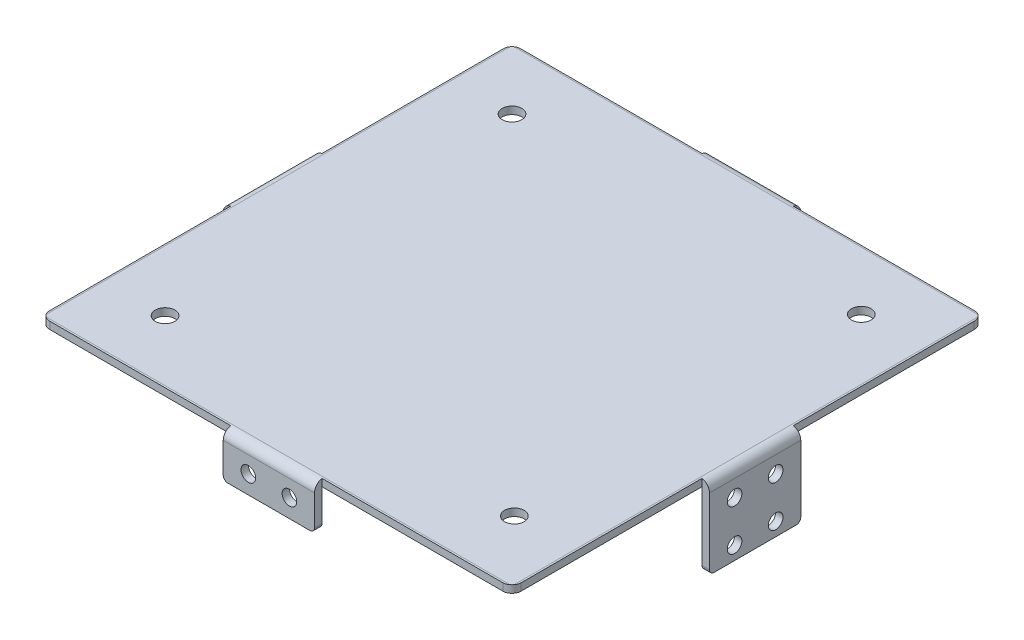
ISO-10303-21;
HEADER;
FILE_DESCRIPTION(('STEP AP214'),'2;1');
FILE_NAME('part.step','',(''),(''),'','','');
FILE_SCHEMA(('AUTOMOTIVE_DESIGN { 1 0 10303 214 1 1 1 1 }'));
ENDSEC;
DATA;
#1=APPLICATION_CONTEXT('core data for automotive mechanical design processes');
#2=APPLICATION_PROTOCOL_DEFINITION('international standard','automotive_design',2000,#1);
#3=PRODUCT_CONTEXT('',#1,'mechanical');
#4=PRODUCT('Part','Part','',(#3));
#5=PRODUCT_RELATED_PRODUCT_CATEGORY('part','',(#4));
#6=PRODUCT_DEFINITION_FORMATION('','',#4);
#7=PRODUCT_DEFINITION_CONTEXT('part definition',#1,'design');
#8=PRODUCT_DEFINITION('design','',#6,#7);
#9=PRODUCT_DEFINITION_SHAPE('','',#8);
#10=(LENGTH_UNIT() NAMED_UNIT(*) SI_UNIT(.MILLI.,.METRE.));
#11=(NAMED_UNIT(*) PLANE_ANGLE_UNIT() SI_UNIT($,.RADIAN.));
#12=(NAMED_UNIT(*) SI_UNIT($,.STERADIAN.) SOLID_ANGLE_UNIT());
#13=UNCERTAINTY_MEASURE_WITH_UNIT(LENGTH_MEASURE(1.E-05),#10,'distance_accuracy_value','');
#14=(GEOMETRIC_REPRESENTATION_CONTEXT(3) GLOBAL_UNCERTAINTY_ASSIGNED_CONTEXT((#13)) GLOBAL_UNIT_ASSIGNED_CONTEXT((#10,
#11,#12)) REPRESENTATION_CONTEXT('',''));
#15=CARTESIAN_POINT('',(0.,0.,0.));
#16=DIRECTION('',(0.,0.,1.));
#17=DIRECTION('',(1.,0.,0.));
#18=AXIS2_PLACEMENT_3D('',#15,#16,#17);
#19=CARTESIAN_POINT('',(0.,0.,0.));
#20=DIRECTION('',(0.,1.,0.));
#21=DIRECTION('',(0.,0.,1.));
#22=AXIS2_PLACEMENT_3D('',#19,#20,#21);
#23=PLANE('',#22);
#24=CARTESIAN_POINT('',(38.2600000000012,0.,37.7399999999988));
#25=DIRECTION('',(0.,1.,0.));
#26=DIRECTION('',(0.,0.,1.));
#27=AXIS2_PLACEMENT_3D('',#24,#25,#26);
#28=CIRCLE('',#27,6.00000000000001);
#29=CARTESIAN_POINT('',(38.2600000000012,0.,43.7399999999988));
#30=VERTEX_POINT('',#29);
#31=EDGE_CURVE('E53',#30,#30,#28,.F.);
#32=ORIENTED_EDGE('',*,*,#31,.F.);
#33=EDGE_LOOP('',(#32));
#34=FACE_BOUND('',#33,.T.);
#35=CARTESIAN_POINT('',(-38.26,0.,-38.26));
#36=DIRECTION('',(0.,1.,0.));
#37=DIRECTION('',(0.,0.,1.));
#38=AXIS2_PLACEMENT_3D('',#35,#36,#37);
#39=CIRCLE('',#38,6.00000000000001);
#40=CARTESIAN_POINT('',(-38.26,0.,-32.26));
#41=VERTEX_POINT('',#40);
#42=EDGE_CURVE('E598',#41,#41,#39,.F.);
#43=ORIENTED_EDGE('',*,*,#42,.F.);
#44=EDGE_LOOP('',(#43));
#45=FACE_BOUND('',#44,.T.);
#46=DIRECTION('',(1.,0.,0.));
#47=VECTOR('',#46,1.);
#48=CARTESIAN_POINT('',(-51.63,0.,-51.63));
#49=LINE('',#48,#47);
#50=CARTESIAN_POINT('',(9.99999999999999,0.,-51.63));
#51=VERTEX_POINT('',#50);
#52=CARTESIAN_POINT('',(49.63,0.,-51.63));
#53=VERTEX_POINT('',#52);
#54=EDGE_CURVE('E352',#51,#53,#49,.T.);
#55=ORIENTED_EDGE('',*,*,#54,.T.);
#56=CARTESIAN_POINT('',(49.63,0.,-49.63));
#57=DIRECTION('',(0.,1.,0.));
#58=DIRECTION('',(0.,0.,1.));
#59=AXIS2_PLACEMENT_3D('',#56,#57,#58);
#60=CIRCLE('',#59,2.);
#61=CARTESIAN_POINT('',(51.63,0.,-49.63));
#62=VERTEX_POINT('',#61);
#63=EDGE_CURVE('E346',#53,#62,#60,.F.);
#64=ORIENTED_EDGE('',*,*,#63,.T.);
#65=DIRECTION('',(0.,0.,-1.));
#66=VECTOR('',#65,1.);
#67=CARTESIAN_POINT('',(51.63,0.,51.63));
#68=LINE('',#67,#66);
#69=CARTESIAN_POINT('',(51.63,0.,-9.99999999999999));
#70=VERTEX_POINT('',#69);
#71=EDGE_CURVE('E333',#70,#62,#68,.T.);
#72=ORIENTED_EDGE('',*,*,#71,.F.);
#73=CARTESIAN_POINT('',(51.63,0.,10.));
#74=VERTEX_POINT('',#73);
#75=EDGE_CURVE('E322',#74,#70,#68,.T.);
#76=ORIENTED_EDGE('',*,*,#75,.F.);
#77=CARTESIAN_POINT('',(51.63,0.,49.63));
#78=VERTEX_POINT('',#77);
#79=EDGE_CURVE('E332',#78,#74,#68,.T.);
#80=ORIENTED_EDGE('',*,*,#79,.F.);
#81=CARTESIAN_POINT('',(49.63,0.,49.63));
#82=DIRECTION('',(0.,1.,0.));
#83=DIRECTION('',(0.,0.,1.));
#84=AXIS2_PLACEMENT_3D('',#81,#82,#83);
#85=CIRCLE('',#84,2.);
#86=CARTESIAN_POINT('',(49.63,0.,51.63));
#87=VERTEX_POINT('',#86);
#88=EDGE_CURVE('E511',#78,#87,#85,.F.);
#89=ORIENTED_EDGE('',*,*,#88,.T.);
#90=DIRECTION('',(1.,0.,0.));
#91=VECTOR('',#90,1.);
#92=CARTESIAN_POINT('',(-51.63,0.,51.63));
#93=LINE('',#92,#91);
#94=CARTESIAN_POINT('',(9.99999999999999,0.,51.63));
#95=VERTEX_POINT('',#94);
#96=EDGE_CURVE('E355',#95,#87,#93,.T.);
#97=ORIENTED_EDGE('',*,*,#96,.F.);
#98=CARTESIAN_POINT('',(-10.,0.,51.63));
#99=VERTEX_POINT('',#98);
#100=EDGE_CURVE('E361',#99,#95,#93,.T.);
#101=ORIENTED_EDGE('',*,*,#100,.F.);
#102=CARTESIAN_POINT('',(-49.63,0.,51.63));
#103=VERTEX_POINT('',#102);
#104=EDGE_CURVE('E362',#103,#99,#93,.T.);
#105=ORIENTED_EDGE('',*,*,#104,.F.);
#106=CARTESIAN_POINT('',(-49.63,0.,49.63));
#107=DIRECTION('',(0.,1.,0.));
#108=DIRECTION('',(0.,0.,1.));
#109=AXIS2_PLACEMENT_3D('',#106,#107,#108);
#110=CIRCLE('',#109,2.);
#111=CARTESIAN_POINT('',(-51.63,0.,49.63));
#112=VERTEX_POINT('',#111);
#113=EDGE_CURVE('E508',#103,#112,#110,.F.);
#114=ORIENTED_EDGE('',*,*,#113,.T.);
#115=DIRECTION('',(0.,0.,-1.));
#116=VECTOR('',#115,1.);
#117=CARTESIAN_POINT('',(-51.63,0.,51.63));
#118=LINE('',#117,#116);
#119=CARTESIAN_POINT('',(-51.63,0.,10.));
#120=VERTEX_POINT('',#119);
#121=EDGE_CURVE('E380',#112,#120,#118,.T.);
#122=ORIENTED_EDGE('',*,*,#121,.T.);
#123=CARTESIAN_POINT('',(-51.63,0.,-9.99999999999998));
#124=VERTEX_POINT('',#123);
#125=EDGE_CURVE('E379',#120,#124,#118,.T.);
#126=ORIENTED_EDGE('',*,*,#125,.T.);
#127=CARTESIAN_POINT('',(-51.63,0.,-49.63));
#128=VERTEX_POINT('',#127);
#129=EDGE_CURVE('E371',#124,#128,#118,.T.);
#130=ORIENTED_EDGE('',*,*,#129,.T.);
#131=CARTESIAN_POINT('',(-49.63,0.,-49.63));
#132=DIRECTION('',(0.,1.,0.));
#133=DIRECTION('',(0.,0.,1.));
#134=AXIS2_PLACEMENT_3D('',#131,#132,#133);
#135=CIRCLE('',#134,2.);
#136=CARTESIAN_POINT('',(-49.63,0.,-51.63));
#137=VERTEX_POINT('',#136);
#138=EDGE_CURVE('E505',#128,#137,#135,.F.);
#139=ORIENTED_EDGE('',*,*,#138,.T.);
#140=CARTESIAN_POINT('',(-10.,0.,-51.63));
#141=VERTEX_POINT('',#140);
#142=EDGE_CURVE('E348',#137,#141,#49,.T.);
#143=ORIENTED_EDGE('',*,*,#142,.T.);
#144=EDGE_CURVE('E350',#141,#51,#49,.T.);
#145=ORIENTED_EDGE('',*,*,#144,.T.);
#146=EDGE_LOOP('',(#55,#64,#72,#76,#80,#89,#97,#101,#105,#114,#122,#126,#130,#139,#143,#145));
#147=FACE_BOUND('',#146,.T.);
#148=CARTESIAN_POINT('',(38.,0.,-38.5200000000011));
#149=DIRECTION('',(0.,1.,0.));
#150=DIRECTION('',(0.,0.,1.));
#151=AXIS2_PLACEMENT_3D('',#148,#149,#150);
#152=CIRCLE('',#151,5.99999999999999);
#153=CARTESIAN_POINT('',(38.,0.,-32.5200000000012));
#154=VERTEX_POINT('',#153);
#155=EDGE_CURVE('E622',#154,#154,#152,.F.);
#156=ORIENTED_EDGE('',*,*,#155,.F.);
#157=EDGE_LOOP('',(#156));
#158=FACE_BOUND('',#157,.T.);
#159=CARTESIAN_POINT('',(-37.9999999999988,0.,38.));
#160=DIRECTION('',(0.,1.,0.));
#161=DIRECTION('',(0.,0.,1.));
#162=AXIS2_PLACEMENT_3D('',#159,#160,#161);
#163=CIRCLE('',#162,6.00000000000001);
#164=CARTESIAN_POINT('',(-37.9999999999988,0.,44.));
#165=VERTEX_POINT('',#164);
#166=EDGE_CURVE('E11',#165,#165,#163,.F.);
#167=ORIENTED_EDGE('',*,*,#166,.F.);
#168=EDGE_LOOP('',(#167));
#169=FACE_BOUND('',#168,.T.);
#170=ADVANCED_FACE('F43',(#34,#45,#147,#158,#169),#23,.F.);
#171=ORIENTED_EDGE('',*,*,#166,.T.);
#172=EDGE_LOOP('',(#171));
#173=FACE_BOUND('',#172,.T.);
#174=CARTESIAN_POINT('',(-37.9999999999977,0.,38.));
#175=DIRECTION('',(0.,1.,0.));
#176=DIRECTION('',(0.,0.,1.));
#177=AXIS2_PLACEMENT_3D('',#174,#175,#176);
#178=CIRCLE('',#177,2.15);
#179=CARTESIAN_POINT('',(-37.9999999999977,0.,40.15));
#180=VERTEX_POINT('',#179);
#181=EDGE_CURVE('E614',#180,#180,#178,.T.);
#182=ORIENTED_EDGE('',*,*,#181,.T.);
#183=EDGE_LOOP('',(#182));
#184=FACE_BOUND('',#183,.T.);
#185=ADVANCED_FACE('F635',(#173,#184),#23,.F.);
#186=ORIENTED_EDGE('',*,*,#31,.T.);
#187=EDGE_LOOP('',(#186));
#188=FACE_BOUND('',#187,.T.);
#189=CARTESIAN_POINT('',(38.2600000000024,0.,37.7399999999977));
#190=DIRECTION('',(0.,1.,0.));
#191=DIRECTION('',(0.,0.,1.));
#192=AXIS2_PLACEMENT_3D('',#189,#190,#191);
#193=CIRCLE('',#192,2.15);
#194=CARTESIAN_POINT('',(38.2600000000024,0.,39.8899999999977));
#195=VERTEX_POINT('',#194);
#196=EDGE_CURVE('E609',#195,#195,#193,.T.);
#197=ORIENTED_EDGE('',*,*,#196,.T.);
#198=EDGE_LOOP('',(#197));
#199=FACE_BOUND('',#198,.T.);
#200=ADVANCED_FACE('F630',(#188,#199),#23,.F.);
#201=ORIENTED_EDGE('',*,*,#155,.T.);
#202=EDGE_LOOP('',(#201));
#203=FACE_BOUND('',#202,.T.);
#204=CARTESIAN_POINT('',(38.0000000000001,0.,-38.5200000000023));
#205=DIRECTION('',(0.,1.,0.));
#206=DIRECTION('',(0.,0.,1.));
#207=AXIS2_PLACEMENT_3D('',#204,#205,#206);
#208=CIRCLE('',#207,2.15);
#209=CARTESIAN_POINT('',(38.0000000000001,0.,-36.3700000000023));
#210=VERTEX_POINT('',#209);
#211=EDGE_CURVE('E604',#210,#210,#208,.T.);
#212=ORIENTED_EDGE('',*,*,#211,.T.);
#213=EDGE_LOOP('',(#212));
#214=FACE_BOUND('',#213,.T.);
#215=ADVANCED_FACE('F643',(#203,#214),#23,.F.);
#216=CARTESIAN_POINT('',(51.63,1.63,51.63));
#217=DIRECTION('',(-1.,0.,0.));
#218=DIRECTION('',(0.,0.,1.));
#219=AXIS2_PLACEMENT_3D('',#216,#217,#218);
#220=PLANE('',#219);
#221=ORIENTED_EDGE('',*,*,#71,.T.);
#222=DIRECTION('',(0.,-1.,0.));
#223=VECTOR('',#222,1.);
#224=CARTESIAN_POINT('',(51.63,1.59547704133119,-49.63));
#225=LINE('',#224,#223);
#226=CARTESIAN_POINT('',(51.63,1.59547704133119,-49.63));
#227=VERTEX_POINT('',#226);
#228=EDGE_CURVE('E516',#62,#227,#225,.F.);
#229=ORIENTED_EDGE('',*,*,#228,.T.);
#230=DIRECTION('',(0.,0.,-1.));
#231=VECTOR('',#230,1.);
#232=CARTESIAN_POINT('',(51.63,1.59547704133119,-51.63));
#233=LINE('',#232,#231);
#234=CARTESIAN_POINT('',(51.63,1.59547704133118,-9.99999999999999));
#235=VERTEX_POINT('',#234);
#236=EDGE_CURVE('E340',#227,#235,#233,.F.);
#237=ORIENTED_EDGE('',*,*,#236,.T.);
#238=DIRECTION('',(0.,1.,0.));
#239=VECTOR('',#238,1.);
#240=CARTESIAN_POINT('',(51.63,-15.95,-9.99999999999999));
#241=LINE('',#240,#239);
#242=EDGE_CURVE('E310',#70,#235,#241,.T.);
#243=ORIENTED_EDGE('',*,*,#242,.F.);
#244=EDGE_LOOP('',(#221,#229,#237,#243));
#245=FACE_BOUND('',#244,.T.);
#246=ADVANCED_FACE('F337',(#245),#220,.F.);
#247=CARTESIAN_POINT('',(-51.63,1.63,51.63));
#248=DIRECTION('',(-1.,0.,0.));
#249=DIRECTION('',(0.,0.,1.));
#250=AXIS2_PLACEMENT_3D('',#247,#248,#249);
#251=PLANE('',#250);
#252=DIRECTION('',(0.,0.,1.));
#253=VECTOR('',#252,1.);
#254=CARTESIAN_POINT('',(-51.63,1.59547704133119,-9.99999999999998));
#255=LINE('',#254,#253);
#256=CARTESIAN_POINT('',(-51.63,1.59547704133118,-9.99999999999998));
#257=VERTEX_POINT('',#256);
#258=CARTESIAN_POINT('',(-51.63,1.59547704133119,-49.63));
#259=VERTEX_POINT('',#258);
#260=EDGE_CURVE('E498',#257,#259,#255,.F.);
#261=ORIENTED_EDGE('',*,*,#260,.T.);
#262=DIRECTION('',(0.,-1.,0.));
#263=VECTOR('',#262,1.);
#264=CARTESIAN_POINT('',(-51.63,1.63,-49.63));
#265=LINE('',#264,#263);
#266=EDGE_CURVE('E591',#259,#128,#265,.T.);
#267=ORIENTED_EDGE('',*,*,#266,.T.);
#268=ORIENTED_EDGE('',*,*,#129,.F.);
#269=DIRECTION('',(0.,1.,0.));
#270=VECTOR('',#269,1.);
#271=CARTESIAN_POINT('',(-51.63,-15.95,-9.99999999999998));
#272=LINE('',#271,#270);
#273=EDGE_CURVE('E939',#124,#257,#272,.T.);
#274=ORIENTED_EDGE('',*,*,#273,.T.);
#275=EDGE_LOOP('',(#261,#267,#268,#274));
#276=FACE_BOUND('',#275,.T.);
#277=ADVANCED_FACE('F776',(#276),#251,.T.);
#278=CARTESIAN_POINT('',(-51.63,1.63,51.63));
#279=DIRECTION('',(0.,0.,-1.));
#280=DIRECTION('',(-1.,0.,0.));
#281=AXIS2_PLACEMENT_3D('',#278,#279,#280);
#282=PLANE('',#281);
#283=ORIENTED_EDGE('',*,*,#96,.T.);
#284=DIRECTION('',(0.,-1.,0.));
#285=VECTOR('',#284,1.);
#286=CARTESIAN_POINT('',(49.63,1.63,51.63));
#287=LINE('',#286,#285);
#288=CARTESIAN_POINT('',(49.63,1.59547704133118,51.63));
#289=VERTEX_POINT('',#288);
#290=EDGE_CURVE('E888',#87,#289,#287,.F.);
#291=ORIENTED_EDGE('',*,*,#290,.T.);
#292=DIRECTION('',(1.,0.,0.));
#293=VECTOR('',#292,1.);
#294=CARTESIAN_POINT('',(51.63,1.59547704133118,51.63));
#295=LINE('',#294,#293);
#296=CARTESIAN_POINT('',(9.99999999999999,1.59547704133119,51.63));
#297=VERTEX_POINT('',#296);
#298=EDGE_CURVE('E470',#289,#297,#295,.F.);
#299=ORIENTED_EDGE('',*,*,#298,.T.);
#300=DIRECTION('',(0.,1.,0.));
#301=VECTOR('',#300,1.);
#302=CARTESIAN_POINT('',(9.99999999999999,-8.,51.63));
#303=LINE('',#302,#301);
#304=EDGE_CURVE('E955',#95,#297,#303,.T.);
#305=ORIENTED_EDGE('',*,*,#304,.F.);
#306=EDGE_LOOP('',(#283,#291,#299,#305));
#307=FACE_BOUND('',#306,.T.);
#308=ADVANCED_FACE('F779',(#307),#282,.F.);
#309=CARTESIAN_POINT('',(-51.63,1.63,-51.63));
#310=DIRECTION('',(0.,0.,-1.));
#311=DIRECTION('',(-1.,0.,0.));
#312=AXIS2_PLACEMENT_3D('',#309,#310,#311);
#313=PLANE('',#312);
#314=DIRECTION('',(-1.,0.,0.));
#315=VECTOR('',#314,1.);
#316=CARTESIAN_POINT('',(9.99999999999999,1.59547704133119,-51.63));
#317=LINE('',#316,#315);
#318=CARTESIAN_POINT('',(9.99999999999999,1.59547704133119,-51.63));
#319=VERTEX_POINT('',#318);
#320=CARTESIAN_POINT('',(49.63,1.59547704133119,-51.63));
#321=VERTEX_POINT('',#320);
#322=EDGE_CURVE('E467',#319,#321,#317,.F.);
#323=ORIENTED_EDGE('',*,*,#322,.T.);
#324=DIRECTION('',(0.,-1.,0.));
#325=VECTOR('',#324,1.);
#326=CARTESIAN_POINT('',(49.63,0.,-51.63));
#327=LINE('',#326,#325);
#328=EDGE_CURVE('E501',#321,#53,#327,.T.);
#329=ORIENTED_EDGE('',*,*,#328,.T.);
#330=ORIENTED_EDGE('',*,*,#54,.F.);
#331=DIRECTION('',(0.,1.,0.));
#332=VECTOR('',#331,1.);
#333=CARTESIAN_POINT('',(9.99999999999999,-8.,-51.63));
#334=LINE('',#333,#332);
#335=EDGE_CURVE('E386',#51,#319,#334,.T.);
#336=ORIENTED_EDGE('',*,*,#335,.T.);
#337=EDGE_LOOP('',(#323,#329,#330,#336));
#338=FACE_BOUND('',#337,.T.);
#339=ADVANCED_FACE('F784',(#338),#313,.T.);
#340=ORIENTED_EDGE('',*,*,#142,.F.);
#341=DIRECTION('',(0.,-1.,0.));
#342=VECTOR('',#341,1.);
#343=CARTESIAN_POINT('',(-49.63,1.63,-51.63));
#344=LINE('',#343,#342);
#345=CARTESIAN_POINT('',(-49.63,1.59547704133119,-51.63));
#346=VERTEX_POINT('',#345);
#347=EDGE_CURVE('E595',#137,#346,#344,.F.);
#348=ORIENTED_EDGE('',*,*,#347,.T.);
#349=DIRECTION('',(-1.,0.,0.));
#350=VECTOR('',#349,1.);
#351=CARTESIAN_POINT('',(-51.63,1.59547704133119,-51.63));
#352=LINE('',#351,#350);
#353=CARTESIAN_POINT('',(-10.,1.59547704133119,-51.63));
#354=VERTEX_POINT('',#353);
#355=EDGE_CURVE('E445',#346,#354,#352,.F.);
#356=ORIENTED_EDGE('',*,*,#355,.T.);
#357=DIRECTION('',(0.,1.,0.));
#358=VECTOR('',#357,1.);
#359=CARTESIAN_POINT('',(-10.,-8.,-51.63));
#360=LINE('',#359,#358);
#361=EDGE_CURVE('E390',#141,#354,#360,.T.);
#362=ORIENTED_EDGE('',*,*,#361,.F.);
#363=EDGE_LOOP('',(#340,#348,#356,#362));
#364=FACE_BOUND('',#363,.T.);
#365=ADVANCED_FACE('F442',(#364),#313,.T.);
#366=ORIENTED_EDGE('',*,*,#121,.F.);
#367=DIRECTION('',(0.,-1.,0.));
#368=VECTOR('',#367,1.);
#369=CARTESIAN_POINT('',(-51.63,1.59547704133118,49.63));
#370=LINE('',#369,#368);
#371=CARTESIAN_POINT('',(-51.63,1.59547704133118,49.63));
#372=VERTEX_POINT('',#371);
#373=EDGE_CURVE('E68',#112,#372,#370,.F.);
#374=ORIENTED_EDGE('',*,*,#373,.T.);
#375=DIRECTION('',(0.,0.,1.));
#376=VECTOR('',#375,1.);
#377=CARTESIAN_POINT('',(-51.63,1.59547704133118,51.63));
#378=LINE('',#377,#376);
#379=CARTESIAN_POINT('',(-51.63,1.59547704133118,10.));
#380=VERTEX_POINT('',#379);
#381=EDGE_CURVE('E486',#372,#380,#378,.F.);
#382=ORIENTED_EDGE('',*,*,#381,.T.);
#383=DIRECTION('',(0.,1.,0.));
#384=VECTOR('',#383,1.);
#385=CARTESIAN_POINT('',(-51.63,-15.95,10.));
#386=LINE('',#385,#384);
#387=EDGE_CURVE('E962',#120,#380,#386,.T.);
#388=ORIENTED_EDGE('',*,*,#387,.F.);
#389=EDGE_LOOP('',(#366,#374,#382,#388));
#390=FACE_BOUND('',#389,.T.);
#391=ADVANCED_FACE('F772',(#390),#251,.T.);
#392=DIRECTION('',(1.,0.,0.));
#393=VECTOR('',#392,1.);
#394=CARTESIAN_POINT('',(-10.,1.59547704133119,51.63));
#395=LINE('',#394,#393);
#396=CARTESIAN_POINT('',(-10.,1.59547704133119,51.63));
#397=VERTEX_POINT('',#396);
#398=CARTESIAN_POINT('',(-49.63,1.59547704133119,51.63));
#399=VERTEX_POINT('',#398);
#400=EDGE_CURVE('E482',#397,#399,#395,.F.);
#401=ORIENTED_EDGE('',*,*,#400,.T.);
#402=DIRECTION('',(0.,-1.,0.));
#403=VECTOR('',#402,1.);
#404=CARTESIAN_POINT('',(-49.63,0.,51.63));
#405=LINE('',#404,#403);
#406=EDGE_CURVE('E559',#399,#103,#405,.T.);
#407=ORIENTED_EDGE('',*,*,#406,.T.);
#408=ORIENTED_EDGE('',*,*,#104,.T.);
#409=DIRECTION('',(0.,1.,0.));
#410=VECTOR('',#409,1.);
#411=CARTESIAN_POINT('',(-10.,-8.,51.63));
#412=LINE('',#411,#410);
#413=EDGE_CURVE('E400',#99,#397,#412,.T.);
#414=ORIENTED_EDGE('',*,*,#413,.T.);
#415=EDGE_LOOP('',(#401,#407,#408,#414));
#416=FACE_BOUND('',#415,.T.);
#417=ADVANCED_FACE('F775',(#416),#282,.F.);
#418=DIRECTION('',(0.,0.,-1.));
#419=VECTOR('',#418,1.);
#420=CARTESIAN_POINT('',(51.63,1.59547704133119,10.));
#421=LINE('',#420,#419);
#422=CARTESIAN_POINT('',(51.63,1.59547704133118,10.));
#423=VERTEX_POINT('',#422);
#424=CARTESIAN_POINT('',(51.63,1.59547704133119,49.63));
#425=VERTEX_POINT('',#424);
#426=EDGE_CURVE('E461',#423,#425,#421,.F.);
#427=ORIENTED_EDGE('',*,*,#426,.T.);
#428=DIRECTION('',(0.,-1.,0.));
#429=VECTOR('',#428,1.);
#430=CARTESIAN_POINT('',(51.63,1.63,49.63));
#431=LINE('',#430,#429);
#432=EDGE_CURVE('E882',#425,#78,#431,.T.);
#433=ORIENTED_EDGE('',*,*,#432,.T.);
#434=ORIENTED_EDGE('',*,*,#79,.T.);
#435=DIRECTION('',(0.,1.,0.));
#436=VECTOR('',#435,1.);
#437=CARTESIAN_POINT('',(51.63,-15.95,10.));
#438=LINE('',#437,#436);
#439=EDGE_CURVE('E343',#74,#423,#438,.T.);
#440=ORIENTED_EDGE('',*,*,#439,.T.);
#441=EDGE_LOOP('',(#427,#433,#434,#440));
#442=FACE_BOUND('',#441,.T.);
#443=ADVANCED_FACE('F769',(#442),#220,.F.);
#444=CARTESIAN_POINT('',(0.,1.63,0.));
#445=DIRECTION('',(0.,1.,0.));
#446=DIRECTION('',(0.,0.,1.));
#447=AXIS2_PLACEMENT_3D('',#444,#445,#446);
#448=PLANE('',#447);
#449=CARTESIAN_POINT('',(-37.9999999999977,1.63,38.));
#450=DIRECTION('',(0.,1.,0.));
#451=DIRECTION('',(0.,0.,1.));
#452=AXIS2_PLACEMENT_3D('',#449,#450,#451);
#453=CIRCLE('',#452,2.15);
#454=CARTESIAN_POINT('',(-37.9999999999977,1.63,40.15));
#455=VERTEX_POINT('',#454);
#456=EDGE_CURVE('E618',#455,#455,#453,.T.);
#457=ORIENTED_EDGE('',*,*,#456,.F.);
#458=EDGE_LOOP('',(#457));
#459=FACE_BOUND('',#458,.T.);
#460=CARTESIAN_POINT('',(38.2600000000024,1.63,37.7399999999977));
#461=DIRECTION('',(0.,1.,0.));
#462=DIRECTION('',(0.,0.,1.));
#463=AXIS2_PLACEMENT_3D('',#460,#461,#462);
#464=CIRCLE('',#463,2.15);
#465=CARTESIAN_POINT('',(38.2600000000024,1.63,39.8899999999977));
#466=VERTEX_POINT('',#465);
#467=EDGE_CURVE('E613',#466,#466,#464,.T.);
#468=ORIENTED_EDGE('',*,*,#467,.F.);
#469=EDGE_LOOP('',(#468));
#470=FACE_BOUND('',#469,.T.);
#471=CARTESIAN_POINT('',(38.0000000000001,1.63,-38.5200000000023));
#472=DIRECTION('',(0.,1.,0.));
#473=DIRECTION('',(0.,0.,1.));
#474=AXIS2_PLACEMENT_3D('',#471,#472,#473);
#475=CIRCLE('',#474,2.15);
#476=CARTESIAN_POINT('',(38.0000000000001,1.63,-36.3700000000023));
#477=VERTEX_POINT('',#476);
#478=EDGE_CURVE('E608',#477,#477,#475,.T.);
#479=ORIENTED_EDGE('',*,*,#478,.F.);
#480=EDGE_LOOP('',(#479));
#481=FACE_BOUND('',#480,.T.);
#482=CARTESIAN_POINT('',(-38.26,1.63,-38.26));
#483=DIRECTION('',(0.,1.,0.));
#484=DIRECTION('',(0.,0.,1.));
#485=AXIS2_PLACEMENT_3D('',#482,#483,#484);
#486=CIRCLE('',#485,2.15);
#487=CARTESIAN_POINT('',(-38.26,1.63,-36.11));
#488=VERTEX_POINT('',#487);
#489=EDGE_CURVE('E603',#488,#488,#486,.T.);
#490=ORIENTED_EDGE('',*,*,#489,.F.);
#491=EDGE_LOOP('',(#490));
#492=FACE_BOUND('',#491,.T.);
#493=DIRECTION('',(0.,0.,-1.));
#494=VECTOR('',#493,1.);
#495=CARTESIAN_POINT('',(51.26,1.63,0.));
#496=LINE('',#495,#494);
#497=CARTESIAN_POINT('',(51.26,1.63,50.7889219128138));
#498=VERTEX_POINT('',#497);
#499=CARTESIAN_POINT('',(51.26,1.63,-50.7889219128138));
#500=VERTEX_POINT('',#499);
#501=EDGE_CURVE('E863',#498,#500,#496,.T.);
#502=ORIENTED_EDGE('',*,*,#501,.T.);
#503=CARTESIAN_POINT('',(49.63,1.63,-49.63));
#504=DIRECTION('',(0.,1.,0.));
#505=DIRECTION('',(0.,0.,1.));
#506=AXIS2_PLACEMENT_3D('',#503,#504,#505);
#507=CIRCLE('',#506,2.);
#508=CARTESIAN_POINT('',(50.7889219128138,1.63,-51.26));
#509=VERTEX_POINT('',#508);
#510=EDGE_CURVE('E906',#500,#509,#507,.T.);
#511=ORIENTED_EDGE('',*,*,#510,.T.);
#512=DIRECTION('',(-1.,0.,0.));
#513=VECTOR('',#512,1.);
#514=CARTESIAN_POINT('',(0.,1.63,-51.26));
#515=LINE('',#514,#513);
#516=CARTESIAN_POINT('',(-50.7889219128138,1.63,-51.26));
#517=VERTEX_POINT('',#516);
#518=EDGE_CURVE('E859',#509,#517,#515,.T.);
#519=ORIENTED_EDGE('',*,*,#518,.T.);
#520=CARTESIAN_POINT('',(-49.63,1.63,-49.63));
#521=DIRECTION('',(0.,1.,0.));
#522=DIRECTION('',(0.,0.,1.));
#523=AXIS2_PLACEMENT_3D('',#520,#521,#522);
#524=CIRCLE('',#523,2.);
#525=CARTESIAN_POINT('',(-51.26,1.63,-50.7889219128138));
#526=VERTEX_POINT('',#525);
#527=EDGE_CURVE('E914',#517,#526,#524,.T.);
#528=ORIENTED_EDGE('',*,*,#527,.T.);
#529=DIRECTION('',(0.,0.,1.));
#530=VECTOR('',#529,1.);
#531=CARTESIAN_POINT('',(-51.26,1.63,0.));
#532=LINE('',#531,#530);
#533=CARTESIAN_POINT('',(-51.26,1.63,50.7889219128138));
#534=VERTEX_POINT('',#533);
#535=EDGE_CURVE('E851',#526,#534,#532,.T.);
#536=ORIENTED_EDGE('',*,*,#535,.T.);
#537=CARTESIAN_POINT('',(-49.63,1.63,49.63));
#538=DIRECTION('',(0.,1.,0.));
#539=DIRECTION('',(0.,0.,1.));
#540=AXIS2_PLACEMENT_3D('',#537,#538,#539);
#541=CIRCLE('',#540,2.);
#542=CARTESIAN_POINT('',(-50.7889219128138,1.63,51.26));
#543=VERTEX_POINT('',#542);
#544=EDGE_CURVE('E912',#534,#543,#541,.T.);
#545=ORIENTED_EDGE('',*,*,#544,.T.);
#546=DIRECTION('',(1.,0.,0.));
#547=VECTOR('',#546,1.);
#548=CARTESIAN_POINT('',(0.,1.63,51.26));
#549=LINE('',#548,#547);
#550=CARTESIAN_POINT('',(50.7889219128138,1.63,51.26));
#551=VERTEX_POINT('',#550);
#552=EDGE_CURVE('E855',#543,#551,#549,.T.);
#553=ORIENTED_EDGE('',*,*,#552,.T.);
#554=CARTESIAN_POINT('',(49.63,1.63,49.63));
#555=DIRECTION('',(0.,1.,0.));
#556=DIRECTION('',(0.,0.,1.));
#557=AXIS2_PLACEMENT_3D('',#554,#555,#556);
#558=CIRCLE('',#557,2.);
#559=EDGE_CURVE('E909',#551,#498,#558,.T.);
#560=ORIENTED_EDGE('',*,*,#559,.T.);
#561=EDGE_LOOP('',(#502,#511,#519,#528,#536,#545,#553,#560));
#562=FACE_BOUND('',#561,.T.);
#563=ADVANCED_FACE('F642',(#459,#470,#481,#492,#562),#448,.T.);
#564=ORIENTED_EDGE('',*,*,#42,.T.);
#565=EDGE_LOOP('',(#564));
#566=FACE_BOUND('',#565,.T.);
#567=CARTESIAN_POINT('',(-38.26,0.,-38.26));
#568=DIRECTION('',(0.,1.,0.));
#569=DIRECTION('',(0.,0.,1.));
#570=AXIS2_PLACEMENT_3D('',#567,#568,#569);
#571=CIRCLE('',#570,2.15);
#572=CARTESIAN_POINT('',(-38.26,0.,-36.11));
#573=VERTEX_POINT('',#572);
#574=EDGE_CURVE('E599',#573,#573,#571,.T.);
#575=ORIENTED_EDGE('',*,*,#574,.T.);
#576=EDGE_LOOP('',(#575));
#577=FACE_BOUND('',#576,.T.);
#578=ADVANCED_FACE('F637',(#566,#577),#23,.F.);
#579=CARTESIAN_POINT('',(-10.,-8.,-51.63));
#580=DIRECTION('',(0.,0.,1.));
#581=DIRECTION('',(1.,0.,0.));
#582=AXIS2_PLACEMENT_3D('',#579,#580,#581);
#583=PLANE('',#582);
#584=CARTESIAN_POINT('',(-4.5,-4.,-51.63));
#585=DIRECTION('',(0.,0.,1.));
#586=DIRECTION('',(1.,0.,0.));
#587=AXIS2_PLACEMENT_3D('',#584,#585,#586);
#588=CIRCLE('',#587,1.6);
#589=CARTESIAN_POINT('',(-2.9,-4.,-51.63));
#590=VERTEX_POINT('',#589);
#591=EDGE_CURVE('E1026',#590,#590,#588,.T.);
#592=ORIENTED_EDGE('',*,*,#591,.F.);
#593=EDGE_LOOP('',(#592));
#594=FACE_BOUND('',#593,.T.);
#595=CARTESIAN_POINT('',(4.5,-4.,-51.63));
#596=DIRECTION('',(0.,0.,1.));
#597=DIRECTION('',(1.,0.,0.));
#598=AXIS2_PLACEMENT_3D('',#595,#596,#597);
#599=CIRCLE('',#598,1.6);
#600=CARTESIAN_POINT('',(6.1,-4.,-51.63));
#601=VERTEX_POINT('',#600);
#602=EDGE_CURVE('E1034',#601,#601,#599,.T.);
#603=ORIENTED_EDGE('',*,*,#602,.F.);
#604=EDGE_LOOP('',(#603));
#605=FACE_BOUND('',#604,.T.);
#606=CARTESIAN_POINT('',(-10.,-7.,-51.63));
#607=VERTEX_POINT('',#606);
#608=EDGE_CURVE('E402',#607,#141,#360,.T.);
#609=ORIENTED_EDGE('',*,*,#608,.F.);
#610=CARTESIAN_POINT('',(-9.00000000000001,-7.,-51.63));
#611=DIRECTION('',(0.,0.,1.));
#612=DIRECTION('',(1.,0.,0.));
#613=AXIS2_PLACEMENT_3D('',#610,#611,#612);
#614=CIRCLE('',#613,1.);
#615=CARTESIAN_POINT('',(-9.00000000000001,-8.,-51.63));
#616=VERTEX_POINT('',#615);
#617=EDGE_CURVE('E1563',#607,#616,#614,.T.);
#618=ORIENTED_EDGE('',*,*,#617,.T.);
#619=DIRECTION('',(1.,0.,0.));
#620=VECTOR('',#619,1.);
#621=CARTESIAN_POINT('',(-10.,-8.,-51.63));
#622=LINE('',#621,#620);
#623=CARTESIAN_POINT('',(8.99999999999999,-8.,-51.63));
#624=VERTEX_POINT('',#623);
#625=EDGE_CURVE('E420',#616,#624,#622,.T.);
#626=ORIENTED_EDGE('',*,*,#625,.T.);
#627=CARTESIAN_POINT('',(8.99999999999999,-7.,-51.63));
#628=DIRECTION('',(0.,0.,1.));
#629=DIRECTION('',(1.,0.,0.));
#630=AXIS2_PLACEMENT_3D('',#627,#628,#629);
#631=CIRCLE('',#630,1.);
#632=CARTESIAN_POINT('',(9.99999999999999,-7.,-51.63));
#633=VERTEX_POINT('',#632);
#634=EDGE_CURVE('E1561',#624,#633,#631,.T.);
#635=ORIENTED_EDGE('',*,*,#634,.T.);
#636=EDGE_CURVE('E392',#633,#51,#334,.T.);
#637=ORIENTED_EDGE('',*,*,#636,.T.);
#638=ORIENTED_EDGE('',*,*,#144,.F.);
#639=EDGE_LOOP('',(#609,#618,#626,#635,#637,#638));
#640=FACE_BOUND('',#639,.T.);
#641=ADVANCED_FACE('F440',(#594,#605,#640),#583,.T.);
#642=CARTESIAN_POINT('',(-10.,-8.,-51.63));
#643=DIRECTION('',(-1.,0.,0.));
#644=DIRECTION('',(0.,0.,1.));
#645=AXIS2_PLACEMENT_3D('',#642,#643,#644);
#646=PLANE('',#645);
#647=ORIENTED_EDGE('',*,*,#361,.T.);
#648=CARTESIAN_POINT('',(-10.,-0.37,-51.26));
#649=DIRECTION('',(-1.,0.,0.));
#650=DIRECTION('',(0.,0.,1.));
#651=AXIS2_PLACEMENT_3D('',#648,#649,#650);
#652=CIRCLE('',#651,2.);
#653=CARTESIAN_POINT('',(-10.,-0.370000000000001,-53.26));
#654=VERTEX_POINT('',#653);
#655=EDGE_CURVE('E448',#354,#654,#652,.T.);
#656=ORIENTED_EDGE('',*,*,#655,.T.);
#657=DIRECTION('',(0.,1.,0.));
#658=VECTOR('',#657,1.);
#659=CARTESIAN_POINT('',(-10.,-8.,-53.26));
#660=LINE('',#659,#658);
#661=CARTESIAN_POINT('',(-10.,-7.,-53.26));
#662=VERTEX_POINT('',#661);
#663=EDGE_CURVE('E412',#662,#654,#660,.T.);
#664=ORIENTED_EDGE('',*,*,#663,.F.);
#665=DIRECTION('',(0.,0.,1.));
#666=VECTOR('',#665,1.);
#667=CARTESIAN_POINT('',(-10.,-7.,-51.63));
#668=LINE('',#667,#666);
#669=EDGE_CURVE('E342',#662,#607,#668,.T.);
#670=ORIENTED_EDGE('',*,*,#669,.T.);
#671=ORIENTED_EDGE('',*,*,#608,.T.);
#672=EDGE_LOOP('',(#647,#656,#664,#670,#671));
#673=FACE_BOUND('',#672,.T.);
#674=ADVANCED_FACE('F447',(#673),#646,.T.);
#675=CARTESIAN_POINT('',(-10.,-8.,-53.26));
#676=DIRECTION('',(0.,0.,-1.));
#677=DIRECTION('',(-1.,0.,0.));
#678=AXIS2_PLACEMENT_3D('',#675,#676,#677);
#679=PLANE('',#678);
#680=CARTESIAN_POINT('',(-4.5,-4.,-53.26));
#681=DIRECTION('',(0.,0.,1.));
#682=DIRECTION('',(1.,0.,0.));
#683=AXIS2_PLACEMENT_3D('',#680,#681,#682);
#684=CIRCLE('',#683,1.6);
#685=CARTESIAN_POINT('',(-2.9,-4.,-53.26));
#686=VERTEX_POINT('',#685);
#687=EDGE_CURVE('E1042',#686,#686,#684,.T.);
#688=ORIENTED_EDGE('',*,*,#687,.T.);
#689=EDGE_LOOP('',(#688));
#690=FACE_BOUND('',#689,.T.);
#691=CARTESIAN_POINT('',(4.5,-4.,-53.26));
#692=DIRECTION('',(0.,0.,1.));
#693=DIRECTION('',(-1.,0.,0.));
#694=AXIS2_PLACEMENT_3D('',#691,#692,#693);
#695=CIRCLE('',#694,1.6);
#696=CARTESIAN_POINT('',(6.1,-4.,-53.26));
#697=VERTEX_POINT('',#696);
#698=EDGE_CURVE('E1047',#697,#697,#695,.T.);
#699=ORIENTED_EDGE('',*,*,#698,.T.);
#700=EDGE_LOOP('',(#699));
#701=FACE_BOUND('',#700,.T.);
#702=ORIENTED_EDGE('',*,*,#663,.T.);
#703=DIRECTION('',(-1.,0.,0.));
#704=VECTOR('',#703,1.);
#705=CARTESIAN_POINT('',(-10.,-0.370000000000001,-53.26));
#706=LINE('',#705,#704);
#707=CARTESIAN_POINT('',(9.99999999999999,-0.370000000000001,-53.26));
#708=VERTEX_POINT('',#707);
#709=EDGE_CURVE('E454',#654,#708,#706,.F.);
#710=ORIENTED_EDGE('',*,*,#709,.T.);
#711=DIRECTION('',(0.,1.,0.));
#712=VECTOR('',#711,1.);
#713=CARTESIAN_POINT('',(9.99999999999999,-8.,-53.26));
#714=LINE('',#713,#712);
#715=CARTESIAN_POINT('',(9.99999999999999,-7.,-53.26));
#716=VERTEX_POINT('',#715);
#717=EDGE_CURVE('E405',#716,#708,#714,.T.);
#718=ORIENTED_EDGE('',*,*,#717,.F.);
#719=CARTESIAN_POINT('',(8.99999999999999,-7.,-53.26));
#720=DIRECTION('',(0.,0.,-1.));
#721=DIRECTION('',(-1.,0.,0.));
#722=AXIS2_PLACEMENT_3D('',#719,#720,#721);
#723=CIRCLE('',#722,1.);
#724=CARTESIAN_POINT('',(8.99999999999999,-8.,-53.26));
#725=VERTEX_POINT('',#724);
#726=EDGE_CURVE('E1572',#716,#725,#723,.T.);
#727=ORIENTED_EDGE('',*,*,#726,.T.);
#728=DIRECTION('',(-1.,0.,0.));
#729=VECTOR('',#728,1.);
#730=CARTESIAN_POINT('',(-10.,-8.,-53.26));
#731=LINE('',#730,#729);
#732=CARTESIAN_POINT('',(-9.00000000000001,-8.,-53.26));
#733=VERTEX_POINT('',#732);
#734=EDGE_CURVE('E414',#725,#733,#731,.T.);
#735=ORIENTED_EDGE('',*,*,#734,.T.);
#736=CARTESIAN_POINT('',(-9.00000000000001,-7.,-53.26));
#737=DIRECTION('',(0.,0.,-1.));
#738=DIRECTION('',(-1.,0.,0.));
#739=AXIS2_PLACEMENT_3D('',#736,#737,#738);
#740=CIRCLE('',#739,1.);
#741=EDGE_CURVE('E1575',#733,#662,#740,.T.);
#742=ORIENTED_EDGE('',*,*,#741,.T.);
#743=EDGE_LOOP('',(#702,#710,#718,#727,#735,#742));
#744=FACE_BOUND('',#743,.T.);
#745=ADVANCED_FACE('F756',(#690,#701,#744),#679,.T.);
#746=CARTESIAN_POINT('',(9.99999999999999,-8.,-51.63));
#747=DIRECTION('',(1.,0.,0.));
#748=DIRECTION('',(0.,0.,-1.));
#749=AXIS2_PLACEMENT_3D('',#746,#747,#748);
#750=PLANE('',#749);
#751=ORIENTED_EDGE('',*,*,#717,.T.);
#752=CARTESIAN_POINT('',(9.99999999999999,-0.37,-51.26));
#753=DIRECTION('',(1.,0.,0.));
#754=DIRECTION('',(0.,0.,-1.));
#755=AXIS2_PLACEMENT_3D('',#752,#753,#754);
#756=CIRCLE('',#755,2.);
#757=EDGE_CURVE('E459',#708,#319,#756,.T.);
#758=ORIENTED_EDGE('',*,*,#757,.T.);
#759=ORIENTED_EDGE('',*,*,#335,.F.);
#760=ORIENTED_EDGE('',*,*,#636,.F.);
#761=DIRECTION('',(0.,0.,-1.));
#762=VECTOR('',#761,1.);
#763=CARTESIAN_POINT('',(9.99999999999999,-7.,-51.63));
#764=LINE('',#763,#762);
#765=EDGE_CURVE('E1578',#633,#716,#764,.T.);
#766=ORIENTED_EDGE('',*,*,#765,.T.);
#767=EDGE_LOOP('',(#751,#758,#759,#760,#766));
#768=FACE_BOUND('',#767,.T.);
#769=ADVANCED_FACE('F754',(#768),#750,.T.);
#770=CARTESIAN_POINT('',(0.,-8.,0.));
#771=DIRECTION('',(0.,-1.,0.));
#772=DIRECTION('',(0.,0.,-1.));
#773=AXIS2_PLACEMENT_3D('',#770,#771,#772);
#774=PLANE('',#773);
#775=ORIENTED_EDGE('',*,*,#625,.F.);
#776=DIRECTION('',(0.,0.,1.));
#777=VECTOR('',#776,1.);
#778=CARTESIAN_POINT('',(-9.00000000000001,-8.,0.));
#779=LINE('',#778,#777);
#780=EDGE_CURVE('E1569',#616,#733,#779,.F.);
#781=ORIENTED_EDGE('',*,*,#780,.T.);
#782=ORIENTED_EDGE('',*,*,#734,.F.);
#783=DIRECTION('',(0.,0.,-1.));
#784=VECTOR('',#783,1.);
#785=CARTESIAN_POINT('',(8.99999999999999,-8.,0.));
#786=LINE('',#785,#784);
#787=EDGE_CURVE('E1566',#725,#624,#786,.F.);
#788=ORIENTED_EDGE('',*,*,#787,.T.);
#789=EDGE_LOOP('',(#775,#781,#782,#788));
#790=FACE_BOUND('',#789,.T.);
#791=ADVANCED_FACE('F750',(#790),#774,.T.);
#792=CARTESIAN_POINT('',(-10.,-8.,51.63));
#793=DIRECTION('',(-1.,0.,0.));
#794=DIRECTION('',(0.,0.,1.));
#795=AXIS2_PLACEMENT_3D('',#792,#793,#794);
#796=PLANE('',#795);
#797=DIRECTION('',(0.,1.,0.));
#798=VECTOR('',#797,1.);
#799=CARTESIAN_POINT('',(-10.,-8.,53.26));
#800=LINE('',#799,#798);
#801=CARTESIAN_POINT('',(-10.,-7.,53.26));
#802=VERTEX_POINT('',#801);
#803=CARTESIAN_POINT('',(-10.,-0.370000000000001,53.26));
#804=VERTEX_POINT('',#803);
#805=EDGE_CURVE('E973',#802,#804,#800,.T.);
#806=ORIENTED_EDGE('',*,*,#805,.T.);
#807=CARTESIAN_POINT('',(-10.,-0.37,51.26));
#808=DIRECTION('',(-1.,0.,0.));
#809=DIRECTION('',(0.,0.,1.));
#810=AXIS2_PLACEMENT_3D('',#807,#808,#809);
#811=CIRCLE('',#810,2.);
#812=EDGE_CURVE('E479',#804,#397,#811,.T.);
#813=ORIENTED_EDGE('',*,*,#812,.T.);
#814=ORIENTED_EDGE('',*,*,#413,.F.);
#815=CARTESIAN_POINT('',(-10.,-7.,51.63));
#816=VERTEX_POINT('',#815);
#817=EDGE_CURVE('E427',#816,#99,#412,.T.);
#818=ORIENTED_EDGE('',*,*,#817,.F.);
#819=DIRECTION('',(0.,0.,1.));
#820=VECTOR('',#819,1.);
#821=CARTESIAN_POINT('',(-10.,-7.,53.26));
#822=LINE('',#821,#820);
#823=EDGE_CURVE('E1603',#816,#802,#822,.T.);
#824=ORIENTED_EDGE('',*,*,#823,.T.);
#825=EDGE_LOOP('',(#806,#813,#814,#818,#824));
#826=FACE_BOUND('',#825,.T.);
#827=ADVANCED_FACE('F740',(#826),#796,.T.);
#828=CARTESIAN_POINT('',(-10.,-8.,51.63));
#829=DIRECTION('',(0.,0.,-1.));
#830=DIRECTION('',(-1.,0.,0.));
#831=AXIS2_PLACEMENT_3D('',#828,#829,#830);
#832=PLANE('',#831);
#833=CARTESIAN_POINT('',(-4.5,-4.,51.63));
#834=DIRECTION('',(0.,0.,-1.));
#835=DIRECTION('',(-1.,0.,0.));
#836=AXIS2_PLACEMENT_3D('',#833,#834,#835);
#837=CIRCLE('',#836,1.6);
#838=CARTESIAN_POINT('',(-2.9,-4.,51.63));
#839=VERTEX_POINT('',#838);
#840=EDGE_CURVE('E1030',#839,#839,#837,.T.);
#841=ORIENTED_EDGE('',*,*,#840,.F.);
#842=EDGE_LOOP('',(#841));
#843=FACE_BOUND('',#842,.T.);
#844=CARTESIAN_POINT('',(4.5,-4.,51.63));
#845=DIRECTION('',(0.,0.,-1.));
#846=DIRECTION('',(-1.,0.,0.));
#847=AXIS2_PLACEMENT_3D('',#844,#845,#846);
#848=CIRCLE('',#847,1.6);
#849=CARTESIAN_POINT('',(6.1,-4.,51.63));
#850=VERTEX_POINT('',#849);
#851=EDGE_CURVE('E1038',#850,#850,#848,.T.);
#852=ORIENTED_EDGE('',*,*,#851,.F.);
#853=EDGE_LOOP('',(#852));
#854=FACE_BOUND('',#853,.T.);
#855=CARTESIAN_POINT('',(9.99999999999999,-7.,51.63));
#856=VERTEX_POINT('',#855);
#857=EDGE_CURVE('E951',#856,#95,#303,.T.);
#858=ORIENTED_EDGE('',*,*,#857,.F.);
#859=CARTESIAN_POINT('',(8.99999999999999,-7.,51.63));
#860=DIRECTION('',(0.,0.,-1.));
#861=DIRECTION('',(-1.,0.,0.));
#862=AXIS2_PLACEMENT_3D('',#859,#860,#861);
#863=CIRCLE('',#862,1.);
#864=CARTESIAN_POINT('',(8.99999999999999,-8.,51.63));
#865=VERTEX_POINT('',#864);
#866=EDGE_CURVE('E1588',#856,#865,#863,.T.);
#867=ORIENTED_EDGE('',*,*,#866,.T.);
#868=DIRECTION('',(-1.,0.,0.));
#869=VECTOR('',#868,1.);
#870=CARTESIAN_POINT('',(-10.,-8.,51.63));
#871=LINE('',#870,#869);
#872=CARTESIAN_POINT('',(-9.00000000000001,-8.,51.63));
#873=VERTEX_POINT('',#872);
#874=EDGE_CURVE('E979',#865,#873,#871,.T.);
#875=ORIENTED_EDGE('',*,*,#874,.T.);
#876=CARTESIAN_POINT('',(-9.00000000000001,-7.,51.63));
#877=DIRECTION('',(0.,0.,-1.));
#878=DIRECTION('',(-1.,0.,0.));
#879=AXIS2_PLACEMENT_3D('',#876,#877,#878);
#880=CIRCLE('',#879,1.);
#881=EDGE_CURVE('E1585',#873,#816,#880,.T.);
#882=ORIENTED_EDGE('',*,*,#881,.T.);
#883=ORIENTED_EDGE('',*,*,#817,.T.);
#884=ORIENTED_EDGE('',*,*,#100,.T.);
#885=EDGE_LOOP('',(#858,#867,#875,#882,#883,#884));
#886=FACE_BOUND('',#885,.T.);
#887=ADVANCED_FACE('F736',(#843,#854,#886),#832,.T.);
#888=CARTESIAN_POINT('',(9.99999999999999,-8.,51.63));
#889=DIRECTION('',(1.,0.,0.));
#890=DIRECTION('',(0.,0.,-1.));
#891=AXIS2_PLACEMENT_3D('',#888,#889,#890);
#892=PLANE('',#891);
#893=ORIENTED_EDGE('',*,*,#304,.T.);
#894=CARTESIAN_POINT('',(9.99999999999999,-0.37,51.26));
#895=DIRECTION('',(1.,0.,0.));
#896=DIRECTION('',(0.,0.,-1.));
#897=AXIS2_PLACEMENT_3D('',#894,#895,#896);
#898=CIRCLE('',#897,2.);
#899=CARTESIAN_POINT('',(9.99999999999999,-0.370000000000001,53.26));
#900=VERTEX_POINT('',#899);
#901=EDGE_CURVE('E473',#297,#900,#898,.T.);
#902=ORIENTED_EDGE('',*,*,#901,.T.);
#903=DIRECTION('',(0.,1.,0.));
#904=VECTOR('',#903,1.);
#905=CARTESIAN_POINT('',(9.99999999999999,-8.,53.26));
#906=LINE('',#905,#904);
#907=CARTESIAN_POINT('',(9.99999999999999,-7.,53.26));
#908=VERTEX_POINT('',#907);
#909=EDGE_CURVE('E968',#908,#900,#906,.T.);
#910=ORIENTED_EDGE('',*,*,#909,.F.);
#911=DIRECTION('',(0.,0.,-1.));
#912=VECTOR('',#911,1.);
#913=CARTESIAN_POINT('',(9.99999999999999,-7.,51.63));
#914=LINE('',#913,#912);
#915=EDGE_CURVE('E1582',#908,#856,#914,.T.);
#916=ORIENTED_EDGE('',*,*,#915,.T.);
#917=ORIENTED_EDGE('',*,*,#857,.T.);
#918=EDGE_LOOP('',(#893,#902,#910,#916,#917));
#919=FACE_BOUND('',#918,.T.);
#920=ADVANCED_FACE('F739',(#919),#892,.T.);
#921=CARTESIAN_POINT('',(-10.,-8.,53.26));
#922=DIRECTION('',(0.,0.,1.));
#923=DIRECTION('',(1.,0.,0.));
#924=AXIS2_PLACEMENT_3D('',#921,#922,#923);
#925=PLANE('',#924);
#926=CARTESIAN_POINT('',(-4.5,-4.,53.26));
#927=DIRECTION('',(0.,0.,1.));
#928=DIRECTION('',(1.,0.,0.));
#929=AXIS2_PLACEMENT_3D('',#926,#927,#928);
#930=CIRCLE('',#929,1.6);
#931=CARTESIAN_POINT('',(-2.9,-4.,53.26));
#932=VERTEX_POINT('',#931);
#933=EDGE_CURVE('E1052',#932,#932,#930,.T.);
#934=ORIENTED_EDGE('',*,*,#933,.F.);
#935=EDGE_LOOP('',(#934));
#936=FACE_BOUND('',#935,.T.);
#937=CARTESIAN_POINT('',(4.5,-4.,53.26));
#938=DIRECTION('',(0.,0.,1.));
#939=DIRECTION('',(-1.,0.,0.));
#940=AXIS2_PLACEMENT_3D('',#937,#938,#939);
#941=CIRCLE('',#940,1.6);
#942=CARTESIAN_POINT('',(6.1,-4.,53.26));
#943=VERTEX_POINT('',#942);
#944=EDGE_CURVE('E1043',#943,#943,#941,.T.);
#945=ORIENTED_EDGE('',*,*,#944,.F.);
#946=EDGE_LOOP('',(#945));
#947=FACE_BOUND('',#946,.T.);
#948=ORIENTED_EDGE('',*,*,#909,.T.);
#949=DIRECTION('',(1.,0.,0.));
#950=VECTOR('',#949,1.);
#951=CARTESIAN_POINT('',(-10.,-0.370000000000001,53.26));
#952=LINE('',#951,#950);
#953=EDGE_CURVE('E476',#900,#804,#952,.F.);
#954=ORIENTED_EDGE('',*,*,#953,.T.);
#955=ORIENTED_EDGE('',*,*,#805,.F.);
#956=CARTESIAN_POINT('',(-9.00000000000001,-7.,53.26));
#957=DIRECTION('',(0.,0.,1.));
#958=DIRECTION('',(1.,0.,0.));
#959=AXIS2_PLACEMENT_3D('',#956,#957,#958);
#960=CIRCLE('',#959,1.);
#961=CARTESIAN_POINT('',(-9.00000000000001,-8.,53.26));
#962=VERTEX_POINT('',#961);
#963=EDGE_CURVE('E1597',#802,#962,#960,.T.);
#964=ORIENTED_EDGE('',*,*,#963,.T.);
#965=DIRECTION('',(1.,0.,0.));
#966=VECTOR('',#965,1.);
#967=CARTESIAN_POINT('',(-10.,-8.,53.26));
#968=LINE('',#967,#966);
#969=CARTESIAN_POINT('',(8.99999999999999,-8.,53.26));
#970=VERTEX_POINT('',#969);
#971=EDGE_CURVE('E985',#962,#970,#968,.T.);
#972=ORIENTED_EDGE('',*,*,#971,.T.);
#973=CARTESIAN_POINT('',(8.99999999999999,-7.,53.26));
#974=DIRECTION('',(0.,0.,1.));
#975=DIRECTION('',(1.,0.,0.));
#976=AXIS2_PLACEMENT_3D('',#973,#974,#975);
#977=CIRCLE('',#976,1.);
#978=EDGE_CURVE('E1600',#970,#908,#977,.T.);
#979=ORIENTED_EDGE('',*,*,#978,.T.);
#980=EDGE_LOOP('',(#948,#954,#955,#964,#972,#979));
#981=FACE_BOUND('',#980,.T.);
#982=ADVANCED_FACE('F734',(#936,#947,#981),#925,.T.);
#983=CARTESIAN_POINT('',(0.,-8.,0.));
#984=DIRECTION('',(0.,1.,0.));
#985=DIRECTION('',(0.,0.,1.));
#986=AXIS2_PLACEMENT_3D('',#983,#984,#985);
#987=PLANE('',#986);
#988=ORIENTED_EDGE('',*,*,#874,.F.);
#989=DIRECTION('',(0.,0.,-1.));
#990=VECTOR('',#989,1.);
#991=CARTESIAN_POINT('',(8.99999999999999,-8.,53.26));
#992=LINE('',#991,#990);
#993=EDGE_CURVE('E1594',#865,#970,#992,.F.);
#994=ORIENTED_EDGE('',*,*,#993,.T.);
#995=ORIENTED_EDGE('',*,*,#971,.F.);
#996=DIRECTION('',(0.,0.,1.));
#997=VECTOR('',#996,1.);
#998=CARTESIAN_POINT('',(-9.00000000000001,-8.,51.63));
#999=LINE('',#998,#997);
#1000=EDGE_CURVE('E1591',#962,#873,#999,.F.);
#1001=ORIENTED_EDGE('',*,*,#1000,.T.);
#1002=EDGE_LOOP('',(#988,#994,#995,#1001));
#1003=FACE_BOUND('',#1002,.T.);
#1004=ADVANCED_FACE('F730',(#1003),#987,.F.);
#1005=CARTESIAN_POINT('',(-51.63,-15.95,10.));
#1006=DIRECTION('',(1.,0.,0.));
#1007=DIRECTION('',(0.,0.,-1.));
#1008=AXIS2_PLACEMENT_3D('',#1005,#1006,#1007);
#1009=PLANE('',#1008);
#1010=CARTESIAN_POINT('',(-51.63,-13.,4.5));
#1011=DIRECTION('',(1.,0.,0.));
#1012=DIRECTION('',(0.,0.,-1.));
#1013=AXIS2_PLACEMENT_3D('',#1010,#1011,#1012);
#1014=CIRCLE('',#1013,1.6);
#1015=CARTESIAN_POINT('',(-51.63,-13.,2.9));
#1016=VERTEX_POINT('',#1015);
#1017=EDGE_CURVE('E1048',#1016,#1016,#1014,.T.);
#1018=ORIENTED_EDGE('',*,*,#1017,.F.);
#1019=EDGE_LOOP('',(#1018));
#1020=FACE_BOUND('',#1019,.T.);
#1021=CARTESIAN_POINT('',(-51.63,-13.,-4.5));
#1022=DIRECTION('',(1.,0.,0.));
#1023=DIRECTION('',(0.,0.,-1.));
#1024=AXIS2_PLACEMENT_3D('',#1021,#1022,#1023);
#1025=CIRCLE('',#1024,1.6);
#1026=CARTESIAN_POINT('',(-51.63,-13.,-6.1));
#1027=VERTEX_POINT('',#1026);
#1028=EDGE_CURVE('E1066',#1027,#1027,#1025,.T.);
#1029=ORIENTED_EDGE('',*,*,#1028,.F.);
#1030=EDGE_LOOP('',(#1029));
#1031=FACE_BOUND('',#1030,.T.);
#1032=CARTESIAN_POINT('',(-51.63,-4.,-4.5));
#1033=DIRECTION('',(1.,0.,0.));
#1034=DIRECTION('',(0.,0.,-1.));
#1035=AXIS2_PLACEMENT_3D('',#1032,#1033,#1034);
#1036=CIRCLE('',#1035,1.6);
#1037=CARTESIAN_POINT('',(-51.63,-4.,-6.1));
#1038=VERTEX_POINT('',#1037);
#1039=EDGE_CURVE('E1074',#1038,#1038,#1036,.T.);
#1040=ORIENTED_EDGE('',*,*,#1039,.F.);
#1041=EDGE_LOOP('',(#1040));
#1042=FACE_BOUND('',#1041,.T.);
#1043=CARTESIAN_POINT('',(-51.63,-4.,4.5));
#1044=DIRECTION('',(1.,0.,0.));
#1045=DIRECTION('',(0.,0.,-1.));
#1046=AXIS2_PLACEMENT_3D('',#1043,#1044,#1045);
#1047=CIRCLE('',#1046,1.6);
#1048=CARTESIAN_POINT('',(-51.63,-4.,2.9));
#1049=VERTEX_POINT('',#1048);
#1050=EDGE_CURVE('E1082',#1049,#1049,#1047,.T.);
#1051=ORIENTED_EDGE('',*,*,#1050,.F.);
#1052=EDGE_LOOP('',(#1051));
#1053=FACE_BOUND('',#1052,.T.);
#1054=DIRECTION('',(0.,0.,-1.));
#1055=VECTOR('',#1054,1.);
#1056=CARTESIAN_POINT('',(-51.63,-15.95,10.));
#1057=LINE('',#1056,#1055);
#1058=CARTESIAN_POINT('',(-51.63,-15.95,9.00000000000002));
#1059=VERTEX_POINT('',#1058);
#1060=CARTESIAN_POINT('',(-51.63,-15.95,-8.99999999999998));
#1061=VERTEX_POINT('',#1060);
#1062=EDGE_CURVE('E317',#1059,#1061,#1057,.T.);
#1063=ORIENTED_EDGE('',*,*,#1062,.T.);
#1064=CARTESIAN_POINT('',(-51.63,-14.95,-8.99999999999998));
#1065=DIRECTION('',(1.,0.,0.));
#1066=DIRECTION('',(0.,0.,-1.));
#1067=AXIS2_PLACEMENT_3D('',#1064,#1065,#1066);
#1068=CIRCLE('',#1067,1.);
#1069=CARTESIAN_POINT('',(-51.63,-14.95,-9.99999999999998));
#1070=VERTEX_POINT('',#1069);
#1071=EDGE_CURVE('E846',#1061,#1070,#1068,.T.);
#1072=ORIENTED_EDGE('',*,*,#1071,.T.);
#1073=EDGE_CURVE('E964',#1070,#124,#272,.T.);
#1074=ORIENTED_EDGE('',*,*,#1073,.T.);
#1075=ORIENTED_EDGE('',*,*,#125,.F.);
#1076=CARTESIAN_POINT('',(-51.63,-14.95,10.));
#1077=VERTEX_POINT('',#1076);
#1078=EDGE_CURVE('E991',#1077,#120,#386,.T.);
#1079=ORIENTED_EDGE('',*,*,#1078,.F.);
#1080=CARTESIAN_POINT('',(-51.63,-14.95,9.00000000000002));
#1081=DIRECTION('',(1.,0.,0.));
#1082=DIRECTION('',(0.,0.,-1.));
#1083=AXIS2_PLACEMENT_3D('',#1080,#1081,#1082);
#1084=CIRCLE('',#1083,1.);
#1085=EDGE_CURVE('E843',#1077,#1059,#1084,.T.);
#1086=ORIENTED_EDGE('',*,*,#1085,.T.);
#1087=EDGE_LOOP('',(#1063,#1072,#1074,#1075,#1079,#1086));
#1088=FACE_BOUND('',#1087,.T.);
#1089=ADVANCED_FACE('F720',(#1020,#1031,#1042,#1053,#1088),#1009,.T.);
#1090=CARTESIAN_POINT('',(-51.63,-15.95,10.));
#1091=DIRECTION('',(0.,0.,1.));
#1092=DIRECTION('',(1.,0.,0.));
#1093=AXIS2_PLACEMENT_3D('',#1090,#1091,#1092);
#1094=PLANE('',#1093);
#1095=ORIENTED_EDGE('',*,*,#387,.T.);
#1096=CARTESIAN_POINT('',(-51.26,-0.37,10.));
#1097=DIRECTION('',(0.,0.,1.));
#1098=DIRECTION('',(1.,0.,0.));
#1099=AXIS2_PLACEMENT_3D('',#1096,#1097,#1098);
#1100=CIRCLE('',#1099,2.);
#1101=CARTESIAN_POINT('',(-53.26,-0.370000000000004,10.));
#1102=VERTEX_POINT('',#1101);
#1103=EDGE_CURVE('E489',#380,#1102,#1100,.T.);
#1104=ORIENTED_EDGE('',*,*,#1103,.T.);
#1105=DIRECTION('',(0.,1.,0.));
#1106=VECTOR('',#1105,1.);
#1107=CARTESIAN_POINT('',(-53.26,-15.95,10.));
#1108=LINE('',#1107,#1106);
#1109=CARTESIAN_POINT('',(-53.26,-14.95,10.));
#1110=VERTEX_POINT('',#1109);
#1111=EDGE_CURVE('E1000',#1110,#1102,#1108,.T.);
#1112=ORIENTED_EDGE('',*,*,#1111,.F.);
#1113=DIRECTION('',(1.,0.,0.));
#1114=VECTOR('',#1113,1.);
#1115=CARTESIAN_POINT('',(-51.63,-14.95,10.));
#1116=LINE('',#1115,#1114);
#1117=EDGE_CURVE('E822',#1110,#1077,#1116,.T.);
#1118=ORIENTED_EDGE('',*,*,#1117,.T.);
#1119=ORIENTED_EDGE('',*,*,#1078,.T.);
#1120=EDGE_LOOP('',(#1095,#1104,#1112,#1118,#1119));
#1121=FACE_BOUND('',#1120,.T.);
#1122=ADVANCED_FACE('F716',(#1121),#1094,.T.);
#1123=CARTESIAN_POINT('',(-53.26,-15.95,10.));
#1124=DIRECTION('',(-1.,0.,0.));
#1125=DIRECTION('',(0.,0.,1.));
#1126=AXIS2_PLACEMENT_3D('',#1123,#1124,#1125);
#1127=PLANE('',#1126);
#1128=CARTESIAN_POINT('',(-53.26,-13.,4.5));
#1129=DIRECTION('',(1.,0.,0.));
#1130=DIRECTION('',(0.,0.,1.));
#1131=AXIS2_PLACEMENT_3D('',#1128,#1129,#1130);
#1132=CIRCLE('',#1131,1.6);
#1133=CARTESIAN_POINT('',(-53.26,-13.,6.1));
#1134=VERTEX_POINT('',#1133);
#1135=EDGE_CURVE('E1103',#1134,#1134,#1132,.T.);
#1136=ORIENTED_EDGE('',*,*,#1135,.T.);
#1137=EDGE_LOOP('',(#1136));
#1138=FACE_BOUND('',#1137,.T.);
#1139=CARTESIAN_POINT('',(-53.26,-13.,-4.5));
#1140=DIRECTION('',(1.,0.,0.));
#1141=DIRECTION('',(0.,0.,-1.));
#1142=AXIS2_PLACEMENT_3D('',#1139,#1140,#1141);
#1143=CIRCLE('',#1142,1.6);
#1144=CARTESIAN_POINT('',(-53.26,-13.,-6.1));
#1145=VERTEX_POINT('',#1144);
#1146=EDGE_CURVE('E1111',#1145,#1145,#1143,.T.);
#1147=ORIENTED_EDGE('',*,*,#1146,.T.);
#1148=EDGE_LOOP('',(#1147));
#1149=FACE_BOUND('',#1148,.T.);
#1150=CARTESIAN_POINT('',(-53.26,-4.,-4.5));
#1151=DIRECTION('',(1.,0.,0.));
#1152=DIRECTION('',(0.,0.,1.));
#1153=AXIS2_PLACEMENT_3D('',#1150,#1151,#1152);
#1154=CIRCLE('',#1153,1.6);
#1155=CARTESIAN_POINT('',(-53.26,-4.,-2.9));
#1156=VERTEX_POINT('',#1155);
#1157=EDGE_CURVE('E1095',#1156,#1156,#1154,.T.);
#1158=ORIENTED_EDGE('',*,*,#1157,.T.);
#1159=EDGE_LOOP('',(#1158));
#1160=FACE_BOUND('',#1159,.T.);
#1161=CARTESIAN_POINT('',(-53.26,-4.,4.5));
#1162=DIRECTION('',(1.,0.,0.));
#1163=DIRECTION('',(0.,0.,-1.));
#1164=AXIS2_PLACEMENT_3D('',#1161,#1162,#1163);
#1165=CIRCLE('',#1164,1.6);
#1166=CARTESIAN_POINT('',(-53.26,-4.,2.9));
#1167=VERTEX_POINT('',#1166);
#1168=EDGE_CURVE('E1090',#1167,#1167,#1165,.T.);
#1169=ORIENTED_EDGE('',*,*,#1168,.T.);
#1170=EDGE_LOOP('',(#1169));
#1171=FACE_BOUND('',#1170,.T.);
#1172=ORIENTED_EDGE('',*,*,#1111,.T.);
#1173=DIRECTION('',(0.,0.,1.));
#1174=VECTOR('',#1173,1.);
#1175=CARTESIAN_POINT('',(-53.26,-0.370000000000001,10.));
#1176=LINE('',#1175,#1174);
#1177=CARTESIAN_POINT('',(-53.26,-0.370000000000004,-9.99999999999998));
#1178=VERTEX_POINT('',#1177);
#1179=EDGE_CURVE('E492',#1102,#1178,#1176,.F.);
#1180=ORIENTED_EDGE('',*,*,#1179,.T.);
#1181=DIRECTION('',(0.,1.,0.));
#1182=VECTOR('',#1181,1.);
#1183=CARTESIAN_POINT('',(-53.26,-15.95,-9.99999999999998));
#1184=LINE('',#1183,#1182);
#1185=CARTESIAN_POINT('',(-53.26,-14.95,-9.99999999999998));
#1186=VERTEX_POINT('',#1185);
#1187=EDGE_CURVE('E995',#1186,#1178,#1184,.T.);
#1188=ORIENTED_EDGE('',*,*,#1187,.F.);
#1189=CARTESIAN_POINT('',(-53.26,-14.95,-8.99999999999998));
#1190=DIRECTION('',(-1.,0.,0.));
#1191=DIRECTION('',(0.,0.,1.));
#1192=AXIS2_PLACEMENT_3D('',#1189,#1190,#1191);
#1193=CIRCLE('',#1192,1.);
#1194=CARTESIAN_POINT('',(-53.26,-15.95,-8.99999999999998));
#1195=VERTEX_POINT('',#1194);
#1196=EDGE_CURVE('E828',#1186,#1195,#1193,.T.);
#1197=ORIENTED_EDGE('',*,*,#1196,.T.);
#1198=DIRECTION('',(0.,0.,1.));
#1199=VECTOR('',#1198,1.);
#1200=CARTESIAN_POINT('',(-53.26,-15.95,10.));
#1201=LINE('',#1200,#1199);
#1202=CARTESIAN_POINT('',(-53.26,-15.95,9.00000000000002));
#1203=VERTEX_POINT('',#1202);
#1204=EDGE_CURVE('E996',#1195,#1203,#1201,.T.);
#1205=ORIENTED_EDGE('',*,*,#1204,.T.);
#1206=CARTESIAN_POINT('',(-53.26,-14.95,9.00000000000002));
#1207=DIRECTION('',(-1.,0.,0.));
#1208=DIRECTION('',(0.,0.,1.));
#1209=AXIS2_PLACEMENT_3D('',#1206,#1207,#1208);
#1210=CIRCLE('',#1209,1.);
#1211=EDGE_CURVE('E819',#1203,#1110,#1210,.T.);
#1212=ORIENTED_EDGE('',*,*,#1211,.T.);
#1213=EDGE_LOOP('',(#1172,#1180,#1188,#1197,#1205,#1212));
#1214=FACE_BOUND('',#1213,.T.);
#1215=ADVANCED_FACE('F719',(#1138,#1149,#1160,#1171,#1214),#1127,.T.);
#1216=CARTESIAN_POINT('',(-51.63,-15.95,-9.99999999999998));
#1217=DIRECTION('',(0.,0.,-1.));
#1218=DIRECTION('',(-1.,0.,0.));
#1219=AXIS2_PLACEMENT_3D('',#1216,#1217,#1218);
#1220=PLANE('',#1219);
#1221=ORIENTED_EDGE('',*,*,#1187,.T.);
#1222=CARTESIAN_POINT('',(-51.26,-0.37,-9.99999999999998));
#1223=DIRECTION('',(0.,0.,-1.));
#1224=DIRECTION('',(-1.,0.,0.));
#1225=AXIS2_PLACEMENT_3D('',#1222,#1223,#1224);
#1226=CIRCLE('',#1225,2.);
#1227=EDGE_CURVE('E495',#1178,#257,#1226,.T.);
#1228=ORIENTED_EDGE('',*,*,#1227,.T.);
#1229=ORIENTED_EDGE('',*,*,#273,.F.);
#1230=ORIENTED_EDGE('',*,*,#1073,.F.);
#1231=DIRECTION('',(-1.,0.,0.));
#1232=VECTOR('',#1231,1.);
#1233=CARTESIAN_POINT('',(-53.26,-14.95,-9.99999999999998));
#1234=LINE('',#1233,#1232);
#1235=EDGE_CURVE('E829',#1070,#1186,#1234,.T.);
#1236=ORIENTED_EDGE('',*,*,#1235,.T.);
#1237=EDGE_LOOP('',(#1221,#1228,#1229,#1230,#1236));
#1238=FACE_BOUND('',#1237,.T.);
#1239=ADVANCED_FACE('F714',(#1238),#1220,.T.);
#1240=CARTESIAN_POINT('',(0.,-15.95,0.));
#1241=DIRECTION('',(0.,1.,0.));
#1242=DIRECTION('',(0.,0.,1.));
#1243=AXIS2_PLACEMENT_3D('',#1240,#1241,#1242);
#1244=PLANE('',#1243);
#1245=ORIENTED_EDGE('',*,*,#1204,.F.);
#1246=DIRECTION('',(-1.,0.,0.));
#1247=VECTOR('',#1246,1.);
#1248=CARTESIAN_POINT('',(-51.63,-15.95,-8.99999999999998));
#1249=LINE('',#1248,#1247);
#1250=EDGE_CURVE('E840',#1195,#1061,#1249,.F.);
#1251=ORIENTED_EDGE('',*,*,#1250,.T.);
#1252=ORIENTED_EDGE('',*,*,#1062,.F.);
#1253=DIRECTION('',(1.,0.,0.));
#1254=VECTOR('',#1253,1.);
#1255=CARTESIAN_POINT('',(-53.26,-15.95,9.00000000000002));
#1256=LINE('',#1255,#1254);
#1257=EDGE_CURVE('E820',#1059,#1203,#1256,.F.);
#1258=ORIENTED_EDGE('',*,*,#1257,.T.);
#1259=EDGE_LOOP('',(#1245,#1251,#1252,#1258));
#1260=FACE_BOUND('',#1259,.T.);
#1261=ADVANCED_FACE('F710',(#1260),#1244,.F.);
#1262=CARTESIAN_POINT('',(51.63,-15.95,10.));
#1263=DIRECTION('',(-1.,0.,0.));
#1264=DIRECTION('',(0.,0.,1.));
#1265=AXIS2_PLACEMENT_3D('',#1262,#1263,#1264);
#1266=PLANE('',#1265);
#1267=CARTESIAN_POINT('',(51.63,-13.,4.5));
#1268=DIRECTION('',(-1.,0.,0.));
#1269=DIRECTION('',(0.,0.,1.));
#1270=AXIS2_PLACEMENT_3D('',#1267,#1268,#1269);
#1271=CIRCLE('',#1270,1.6);
#1272=CARTESIAN_POINT('',(51.63,-13.,6.1));
#1273=VERTEX_POINT('',#1272);
#1274=EDGE_CURVE('E1062',#1273,#1273,#1271,.T.);
#1275=ORIENTED_EDGE('',*,*,#1274,.F.);
#1276=EDGE_LOOP('',(#1275));
#1277=FACE_BOUND('',#1276,.T.);
#1278=CARTESIAN_POINT('',(51.63,-13.,-4.5));
#1279=DIRECTION('',(-1.,0.,0.));
#1280=DIRECTION('',(0.,0.,1.));
#1281=AXIS2_PLACEMENT_3D('',#1278,#1279,#1280);
#1282=CIRCLE('',#1281,1.6);
#1283=CARTESIAN_POINT('',(51.63,-13.,-2.9));
#1284=VERTEX_POINT('',#1283);
#1285=EDGE_CURVE('E1070',#1284,#1284,#1282,.T.);
#1286=ORIENTED_EDGE('',*,*,#1285,.F.);
#1287=EDGE_LOOP('',(#1286));
#1288=FACE_BOUND('',#1287,.T.);
#1289=CARTESIAN_POINT('',(51.63,-4.,-4.5));
#1290=DIRECTION('',(-1.,0.,0.));
#1291=DIRECTION('',(0.,0.,1.));
#1292=AXIS2_PLACEMENT_3D('',#1289,#1290,#1291);
#1293=CIRCLE('',#1292,1.6);
#1294=CARTESIAN_POINT('',(51.63,-4.,-2.9));
#1295=VERTEX_POINT('',#1294);
#1296=EDGE_CURVE('E1078',#1295,#1295,#1293,.T.);
#1297=ORIENTED_EDGE('',*,*,#1296,.F.);
#1298=EDGE_LOOP('',(#1297));
#1299=FACE_BOUND('',#1298,.T.);
#1300=CARTESIAN_POINT('',(51.63,-4.,4.5));
#1301=DIRECTION('',(-1.,0.,0.));
#1302=DIRECTION('',(0.,0.,1.));
#1303=AXIS2_PLACEMENT_3D('',#1300,#1301,#1302);
#1304=CIRCLE('',#1303,1.6);
#1305=CARTESIAN_POINT('',(51.63,-4.,6.1));
#1306=VERTEX_POINT('',#1305);
#1307=EDGE_CURVE('E1086',#1306,#1306,#1304,.T.);
#1308=ORIENTED_EDGE('',*,*,#1307,.F.);
#1309=EDGE_LOOP('',(#1308));
#1310=FACE_BOUND('',#1309,.T.);
#1311=DIRECTION('',(0.,0.,1.));
#1312=VECTOR('',#1311,1.);
#1313=CARTESIAN_POINT('',(51.63,-15.95,10.));
#1314=LINE('',#1313,#1312);
#1315=CARTESIAN_POINT('',(51.63,-15.95,-8.99999999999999));
#1316=VERTEX_POINT('',#1315);
#1317=CARTESIAN_POINT('',(51.63,-15.95,9.00000000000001));
#1318=VERTEX_POINT('',#1317);
#1319=EDGE_CURVE('E1023',#1316,#1318,#1314,.T.);
#1320=ORIENTED_EDGE('',*,*,#1319,.T.);
#1321=CARTESIAN_POINT('',(51.63,-14.95,9.00000000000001));
#1322=DIRECTION('',(-1.,0.,0.));
#1323=DIRECTION('',(0.,0.,1.));
#1324=AXIS2_PLACEMENT_3D('',#1321,#1322,#1323);
#1325=CIRCLE('',#1324,1.);
#1326=CARTESIAN_POINT('',(51.63,-14.95,10.));
#1327=VERTEX_POINT('',#1326);
#1328=EDGE_CURVE('E1625',#1318,#1327,#1325,.T.);
#1329=ORIENTED_EDGE('',*,*,#1328,.T.);
#1330=EDGE_CURVE('E326',#1327,#74,#438,.T.);
#1331=ORIENTED_EDGE('',*,*,#1330,.T.);
#1332=ORIENTED_EDGE('',*,*,#75,.T.);
#1333=CARTESIAN_POINT('',(51.63,-14.95,-9.99999999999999));
#1334=VERTEX_POINT('',#1333);
#1335=EDGE_CURVE('E306',#1334,#70,#241,.T.);
#1336=ORIENTED_EDGE('',*,*,#1335,.F.);
#1337=CARTESIAN_POINT('',(51.63,-14.95,-8.99999999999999));
#1338=DIRECTION('',(-1.,0.,0.));
#1339=DIRECTION('',(0.,0.,1.));
#1340=AXIS2_PLACEMENT_3D('',#1337,#1338,#1339);
#1341=CIRCLE('',#1340,1.);
#1342=EDGE_CURVE('E1622',#1334,#1316,#1341,.T.);
#1343=ORIENTED_EDGE('',*,*,#1342,.T.);
#1344=EDGE_LOOP('',(#1320,#1329,#1331,#1332,#1336,#1343));
#1345=FACE_BOUND('',#1344,.T.);
#1346=ADVANCED_FACE('F324',(#1277,#1288,#1299,#1310,#1345),#1266,.T.);
#1347=CARTESIAN_POINT('',(51.63,-15.95,-9.99999999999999));
#1348=DIRECTION('',(0.,0.,-1.));
#1349=DIRECTION('',(-1.,0.,0.));
#1350=AXIS2_PLACEMENT_3D('',#1347,#1348,#1349);
#1351=PLANE('',#1350);
#1352=ORIENTED_EDGE('',*,*,#242,.T.);
#1353=CARTESIAN_POINT('',(51.26,-0.37,-9.99999999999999));
#1354=DIRECTION('',(0.,0.,-1.));
#1355=DIRECTION('',(-1.,0.,0.));
#1356=AXIS2_PLACEMENT_3D('',#1353,#1354,#1355);
#1357=CIRCLE('',#1356,2.);
#1358=CARTESIAN_POINT('',(53.26,-0.370000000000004,-9.99999999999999));
#1359=VERTEX_POINT('',#1358);
#1360=EDGE_CURVE('E869',#235,#1359,#1357,.T.);
#1361=ORIENTED_EDGE('',*,*,#1360,.T.);
#1362=DIRECTION('',(0.,1.,0.));
#1363=VECTOR('',#1362,1.);
#1364=CARTESIAN_POINT('',(53.26,-15.95,-9.99999999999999));
#1365=LINE('',#1364,#1363);
#1366=CARTESIAN_POINT('',(53.26,-14.95,-9.99999999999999));
#1367=VERTEX_POINT('',#1366);
#1368=EDGE_CURVE('E318',#1367,#1359,#1365,.T.);
#1369=ORIENTED_EDGE('',*,*,#1368,.F.);
#1370=DIRECTION('',(-1.,0.,0.));
#1371=VECTOR('',#1370,1.);
#1372=CARTESIAN_POINT('',(51.63,-14.95,-9.99999999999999));
#1373=LINE('',#1372,#1371);
#1374=EDGE_CURVE('E314',#1367,#1334,#1373,.T.);
#1375=ORIENTED_EDGE('',*,*,#1374,.T.);
#1376=ORIENTED_EDGE('',*,*,#1335,.T.);
#1377=EDGE_LOOP('',(#1352,#1361,#1369,#1375,#1376));
#1378=FACE_BOUND('',#1377,.T.);
#1379=ADVANCED_FACE('F308',(#1378),#1351,.T.);
#1380=CARTESIAN_POINT('',(53.26,-15.95,10.));
#1381=DIRECTION('',(1.,0.,0.));
#1382=DIRECTION('',(0.,0.,-1.));
#1383=AXIS2_PLACEMENT_3D('',#1380,#1381,#1382);
#1384=PLANE('',#1383);
#1385=CARTESIAN_POINT('',(53.26,-13.,4.5));
#1386=DIRECTION('',(1.,0.,0.));
#1387=DIRECTION('',(0.,0.,1.));
#1388=AXIS2_PLACEMENT_3D('',#1385,#1386,#1387);
#1389=CIRCLE('',#1388,1.6);
#1390=CARTESIAN_POINT('',(53.26,-13.,6.1));
#1391=VERTEX_POINT('',#1390);
#1392=EDGE_CURVE('E1099',#1391,#1391,#1389,.T.);
#1393=ORIENTED_EDGE('',*,*,#1392,.F.);
#1394=EDGE_LOOP('',(#1393));
#1395=FACE_BOUND('',#1394,.T.);
#1396=CARTESIAN_POINT('',(53.26,-13.,-4.5));
#1397=DIRECTION('',(1.,0.,0.));
#1398=DIRECTION('',(0.,0.,-1.));
#1399=AXIS2_PLACEMENT_3D('',#1396,#1397,#1398);
#1400=CIRCLE('',#1399,1.6);
#1401=CARTESIAN_POINT('',(53.26,-13.,-6.1));
#1402=VERTEX_POINT('',#1401);
#1403=EDGE_CURVE('E1107',#1402,#1402,#1400,.T.);
#1404=ORIENTED_EDGE('',*,*,#1403,.F.);
#1405=EDGE_LOOP('',(#1404));
#1406=FACE_BOUND('',#1405,.T.);
#1407=CARTESIAN_POINT('',(53.26,-4.,-4.5));
#1408=DIRECTION('',(1.,0.,0.));
#1409=DIRECTION('',(0.,0.,1.));
#1410=AXIS2_PLACEMENT_3D('',#1407,#1408,#1409);
#1411=CIRCLE('',#1410,1.6);
#1412=CARTESIAN_POINT('',(53.26,-4.,-2.9));
#1413=VERTEX_POINT('',#1412);
#1414=EDGE_CURVE('E1115',#1413,#1413,#1411,.T.);
#1415=ORIENTED_EDGE('',*,*,#1414,.F.);
#1416=EDGE_LOOP('',(#1415));
#1417=FACE_BOUND('',#1416,.T.);
#1418=CARTESIAN_POINT('',(53.26,-4.,4.5));
#1419=DIRECTION('',(1.,0.,0.));
#1420=DIRECTION('',(0.,0.,-1.));
#1421=AXIS2_PLACEMENT_3D('',#1418,#1419,#1420);
#1422=CIRCLE('',#1421,1.6);
#1423=CARTESIAN_POINT('',(53.26,-4.,2.9));
#1424=VERTEX_POINT('',#1423);
#1425=EDGE_CURVE('E1091',#1424,#1424,#1422,.T.);
#1426=ORIENTED_EDGE('',*,*,#1425,.F.);
#1427=EDGE_LOOP('',(#1426));
#1428=FACE_BOUND('',#1427,.T.);
#1429=ORIENTED_EDGE('',*,*,#1368,.T.);
#1430=DIRECTION('',(0.,0.,-1.));
#1431=VECTOR('',#1430,1.);
#1432=CARTESIAN_POINT('',(53.26,-0.370000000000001,10.));
#1433=LINE('',#1432,#1431);
#1434=CARTESIAN_POINT('',(53.26,-0.370000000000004,10.));
#1435=VERTEX_POINT('',#1434);
#1436=EDGE_CURVE('E872',#1359,#1435,#1433,.F.);
#1437=ORIENTED_EDGE('',*,*,#1436,.T.);
#1438=DIRECTION('',(0.,1.,0.));
#1439=VECTOR('',#1438,1.);
#1440=CARTESIAN_POINT('',(53.26,-15.95,10.));
#1441=LINE('',#1440,#1439);
#1442=CARTESIAN_POINT('',(53.26,-14.95,10.));
#1443=VERTEX_POINT('',#1442);
#1444=EDGE_CURVE('E1012',#1443,#1435,#1441,.T.);
#1445=ORIENTED_EDGE('',*,*,#1444,.F.);
#1446=CARTESIAN_POINT('',(53.26,-14.95,9.00000000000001));
#1447=DIRECTION('',(1.,0.,0.));
#1448=DIRECTION('',(0.,0.,-1.));
#1449=AXIS2_PLACEMENT_3D('',#1446,#1447,#1448);
#1450=CIRCLE('',#1449,1.);
#1451=CARTESIAN_POINT('',(53.26,-15.95,9.00000000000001));
#1452=VERTEX_POINT('',#1451);
#1453=EDGE_CURVE('E1613',#1443,#1452,#1450,.T.);
#1454=ORIENTED_EDGE('',*,*,#1453,.T.);
#1455=DIRECTION('',(0.,0.,-1.));
#1456=VECTOR('',#1455,1.);
#1457=CARTESIAN_POINT('',(53.26,-15.95,10.));
#1458=LINE('',#1457,#1456);
#1459=CARTESIAN_POINT('',(53.26,-15.95,-8.99999999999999));
#1460=VERTEX_POINT('',#1459);
#1461=EDGE_CURVE('E1013',#1452,#1460,#1458,.T.);
#1462=ORIENTED_EDGE('',*,*,#1461,.T.);
#1463=CARTESIAN_POINT('',(53.26,-14.95,-8.99999999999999));
#1464=DIRECTION('',(1.,0.,0.));
#1465=DIRECTION('',(0.,0.,-1.));
#1466=AXIS2_PLACEMENT_3D('',#1463,#1464,#1465);
#1467=CIRCLE('',#1466,1.);
#1468=EDGE_CURVE('E1610',#1460,#1367,#1467,.T.);
#1469=ORIENTED_EDGE('',*,*,#1468,.T.);
#1470=EDGE_LOOP('',(#1429,#1437,#1445,#1454,#1462,#1469));
#1471=FACE_BOUND('',#1470,.T.);
#1472=ADVANCED_FACE('F701',(#1395,#1406,#1417,#1428,#1471),#1384,.T.);
#1473=CARTESIAN_POINT('',(51.63,-15.95,10.));
#1474=DIRECTION('',(0.,0.,1.));
#1475=DIRECTION('',(1.,0.,0.));
#1476=AXIS2_PLACEMENT_3D('',#1473,#1474,#1475);
#1477=PLANE('',#1476);
#1478=ORIENTED_EDGE('',*,*,#1444,.T.);
#1479=CARTESIAN_POINT('',(51.26,-0.37,10.));
#1480=DIRECTION('',(0.,0.,1.));
#1481=DIRECTION('',(1.,0.,0.));
#1482=AXIS2_PLACEMENT_3D('',#1479,#1480,#1481);
#1483=CIRCLE('',#1482,2.);
#1484=EDGE_CURVE('E876',#1435,#423,#1483,.T.);
#1485=ORIENTED_EDGE('',*,*,#1484,.T.);
#1486=ORIENTED_EDGE('',*,*,#439,.F.);
#1487=ORIENTED_EDGE('',*,*,#1330,.F.);
#1488=DIRECTION('',(1.,0.,0.));
#1489=VECTOR('',#1488,1.);
#1490=CARTESIAN_POINT('',(51.63,-14.95,10.));
#1491=LINE('',#1490,#1489);
#1492=EDGE_CURVE('E1606',#1327,#1443,#1491,.T.);
#1493=ORIENTED_EDGE('',*,*,#1492,.T.);
#1494=EDGE_LOOP('',(#1478,#1485,#1486,#1487,#1493));
#1495=FACE_BOUND('',#1494,.T.);
#1496=ADVANCED_FACE('F697',(#1495),#1477,.T.);
#1497=CARTESIAN_POINT('',(0.,-15.95,0.));
#1498=DIRECTION('',(0.,-1.,0.));
#1499=DIRECTION('',(0.,0.,-1.));
#1500=AXIS2_PLACEMENT_3D('',#1497,#1498,#1499);
#1501=PLANE('',#1500);
#1502=ORIENTED_EDGE('',*,*,#1461,.F.);
#1503=DIRECTION('',(1.,0.,0.));
#1504=VECTOR('',#1503,1.);
#1505=CARTESIAN_POINT('',(0.,-15.95,9.00000000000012));
#1506=LINE('',#1505,#1504);
#1507=EDGE_CURVE('E1619',#1452,#1318,#1506,.F.);
#1508=ORIENTED_EDGE('',*,*,#1507,.T.);
#1509=ORIENTED_EDGE('',*,*,#1319,.F.);
#1510=DIRECTION('',(-1.,0.,0.));
#1511=VECTOR('',#1510,1.);
#1512=CARTESIAN_POINT('',(0.,-15.95,-8.99999999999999));
#1513=LINE('',#1512,#1511);
#1514=EDGE_CURVE('E1616',#1316,#1460,#1513,.F.);
#1515=ORIENTED_EDGE('',*,*,#1514,.T.);
#1516=EDGE_LOOP('',(#1502,#1508,#1509,#1515));
#1517=FACE_BOUND('',#1516,.T.);
#1518=ADVANCED_FACE('F693',(#1517),#1501,.T.);
#1519=CARTESIAN_POINT('',(4.5,-4.,-53.26));
#1520=DIRECTION('',(0.,0.,1.));
#1521=DIRECTION('',(1.,0.,0.));
#1522=AXIS2_PLACEMENT_3D('',#1519,#1520,#1521);
#1523=CYLINDRICAL_SURFACE('',#1522,1.6);
#1524=CARTESIAN_POINT('',(6.1,-4.,51.63));
#1525=CARTESIAN_POINT('',(6.1,-4.,51.6469791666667));
#1526=CARTESIAN_POINT('',(6.1,-4.,51.6639583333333));
#1527=CARTESIAN_POINT('',(6.1,-4.,51.6979166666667));
#1528=CARTESIAN_POINT('',(6.1,-4.,51.7148958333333));
#1529=CARTESIAN_POINT('',(6.1,-4.,51.7488541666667));
#1530=CARTESIAN_POINT('',(6.1,-4.,51.7658333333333));
#1531=CARTESIAN_POINT('',(6.1,-4.,51.7997916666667));
#1532=CARTESIAN_POINT('',(6.1,-4.,51.8167708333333));
#1533=CARTESIAN_POINT('',(6.1,-4.,51.8507291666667));
#1534=CARTESIAN_POINT('',(6.1,-4.,51.8677083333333));
#1535=CARTESIAN_POINT('',(6.1,-4.,51.9016666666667));
#1536=CARTESIAN_POINT('',(6.1,-4.,51.9186458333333));
#1537=CARTESIAN_POINT('',(6.1,-4.,51.9526041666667));
#1538=CARTESIAN_POINT('',(6.1,-4.,51.9695833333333));
#1539=CARTESIAN_POINT('',(6.1,-4.,52.0035416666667));
#1540=CARTESIAN_POINT('',(6.1,-4.,52.0205208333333));
#1541=CARTESIAN_POINT('',(6.1,-4.,52.0544791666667));
#1542=CARTESIAN_POINT('',(6.1,-4.,52.0714583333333));
#1543=CARTESIAN_POINT('',(6.1,-4.,52.1054166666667));
#1544=CARTESIAN_POINT('',(6.1,-4.,52.1223958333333));
#1545=CARTESIAN_POINT('',(6.1,-4.,52.1563541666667));
#1546=CARTESIAN_POINT('',(6.1,-4.,52.1733333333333));
#1547=CARTESIAN_POINT('',(6.1,-4.,52.2072916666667));
#1548=CARTESIAN_POINT('',(6.1,-4.,52.2242708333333));
#1549=CARTESIAN_POINT('',(6.1,-4.,52.2582291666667));
#1550=CARTESIAN_POINT('',(6.1,-4.,52.2752083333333));
#1551=CARTESIAN_POINT('',(6.1,-4.,52.3091666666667));
#1552=CARTESIAN_POINT('',(6.1,-4.,52.3261458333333));
#1553=CARTESIAN_POINT('',(6.1,-4.,52.3601041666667));
#1554=CARTESIAN_POINT('',(6.1,-4.,52.3770833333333));
#1555=CARTESIAN_POINT('',(6.1,-4.,52.4110416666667));
#1556=CARTESIAN_POINT('',(6.1,-4.,52.4280208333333));
#1557=CARTESIAN_POINT('',(6.1,-4.,52.4619791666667));
#1558=CARTESIAN_POINT('',(6.1,-4.,52.4789583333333));
#1559=CARTESIAN_POINT('',(6.1,-4.,52.5129166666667));
#1560=CARTESIAN_POINT('',(6.1,-4.,52.5298958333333));
#1561=CARTESIAN_POINT('',(6.1,-4.,52.5638541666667));
#1562=CARTESIAN_POINT('',(6.1,-4.,52.5808333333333));
#1563=CARTESIAN_POINT('',(6.1,-4.,52.6147916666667));
#1564=CARTESIAN_POINT('',(6.1,-4.,52.6317708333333));
#1565=CARTESIAN_POINT('',(6.1,-4.,52.6657291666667));
#1566=CARTESIAN_POINT('',(6.1,-4.,52.6827083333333));
#1567=CARTESIAN_POINT('',(6.1,-4.,52.7166666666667));
#1568=CARTESIAN_POINT('',(6.1,-4.,52.7336458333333));
#1569=CARTESIAN_POINT('',(6.1,-4.,52.7676041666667));
#1570=CARTESIAN_POINT('',(6.1,-4.,52.7845833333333));
#1571=CARTESIAN_POINT('',(6.1,-4.,52.8185416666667));
#1572=CARTESIAN_POINT('',(6.1,-4.,52.8355208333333));
#1573=CARTESIAN_POINT('',(6.1,-4.,52.8694791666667));
#1574=CARTESIAN_POINT('',(6.1,-4.,52.8864583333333));
#1575=CARTESIAN_POINT('',(6.1,-4.,52.9204166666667));
#1576=CARTESIAN_POINT('',(6.1,-4.,52.9373958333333));
#1577=CARTESIAN_POINT('',(6.1,-4.,52.9713541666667));
#1578=CARTESIAN_POINT('',(6.1,-4.,52.9883333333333));
#1579=CARTESIAN_POINT('',(6.1,-4.,53.0222916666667));
#1580=CARTESIAN_POINT('',(6.1,-4.,53.0392708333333));
#1581=CARTESIAN_POINT('',(6.1,-4.,53.0732291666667));
#1582=CARTESIAN_POINT('',(6.1,-4.,53.0902083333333));
#1583=CARTESIAN_POINT('',(6.1,-4.,53.1241666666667));
#1584=CARTESIAN_POINT('',(6.1,-4.,53.1411458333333));
#1585=CARTESIAN_POINT('',(6.1,-4.,53.1751041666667));
#1586=CARTESIAN_POINT('',(6.1,-4.,53.1920833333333));
#1587=CARTESIAN_POINT('',(6.1,-4.,53.2260416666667));
#1588=CARTESIAN_POINT('',(6.1,-4.,53.2430208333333));
#1589=CARTESIAN_POINT('',(6.1,-4.,53.26));
#1590=B_SPLINE_CURVE_WITH_KNOTS('',3,(#1524,#1525,#1526,#1527,#1528,#1529,#1530,#1531,#1532,
#1533,#1534,#1535,#1536,#1537,#1538,#1539,#1540,#1541,#1542,#1543,#1544,#1545,#1546,#1547,#1548,
#1549,#1550,#1551,#1552,#1553,#1554,#1555,#1556,#1557,#1558,#1559,#1560,#1561,#1562,#1563,#1564,
#1565,#1566,#1567,#1568,#1569,#1570,#1571,#1572,#1573,#1574,#1575,#1576,#1577,#1578,#1579,#1580,
#1581,#1582,#1583,#1584,#1585,#1586,#1587,#1588,#1589),.UNSPECIFIED.,.F.,.F.,(4,2,2,2,2,2,2,2,2,
2,2,2,2,2,2,2,2,2,2,2,2,2,2,2,2,2,2,2,2,2,2,2,4),(0.,0.0509375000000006,0.101875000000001,
0.152812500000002,0.203750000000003,0.254687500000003,0.305625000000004,0.356562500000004,
0.407500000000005,0.458437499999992,0.509374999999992,0.560312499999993,0.611249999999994,
0.662187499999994,0.713124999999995,0.764062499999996,0.814999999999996,0.865937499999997,
0.916874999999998,0.967812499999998,1.01875,1.0696875,1.120625,1.1715625,1.22249999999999,
1.27343749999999,1.32437499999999,1.37531249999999,1.42624999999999,1.47718749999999,
1.52812499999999,1.57906249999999,1.62999999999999),.UNSPECIFIED.);
#1591=EDGE_CURVE('BSEAM689',#850,#943,#1590,.T.);
#1592=ORIENTED_EDGE('',*,*,#851,.T.);
#1593=ORIENTED_EDGE('',*,*,#944,.T.);
#1594=ORIENTED_EDGE('',*,*,#1591,.T.);
#1595=ORIENTED_EDGE('',*,*,#1591,.F.);
#1596=EDGE_LOOP('',(#1592,#1594,#1593,#1595));
#1597=FACE_BOUND('',#1596,.T.);
#1598=ADVANCED_FACE('F689',(#1597),#1523,.F.);
#1599=CARTESIAN_POINT('',(-4.5,-4.,-53.26));
#1600=DIRECTION('',(0.,0.,1.));
#1601=DIRECTION('',(1.,0.,0.));
#1602=AXIS2_PLACEMENT_3D('',#1599,#1600,#1601);
#1603=CYLINDRICAL_SURFACE('',#1602,1.6);
#1604=CARTESIAN_POINT('',(-2.9,-4.,51.63));
#1605=CARTESIAN_POINT('',(-2.9,-4.,51.6469791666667));
#1606=CARTESIAN_POINT('',(-2.9,-4.,51.6639583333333));
#1607=CARTESIAN_POINT('',(-2.9,-4.,51.6979166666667));
#1608=CARTESIAN_POINT('',(-2.9,-4.,51.7148958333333));
#1609=CARTESIAN_POINT('',(-2.9,-4.,51.7488541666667));
#1610=CARTESIAN_POINT('',(-2.9,-4.,51.7658333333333));
#1611=CARTESIAN_POINT('',(-2.9,-4.,51.7997916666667));
#1612=CARTESIAN_POINT('',(-2.9,-4.,51.8167708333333));
#1613=CARTESIAN_POINT('',(-2.9,-4.,51.8507291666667));
#1614=CARTESIAN_POINT('',(-2.9,-4.,51.8677083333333));
#1615=CARTESIAN_POINT('',(-2.9,-4.,51.9016666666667));
#1616=CARTESIAN_POINT('',(-2.9,-4.,51.9186458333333));
#1617=CARTESIAN_POINT('',(-2.9,-4.,51.9526041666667));
#1618=CARTESIAN_POINT('',(-2.9,-4.,51.9695833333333));
#1619=CARTESIAN_POINT('',(-2.9,-4.,52.0035416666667));
#1620=CARTESIAN_POINT('',(-2.9,-4.,52.0205208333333));
#1621=CARTESIAN_POINT('',(-2.9,-4.,52.0544791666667));
#1622=CARTESIAN_POINT('',(-2.9,-4.,52.0714583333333));
#1623=CARTESIAN_POINT('',(-2.9,-4.,52.1054166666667));
#1624=CARTESIAN_POINT('',(-2.9,-4.,52.1223958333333));
#1625=CARTESIAN_POINT('',(-2.9,-4.,52.1563541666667));
#1626=CARTESIAN_POINT('',(-2.9,-4.,52.1733333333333));
#1627=CARTESIAN_POINT('',(-2.9,-4.,52.2072916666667));
#1628=CARTESIAN_POINT('',(-2.9,-4.,52.2242708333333));
#1629=CARTESIAN_POINT('',(-2.9,-4.,52.2582291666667));
#1630=CARTESIAN_POINT('',(-2.9,-4.,52.2752083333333));
#1631=CARTESIAN_POINT('',(-2.9,-4.,52.3091666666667));
#1632=CARTESIAN_POINT('',(-2.9,-4.,52.3261458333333));
#1633=CARTESIAN_POINT('',(-2.9,-4.,52.3601041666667));
#1634=CARTESIAN_POINT('',(-2.9,-4.,52.3770833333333));
#1635=CARTESIAN_POINT('',(-2.9,-4.,52.4110416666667));
#1636=CARTESIAN_POINT('',(-2.9,-4.,52.4280208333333));
#1637=CARTESIAN_POINT('',(-2.9,-4.,52.4619791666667));
#1638=CARTESIAN_POINT('',(-2.9,-4.,52.4789583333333));
#1639=CARTESIAN_POINT('',(-2.9,-4.,52.5129166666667));
#1640=CARTESIAN_POINT('',(-2.9,-4.,52.5298958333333));
#1641=CARTESIAN_POINT('',(-2.9,-4.,52.5638541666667));
#1642=CARTESIAN_POINT('',(-2.9,-4.,52.5808333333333));
#1643=CARTESIAN_POINT('',(-2.9,-4.,52.6147916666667));
#1644=CARTESIAN_POINT('',(-2.9,-4.,52.6317708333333));
#1645=CARTESIAN_POINT('',(-2.9,-4.,52.6657291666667));
#1646=CARTESIAN_POINT('',(-2.9,-4.,52.6827083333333));
#1647=CARTESIAN_POINT('',(-2.9,-4.,52.7166666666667));
#1648=CARTESIAN_POINT('',(-2.9,-4.,52.7336458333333));
#1649=CARTESIAN_POINT('',(-2.9,-4.,52.7676041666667));
#1650=CARTESIAN_POINT('',(-2.9,-4.,52.7845833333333));
#1651=CARTESIAN_POINT('',(-2.9,-4.,52.8185416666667));
#1652=CARTESIAN_POINT('',(-2.9,-4.,52.8355208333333));
#1653=CARTESIAN_POINT('',(-2.9,-4.,52.8694791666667));
#1654=CARTESIAN_POINT('',(-2.9,-4.,52.8864583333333));
#1655=CARTESIAN_POINT('',(-2.9,-4.,52.9204166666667));
#1656=CARTESIAN_POINT('',(-2.9,-4.,52.9373958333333));
#1657=CARTESIAN_POINT('',(-2.9,-4.,52.9713541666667));
#1658=CARTESIAN_POINT('',(-2.9,-4.,52.9883333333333));
#1659=CARTESIAN_POINT('',(-2.9,-4.,53.0222916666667));
#1660=CARTESIAN_POINT('',(-2.9,-4.,53.0392708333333));
#1661=CARTESIAN_POINT('',(-2.9,-4.,53.0732291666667));
#1662=CARTESIAN_POINT('',(-2.9,-4.,53.0902083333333));
#1663=CARTESIAN_POINT('',(-2.9,-4.,53.1241666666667));
#1664=CARTESIAN_POINT('',(-2.9,-4.,53.1411458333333));
#1665=CARTESIAN_POINT('',(-2.9,-4.,53.1751041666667));
#1666=CARTESIAN_POINT('',(-2.9,-4.,53.1920833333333));
#1667=CARTESIAN_POINT('',(-2.9,-4.,53.2260416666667));
#1668=CARTESIAN_POINT('',(-2.9,-4.,53.2430208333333));
#1669=CARTESIAN_POINT('',(-2.9,-4.,53.26));
#1670=B_SPLINE_CURVE_WITH_KNOTS('',3,(#1604,#1605,#1606,#1607,#1608,#1609,#1610,#1611,#1612,
#1613,#1614,#1615,#1616,#1617,#1618,#1619,#1620,#1621,#1622,#1623,#1624,#1625,#1626,#1627,#1628,
#1629,#1630,#1631,#1632,#1633,#1634,#1635,#1636,#1637,#1638,#1639,#1640,#1641,#1642,#1643,#1644,
#1645,#1646,#1647,#1648,#1649,#1650,#1651,#1652,#1653,#1654,#1655,#1656,#1657,#1658,#1659,#1660,
#1661,#1662,#1663,#1664,#1665,#1666,#1667,#1668,#1669),.UNSPECIFIED.,.F.,.F.,(4,2,2,2,2,2,2,2,2,
2,2,2,2,2,2,2,2,2,2,2,2,2,2,2,2,2,2,2,2,2,2,2,4),(0.,0.0509375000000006,0.101875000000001,
0.152812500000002,0.203750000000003,0.254687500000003,0.305625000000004,0.356562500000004,
0.407500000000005,0.458437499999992,0.509374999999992,0.560312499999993,0.611249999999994,
0.662187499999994,0.713124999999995,0.764062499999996,0.814999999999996,0.865937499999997,
0.916874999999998,0.967812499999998,1.01875,1.0696875,1.120625,1.1715625,1.22249999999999,
1.27343749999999,1.32437499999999,1.37531249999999,1.42624999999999,1.47718749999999,
1.52812499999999,1.57906249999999,1.62999999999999),.UNSPECIFIED.);
#1671=EDGE_CURVE('BSEAM685',#839,#932,#1670,.T.);
#1672=ORIENTED_EDGE('',*,*,#840,.T.);
#1673=ORIENTED_EDGE('',*,*,#933,.T.);
#1674=ORIENTED_EDGE('',*,*,#1671,.T.);
#1675=ORIENTED_EDGE('',*,*,#1671,.F.);
#1676=EDGE_LOOP('',(#1672,#1674,#1673,#1675));
#1677=FACE_BOUND('',#1676,.T.);
#1678=ADVANCED_FACE('F685',(#1677),#1603,.F.);
#1679=CARTESIAN_POINT('',(6.1,-4.,-51.63));
#1680=CARTESIAN_POINT('',(6.1,-4.,-51.6469791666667));
#1681=CARTESIAN_POINT('',(6.1,-4.,-51.6639583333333));
#1682=CARTESIAN_POINT('',(6.1,-4.,-51.6979166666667));
#1683=CARTESIAN_POINT('',(6.1,-4.,-51.7148958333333));
#1684=CARTESIAN_POINT('',(6.1,-4.,-51.7488541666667));
#1685=CARTESIAN_POINT('',(6.1,-4.,-51.7658333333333));
#1686=CARTESIAN_POINT('',(6.1,-4.,-51.7997916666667));
#1687=CARTESIAN_POINT('',(6.1,-4.,-51.8167708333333));
#1688=CARTESIAN_POINT('',(6.1,-4.,-51.8507291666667));
#1689=CARTESIAN_POINT('',(6.1,-4.,-51.8677083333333));
#1690=CARTESIAN_POINT('',(6.1,-4.,-51.9016666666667));
#1691=CARTESIAN_POINT('',(6.1,-4.,-51.9186458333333));
#1692=CARTESIAN_POINT('',(6.1,-4.,-51.9526041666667));
#1693=CARTESIAN_POINT('',(6.1,-4.,-51.9695833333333));
#1694=CARTESIAN_POINT('',(6.1,-4.,-52.0035416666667));
#1695=CARTESIAN_POINT('',(6.1,-4.,-52.0205208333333));
#1696=CARTESIAN_POINT('',(6.1,-4.,-52.0544791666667));
#1697=CARTESIAN_POINT('',(6.1,-4.,-52.0714583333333));
#1698=CARTESIAN_POINT('',(6.1,-4.,-52.1054166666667));
#1699=CARTESIAN_POINT('',(6.1,-4.,-52.1223958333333));
#1700=CARTESIAN_POINT('',(6.1,-4.,-52.1563541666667));
#1701=CARTESIAN_POINT('',(6.1,-4.,-52.1733333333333));
#1702=CARTESIAN_POINT('',(6.1,-4.,-52.2072916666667));
#1703=CARTESIAN_POINT('',(6.1,-4.,-52.2242708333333));
#1704=CARTESIAN_POINT('',(6.1,-4.,-52.2582291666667));
#1705=CARTESIAN_POINT('',(6.1,-4.,-52.2752083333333));
#1706=CARTESIAN_POINT('',(6.1,-4.,-52.3091666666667));
#1707=CARTESIAN_POINT('',(6.1,-4.,-52.3261458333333));
#1708=CARTESIAN_POINT('',(6.1,-4.,-52.3601041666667));
#1709=CARTESIAN_POINT('',(6.1,-4.,-52.3770833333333));
#1710=CARTESIAN_POINT('',(6.1,-4.,-52.4110416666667));
#1711=CARTESIAN_POINT('',(6.1,-4.,-52.4280208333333));
#1712=CARTESIAN_POINT('',(6.1,-4.,-52.4619791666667));
#1713=CARTESIAN_POINT('',(6.1,-4.,-52.4789583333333));
#1714=CARTESIAN_POINT('',(6.1,-4.,-52.5129166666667));
#1715=CARTESIAN_POINT('',(6.1,-4.,-52.5298958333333));
#1716=CARTESIAN_POINT('',(6.1,-4.,-52.5638541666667));
#1717=CARTESIAN_POINT('',(6.1,-4.,-52.5808333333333));
#1718=CARTESIAN_POINT('',(6.1,-4.,-52.6147916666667));
#1719=CARTESIAN_POINT('',(6.1,-4.,-52.6317708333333));
#1720=CARTESIAN_POINT('',(6.1,-4.,-52.6657291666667));
#1721=CARTESIAN_POINT('',(6.1,-4.,-52.6827083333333));
#1722=CARTESIAN_POINT('',(6.1,-4.,-52.7166666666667));
#1723=CARTESIAN_POINT('',(6.1,-4.,-52.7336458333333));
#1724=CARTESIAN_POINT('',(6.1,-4.,-52.7676041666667));
#1725=CARTESIAN_POINT('',(6.1,-4.,-52.7845833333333));
#1726=CARTESIAN_POINT('',(6.1,-4.,-52.8185416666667));
#1727=CARTESIAN_POINT('',(6.1,-4.,-52.8355208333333));
#1728=CARTESIAN_POINT('',(6.1,-4.,-52.8694791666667));
#1729=CARTESIAN_POINT('',(6.1,-4.,-52.8864583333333));
#1730=CARTESIAN_POINT('',(6.1,-4.,-52.9204166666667));
#1731=CARTESIAN_POINT('',(6.1,-4.,-52.9373958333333));
#1732=CARTESIAN_POINT('',(6.1,-4.,-52.9713541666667));
#1733=CARTESIAN_POINT('',(6.1,-4.,-52.9883333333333));
#1734=CARTESIAN_POINT('',(6.1,-4.,-53.0222916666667));
#1735=CARTESIAN_POINT('',(6.1,-4.,-53.0392708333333));
#1736=CARTESIAN_POINT('',(6.1,-4.,-53.0732291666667));
#1737=CARTESIAN_POINT('',(6.1,-4.,-53.0902083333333));
#1738=CARTESIAN_POINT('',(6.1,-4.,-53.1241666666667));
#1739=CARTESIAN_POINT('',(6.1,-4.,-53.1411458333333));
#1740=CARTESIAN_POINT('',(6.1,-4.,-53.1751041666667));
#1741=CARTESIAN_POINT('',(6.1,-4.,-53.1920833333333));
#1742=CARTESIAN_POINT('',(6.1,-4.,-53.2260416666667));
#1743=CARTESIAN_POINT('',(6.1,-4.,-53.2430208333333));
#1744=CARTESIAN_POINT('',(6.1,-4.,-53.26));
#1745=B_SPLINE_CURVE_WITH_KNOTS('',3,(#1679,#1680,#1681,#1682,#1683,#1684,#1685,#1686,#1687,
#1688,#1689,#1690,#1691,#1692,#1693,#1694,#1695,#1696,#1697,#1698,#1699,#1700,#1701,#1702,#1703,
#1704,#1705,#1706,#1707,#1708,#1709,#1710,#1711,#1712,#1713,#1714,#1715,#1716,#1717,#1718,#1719,
#1720,#1721,#1722,#1723,#1724,#1725,#1726,#1727,#1728,#1729,#1730,#1731,#1732,#1733,#1734,#1735,
#1736,#1737,#1738,#1739,#1740,#1741,#1742,#1743,#1744),.UNSPECIFIED.,.F.,.F.,(4,2,2,2,2,2,2,2,2,
2,2,2,2,2,2,2,2,2,2,2,2,2,2,2,2,2,2,2,2,2,2,2,4),(0.,0.0509374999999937,0.101874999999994,
0.152812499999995,0.203749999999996,0.254687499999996,0.305624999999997,0.356562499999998,
0.407499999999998,0.458437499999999,0.509374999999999,0.5603125,0.611249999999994,
0.662187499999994,0.713124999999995,0.764062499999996,0.814999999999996,0.865937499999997,
0.916874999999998,0.967812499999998,1.01875,1.0696875,1.12062499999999,1.17156249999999,
1.22249999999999,1.2734375,1.324375,1.3753125,1.42625,1.4771875,1.528125,1.5790625,
1.62999999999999),.UNSPECIFIED.);
#1746=EDGE_CURVE('BSEAM688',#601,#697,#1745,.T.);
#1747=ORIENTED_EDGE('',*,*,#602,.T.);
#1748=ORIENTED_EDGE('',*,*,#698,.F.);
#1749=ORIENTED_EDGE('',*,*,#1746,.T.);
#1750=ORIENTED_EDGE('',*,*,#1746,.F.);
#1751=EDGE_LOOP('',(#1747,#1749,#1748,#1750));
#1752=FACE_BOUND('',#1751,.T.);
#1753=ADVANCED_FACE('F688',(#1752),#1523,.F.);
#1754=CARTESIAN_POINT('',(-2.9,-4.,-51.63));
#1755=CARTESIAN_POINT('',(-2.9,-4.,-51.6469791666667));
#1756=CARTESIAN_POINT('',(-2.9,-4.,-51.6639583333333));
#1757=CARTESIAN_POINT('',(-2.9,-4.,-51.6979166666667));
#1758=CARTESIAN_POINT('',(-2.9,-4.,-51.7148958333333));
#1759=CARTESIAN_POINT('',(-2.9,-4.,-51.7488541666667));
#1760=CARTESIAN_POINT('',(-2.9,-4.,-51.7658333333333));
#1761=CARTESIAN_POINT('',(-2.9,-4.,-51.7997916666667));
#1762=CARTESIAN_POINT('',(-2.9,-4.,-51.8167708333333));
#1763=CARTESIAN_POINT('',(-2.9,-4.,-51.8507291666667));
#1764=CARTESIAN_POINT('',(-2.9,-4.,-51.8677083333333));
#1765=CARTESIAN_POINT('',(-2.9,-4.,-51.9016666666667));
#1766=CARTESIAN_POINT('',(-2.9,-4.,-51.9186458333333));
#1767=CARTESIAN_POINT('',(-2.9,-4.,-51.9526041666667));
#1768=CARTESIAN_POINT('',(-2.9,-4.,-51.9695833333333));
#1769=CARTESIAN_POINT('',(-2.9,-4.,-52.0035416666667));
#1770=CARTESIAN_POINT('',(-2.9,-4.,-52.0205208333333));
#1771=CARTESIAN_POINT('',(-2.9,-4.,-52.0544791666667));
#1772=CARTESIAN_POINT('',(-2.9,-4.,-52.0714583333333));
#1773=CARTESIAN_POINT('',(-2.9,-4.,-52.1054166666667));
#1774=CARTESIAN_POINT('',(-2.9,-4.,-52.1223958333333));
#1775=CARTESIAN_POINT('',(-2.9,-4.,-52.1563541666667));
#1776=CARTESIAN_POINT('',(-2.9,-4.,-52.1733333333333));
#1777=CARTESIAN_POINT('',(-2.9,-4.,-52.2072916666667));
#1778=CARTESIAN_POINT('',(-2.9,-4.,-52.2242708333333));
#1779=CARTESIAN_POINT('',(-2.9,-4.,-52.2582291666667));
#1780=CARTESIAN_POINT('',(-2.9,-4.,-52.2752083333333));
#1781=CARTESIAN_POINT('',(-2.9,-4.,-52.3091666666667));
#1782=CARTESIAN_POINT('',(-2.9,-4.,-52.3261458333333));
#1783=CARTESIAN_POINT('',(-2.9,-4.,-52.3601041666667));
#1784=CARTESIAN_POINT('',(-2.9,-4.,-52.3770833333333));
#1785=CARTESIAN_POINT('',(-2.9,-4.,-52.4110416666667));
#1786=CARTESIAN_POINT('',(-2.9,-4.,-52.4280208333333));
#1787=CARTESIAN_POINT('',(-2.9,-4.,-52.4619791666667));
#1788=CARTESIAN_POINT('',(-2.9,-4.,-52.4789583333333));
#1789=CARTESIAN_POINT('',(-2.9,-4.,-52.5129166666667));
#1790=CARTESIAN_POINT('',(-2.9,-4.,-52.5298958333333));
#1791=CARTESIAN_POINT('',(-2.9,-4.,-52.5638541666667));
#1792=CARTESIAN_POINT('',(-2.9,-4.,-52.5808333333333));
#1793=CARTESIAN_POINT('',(-2.9,-4.,-52.6147916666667));
#1794=CARTESIAN_POINT('',(-2.9,-4.,-52.6317708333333));
#1795=CARTESIAN_POINT('',(-2.9,-4.,-52.6657291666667));
#1796=CARTESIAN_POINT('',(-2.9,-4.,-52.6827083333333));
#1797=CARTESIAN_POINT('',(-2.9,-4.,-52.7166666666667));
#1798=CARTESIAN_POINT('',(-2.9,-4.,-52.7336458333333));
#1799=CARTESIAN_POINT('',(-2.9,-4.,-52.7676041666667));
#1800=CARTESIAN_POINT('',(-2.9,-4.,-52.7845833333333));
#1801=CARTESIAN_POINT('',(-2.9,-4.,-52.8185416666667));
#1802=CARTESIAN_POINT('',(-2.9,-4.,-52.8355208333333));
#1803=CARTESIAN_POINT('',(-2.9,-4.,-52.8694791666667));
#1804=CARTESIAN_POINT('',(-2.9,-4.,-52.8864583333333));
#1805=CARTESIAN_POINT('',(-2.9,-4.,-52.9204166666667));
#1806=CARTESIAN_POINT('',(-2.9,-4.,-52.9373958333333));
#1807=CARTESIAN_POINT('',(-2.9,-4.,-52.9713541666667));
#1808=CARTESIAN_POINT('',(-2.9,-4.,-52.9883333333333));
#1809=CARTESIAN_POINT('',(-2.9,-4.,-53.0222916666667));
#1810=CARTESIAN_POINT('',(-2.9,-4.,-53.0392708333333));
#1811=CARTESIAN_POINT('',(-2.9,-4.,-53.0732291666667));
#1812=CARTESIAN_POINT('',(-2.9,-4.,-53.0902083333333));
#1813=CARTESIAN_POINT('',(-2.9,-4.,-53.1241666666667));
#1814=CARTESIAN_POINT('',(-2.9,-4.,-53.1411458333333));
#1815=CARTESIAN_POINT('',(-2.9,-4.,-53.1751041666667));
#1816=CARTESIAN_POINT('',(-2.9,-4.,-53.1920833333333));
#1817=CARTESIAN_POINT('',(-2.9,-4.,-53.2260416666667));
#1818=CARTESIAN_POINT('',(-2.9,-4.,-53.2430208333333));
#1819=CARTESIAN_POINT('',(-2.9,-4.,-53.26));
#1820=B_SPLINE_CURVE_WITH_KNOTS('',3,(#1754,#1755,#1756,#1757,#1758,#1759,#1760,#1761,#1762,
#1763,#1764,#1765,#1766,#1767,#1768,#1769,#1770,#1771,#1772,#1773,#1774,#1775,#1776,#1777,#1778,
#1779,#1780,#1781,#1782,#1783,#1784,#1785,#1786,#1787,#1788,#1789,#1790,#1791,#1792,#1793,#1794,
#1795,#1796,#1797,#1798,#1799,#1800,#1801,#1802,#1803,#1804,#1805,#1806,#1807,#1808,#1809,#1810,
#1811,#1812,#1813,#1814,#1815,#1816,#1817,#1818,#1819),.UNSPECIFIED.,.F.,.F.,(4,2,2,2,2,2,2,2,2,
2,2,2,2,2,2,2,2,2,2,2,2,2,2,2,2,2,2,2,2,2,2,2,4),(0.,0.0509374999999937,0.101874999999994,
0.152812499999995,0.203749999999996,0.254687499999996,0.305624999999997,0.356562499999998,
0.407499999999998,0.458437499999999,0.509374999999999,0.5603125,0.611249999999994,
0.662187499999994,0.713124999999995,0.764062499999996,0.814999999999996,0.865937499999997,
0.916874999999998,0.967812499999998,1.01875,1.0696875,1.12062499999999,1.17156249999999,
1.22249999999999,1.2734375,1.324375,1.3753125,1.42625,1.4771875,1.528125,1.5790625,
1.62999999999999),.UNSPECIFIED.);
#1821=EDGE_CURVE('BSEAM683',#590,#686,#1820,.T.);
#1822=ORIENTED_EDGE('',*,*,#591,.T.);
#1823=ORIENTED_EDGE('',*,*,#687,.F.);
#1824=ORIENTED_EDGE('',*,*,#1821,.T.);
#1825=ORIENTED_EDGE('',*,*,#1821,.F.);
#1826=EDGE_LOOP('',(#1822,#1824,#1823,#1825));
#1827=FACE_BOUND('',#1826,.T.);
#1828=ADVANCED_FACE('F683',(#1827),#1603,.F.);
#1829=CARTESIAN_POINT('',(-53.26,-4.,4.5));
#1830=DIRECTION('',(1.,0.,0.));
#1831=DIRECTION('',(0.,0.,-1.));
#1832=AXIS2_PLACEMENT_3D('',#1829,#1830,#1831);
#1833=CYLINDRICAL_SURFACE('',#1832,1.6);
#1834=ORIENTED_EDGE('',*,*,#1307,.T.);
#1835=EDGE_LOOP('',(#1834));
#1836=FACE_BOUND('',#1835,.T.);
#1837=ORIENTED_EDGE('',*,*,#1425,.T.);
#1838=EDGE_LOOP('',(#1837));
#1839=FACE_BOUND('',#1838,.T.);
#1840=ADVANCED_FACE('F668',(#1836,#1839),#1833,.F.);
#1841=CARTESIAN_POINT('',(-53.26,-4.,-4.5));
#1842=DIRECTION('',(1.,0.,0.));
#1843=DIRECTION('',(0.,0.,-1.));
#1844=AXIS2_PLACEMENT_3D('',#1841,#1842,#1843);
#1845=CYLINDRICAL_SURFACE('',#1844,1.6);
#1846=ORIENTED_EDGE('',*,*,#1296,.T.);
#1847=EDGE_LOOP('',(#1846));
#1848=FACE_BOUND('',#1847,.T.);
#1849=ORIENTED_EDGE('',*,*,#1414,.T.);
#1850=EDGE_LOOP('',(#1849));
#1851=FACE_BOUND('',#1850,.T.);
#1852=ADVANCED_FACE('F664',(#1848,#1851),#1845,.F.);
#1853=CARTESIAN_POINT('',(-53.26,-13.,-4.5));
#1854=DIRECTION('',(1.,0.,0.));
#1855=DIRECTION('',(0.,0.,-1.));
#1856=AXIS2_PLACEMENT_3D('',#1853,#1854,#1855);
#1857=CYLINDRICAL_SURFACE('',#1856,1.6);
#1858=ORIENTED_EDGE('',*,*,#1285,.T.);
#1859=EDGE_LOOP('',(#1858));
#1860=FACE_BOUND('',#1859,.T.);
#1861=ORIENTED_EDGE('',*,*,#1403,.T.);
#1862=EDGE_LOOP('',(#1861));
#1863=FACE_BOUND('',#1862,.T.);
#1864=ADVANCED_FACE('F667',(#1860,#1863),#1857,.F.);
#1865=CARTESIAN_POINT('',(-53.26,-13.,4.5));
#1866=DIRECTION('',(1.,0.,0.));
#1867=DIRECTION('',(0.,0.,-1.));
#1868=AXIS2_PLACEMENT_3D('',#1865,#1866,#1867);
#1869=CYLINDRICAL_SURFACE('',#1868,1.6);
#1870=ORIENTED_EDGE('',*,*,#1274,.T.);
#1871=EDGE_LOOP('',(#1870));
#1872=FACE_BOUND('',#1871,.T.);
#1873=ORIENTED_EDGE('',*,*,#1392,.T.);
#1874=EDGE_LOOP('',(#1873));
#1875=FACE_BOUND('',#1874,.T.);
#1876=ADVANCED_FACE('F673',(#1872,#1875),#1869,.F.);
#1877=ORIENTED_EDGE('',*,*,#1050,.T.);
#1878=EDGE_LOOP('',(#1877));
#1879=FACE_BOUND('',#1878,.T.);
#1880=ORIENTED_EDGE('',*,*,#1168,.F.);
#1881=EDGE_LOOP('',(#1880));
#1882=FACE_BOUND('',#1881,.T.);
#1883=ADVANCED_FACE('F678',(#1879,#1882),#1833,.F.);
#1884=ORIENTED_EDGE('',*,*,#1039,.T.);
#1885=EDGE_LOOP('',(#1884));
#1886=FACE_BOUND('',#1885,.T.);
#1887=ORIENTED_EDGE('',*,*,#1157,.F.);
#1888=EDGE_LOOP('',(#1887));
#1889=FACE_BOUND('',#1888,.T.);
#1890=ADVANCED_FACE('F670',(#1886,#1889),#1845,.F.);
#1891=ORIENTED_EDGE('',*,*,#1028,.T.);
#1892=EDGE_LOOP('',(#1891));
#1893=FACE_BOUND('',#1892,.T.);
#1894=ORIENTED_EDGE('',*,*,#1146,.F.);
#1895=EDGE_LOOP('',(#1894));
#1896=FACE_BOUND('',#1895,.T.);
#1897=ADVANCED_FACE('F675',(#1893,#1896),#1857,.F.);
#1898=ORIENTED_EDGE('',*,*,#1017,.T.);
#1899=EDGE_LOOP('',(#1898));
#1900=FACE_BOUND('',#1899,.T.);
#1901=ORIENTED_EDGE('',*,*,#1135,.F.);
#1902=EDGE_LOOP('',(#1901));
#1903=FACE_BOUND('',#1902,.T.);
#1904=ADVANCED_FACE('F680',(#1900,#1903),#1869,.F.);
#1905=CARTESIAN_POINT('',(-9.00000000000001,-7.,-51.63));
#1906=DIRECTION('',(0.,0.,1.));
#1907=DIRECTION('',(1.,0.,0.));
#1908=AXIS2_PLACEMENT_3D('',#1905,#1906,#1907);
#1909=CYLINDRICAL_SURFACE('',#1908,1.);
#1910=ORIENTED_EDGE('',*,*,#741,.F.);
#1911=ORIENTED_EDGE('',*,*,#780,.F.);
#1912=ORIENTED_EDGE('',*,*,#617,.F.);
#1913=ORIENTED_EDGE('',*,*,#669,.F.);
#1914=EDGE_LOOP('',(#1910,#1911,#1912,#1913));
#1915=FACE_BOUND('',#1914,.T.);
#1916=ADVANCED_FACE('F785',(#1915),#1909,.T.);
#1917=CARTESIAN_POINT('',(8.99999999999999,-7.,-51.63));
#1918=DIRECTION('',(0.,0.,-1.));
#1919=DIRECTION('',(-1.,0.,0.));
#1920=AXIS2_PLACEMENT_3D('',#1917,#1918,#1919);
#1921=CYLINDRICAL_SURFACE('',#1920,1.);
#1922=ORIENTED_EDGE('',*,*,#634,.F.);
#1923=ORIENTED_EDGE('',*,*,#787,.F.);
#1924=ORIENTED_EDGE('',*,*,#726,.F.);
#1925=ORIENTED_EDGE('',*,*,#765,.F.);
#1926=EDGE_LOOP('',(#1922,#1923,#1924,#1925));
#1927=FACE_BOUND('',#1926,.T.);
#1928=ADVANCED_FACE('F788',(#1927),#1921,.T.);
#1929=CARTESIAN_POINT('',(8.99999999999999,-7.,51.63));
#1930=DIRECTION('',(0.,0.,1.));
#1931=DIRECTION('',(1.,0.,0.));
#1932=AXIS2_PLACEMENT_3D('',#1929,#1930,#1931);
#1933=CYLINDRICAL_SURFACE('',#1932,1.);
#1934=ORIENTED_EDGE('',*,*,#978,.F.);
#1935=ORIENTED_EDGE('',*,*,#993,.F.);
#1936=ORIENTED_EDGE('',*,*,#866,.F.);
#1937=ORIENTED_EDGE('',*,*,#915,.F.);
#1938=EDGE_LOOP('',(#1934,#1935,#1936,#1937));
#1939=FACE_BOUND('',#1938,.T.);
#1940=ADVANCED_FACE('F792',(#1939),#1933,.T.);
#1941=CARTESIAN_POINT('',(-9.00000000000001,-7.,51.63));
#1942=DIRECTION('',(0.,0.,-1.));
#1943=DIRECTION('',(-1.,0.,0.));
#1944=AXIS2_PLACEMENT_3D('',#1941,#1942,#1943);
#1945=CYLINDRICAL_SURFACE('',#1944,1.);
#1946=ORIENTED_EDGE('',*,*,#881,.F.);
#1947=ORIENTED_EDGE('',*,*,#1000,.F.);
#1948=ORIENTED_EDGE('',*,*,#963,.F.);
#1949=ORIENTED_EDGE('',*,*,#823,.F.);
#1950=EDGE_LOOP('',(#1946,#1947,#1948,#1949));
#1951=FACE_BOUND('',#1950,.T.);
#1952=ADVANCED_FACE('F796',(#1951),#1945,.T.);
#1953=CARTESIAN_POINT('',(51.63,-14.95,9.00000000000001));
#1954=DIRECTION('',(1.,0.,0.));
#1955=DIRECTION('',(0.,0.,-1.));
#1956=AXIS2_PLACEMENT_3D('',#1953,#1954,#1955);
#1957=CYLINDRICAL_SURFACE('',#1956,1.);
#1958=ORIENTED_EDGE('',*,*,#1328,.F.);
#1959=ORIENTED_EDGE('',*,*,#1507,.F.);
#1960=ORIENTED_EDGE('',*,*,#1453,.F.);
#1961=ORIENTED_EDGE('',*,*,#1492,.F.);
#1962=EDGE_LOOP('',(#1958,#1959,#1960,#1961));
#1963=FACE_BOUND('',#1962,.T.);
#1964=ADVANCED_FACE('F800',(#1963),#1957,.T.);
#1965=CARTESIAN_POINT('',(51.63,-14.95,-8.99999999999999));
#1966=DIRECTION('',(-1.,0.,0.));
#1967=DIRECTION('',(0.,0.,1.));
#1968=AXIS2_PLACEMENT_3D('',#1965,#1966,#1967);
#1969=CYLINDRICAL_SURFACE('',#1968,1.);
#1970=ORIENTED_EDGE('',*,*,#1468,.F.);
#1971=ORIENTED_EDGE('',*,*,#1514,.F.);
#1972=ORIENTED_EDGE('',*,*,#1342,.F.);
#1973=ORIENTED_EDGE('',*,*,#1374,.F.);
#1974=EDGE_LOOP('',(#1970,#1971,#1972,#1973));
#1975=FACE_BOUND('',#1974,.T.);
#1976=ADVANCED_FACE('F804',(#1975),#1969,.T.);
#1977=CARTESIAN_POINT('',(-51.63,-14.95,-8.99999999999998));
#1978=DIRECTION('',(1.,0.,0.));
#1979=DIRECTION('',(0.,0.,-1.));
#1980=AXIS2_PLACEMENT_3D('',#1977,#1978,#1979);
#1981=CYLINDRICAL_SURFACE('',#1980,1.);
#1982=ORIENTED_EDGE('',*,*,#1071,.F.);
#1983=ORIENTED_EDGE('',*,*,#1250,.F.);
#1984=ORIENTED_EDGE('',*,*,#1196,.F.);
#1985=ORIENTED_EDGE('',*,*,#1235,.F.);
#1986=EDGE_LOOP('',(#1982,#1983,#1984,#1985));
#1987=FACE_BOUND('',#1986,.T.);
#1988=ADVANCED_FACE('F808',(#1987),#1981,.T.);
#1989=CARTESIAN_POINT('',(-51.63,-14.95,9.00000000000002));
#1990=DIRECTION('',(-1.,0.,0.));
#1991=DIRECTION('',(0.,0.,1.));
#1992=AXIS2_PLACEMENT_3D('',#1989,#1990,#1991);
#1993=CYLINDRICAL_SURFACE('',#1992,1.);
#1994=ORIENTED_EDGE('',*,*,#1211,.F.);
#1995=ORIENTED_EDGE('',*,*,#1257,.F.);
#1996=ORIENTED_EDGE('',*,*,#1085,.F.);
#1997=ORIENTED_EDGE('',*,*,#1117,.F.);
#1998=EDGE_LOOP('',(#1994,#1995,#1996,#1997));
#1999=FACE_BOUND('',#1998,.T.);
#2000=ADVANCED_FACE('F576',(#1999),#1993,.T.);
#2001=CARTESIAN_POINT('',(-51.26,-0.37,0.));
#2002=DIRECTION('',(0.,0.,1.));
#2003=DIRECTION('',(1.,0.,0.));
#2004=AXIS2_PLACEMENT_3D('',#2001,#2002,#2003);
#2005=CYLINDRICAL_SURFACE('',#2004,2.);
#2006=ORIENTED_EDGE('',*,*,#381,.F.);
#2007=CARTESIAN_POINT('',(-51.63,1.59547704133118,49.63));
#2008=CARTESIAN_POINT('',(-51.6300063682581,1.59545655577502,49.6868069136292));
#2009=CARTESIAN_POINT('',(-51.6275798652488,1.5959321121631,49.7436094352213));
#2010=CARTESIAN_POINT('',(-51.617910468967,1.59772570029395,49.8567826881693));
#2011=CARTESIAN_POINT('',(-51.6106682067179,1.59904362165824,49.9131534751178));
#2012=CARTESIAN_POINT('',(-51.5916596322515,1.60233038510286,50.0236428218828));
#2013=CARTESIAN_POINT('',(-51.5800121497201,1.60428195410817,50.0777823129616));
#2014=CARTESIAN_POINT('',(-51.5522836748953,1.608576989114,50.1848766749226));
#2015=CARTESIAN_POINT('',(-51.5362031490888,1.61092041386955,50.2378316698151));
#2016=CARTESIAN_POINT('',(-51.4873022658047,1.61728387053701,50.3776835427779));
#2017=CARTESIAN_POINT('',(-51.4505249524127,1.62136320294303,50.4632453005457));
#2018=CARTESIAN_POINT('',(-51.3862730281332,1.62612756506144,50.5880008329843));
#2019=CARTESIAN_POINT('',(-51.3630392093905,1.62749705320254,50.6294151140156));
#2020=CARTESIAN_POINT('',(-51.3136692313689,1.62943207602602,50.7105135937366));
#2021=CARTESIAN_POINT('',(-51.2875321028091,1.6299973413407,50.750197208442));
#2022=CARTESIAN_POINT('',(-51.26,1.63,50.7889219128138));
#2023=B_SPLINE_CURVE_WITH_KNOTS('',3,(#2007,#2008,#2009,#2010,#2011,#2012,#2013,#2014,#2015,
#2016,#2017,#2018,#2019,#2020,#2021,#2022),.UNSPECIFIED.,.F.,.F.,(4,2,2,2,2,2,2,4),(0.,
0.170359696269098,0.340697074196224,0.506734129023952,0.672753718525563,0.951357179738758,
1.09376967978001,1.23622986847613),.UNSPECIFIED.);
#2024=EDGE_CURVE('E584',#372,#534,#2023,.T.);
#2025=ORIENTED_EDGE('',*,*,#2024,.T.);
#2026=ORIENTED_EDGE('',*,*,#535,.F.);
#2027=CARTESIAN_POINT('',(-51.26,1.63,-50.7889219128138));
#2028=CARTESIAN_POINT('',(-51.2929042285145,1.62999208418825,-50.7426528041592));
#2029=CARTESIAN_POINT('',(-51.3238204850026,1.62918774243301,-50.6949876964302));
#2030=CARTESIAN_POINT('',(-51.381477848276,1.62651801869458,-50.5972326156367));
#2031=CARTESIAN_POINT('',(-51.4082196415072,1.62465281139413,-50.5471430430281));
#2032=CARTESIAN_POINT('',(-51.4567178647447,1.62044675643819,-50.4461854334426));
#2033=CARTESIAN_POINT('',(-51.4785833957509,1.61811915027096,-50.3953692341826));
#2034=CARTESIAN_POINT('',(-51.5180277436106,1.61338457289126,-50.2921240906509));
#2035=CARTESIAN_POINT('',(-51.5356070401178,1.61097761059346,-50.2396953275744));
#2036=CARTESIAN_POINT('',(-51.5768458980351,1.60491994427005,-50.0973418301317));
#2037=CARTESIAN_POINT('',(-51.5964959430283,1.60153823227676,-50.006192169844));
#2038=CARTESIAN_POINT('',(-51.6164627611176,1.59798755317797,-49.867132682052));
#2039=CARTESIAN_POINT('',(-51.6215347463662,1.59705617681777,-49.8198668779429));
#2040=CARTESIAN_POINT('',(-51.6283033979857,1.59579727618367,-49.7250744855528));
#2041=CARTESIAN_POINT('',(-51.6299992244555,1.59546990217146,-49.6775478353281));
#2042=CARTESIAN_POINT('',(-51.63,1.59547704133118,-49.63));
#2043=B_SPLINE_CURVE_WITH_KNOTS('',3,(#2027,#2028,#2029,#2030,#2031,#2032,#2033,#2034,#2035,
#2036,#2037,#2038,#2039,#2040,#2041,#2042),.UNSPECIFIED.,.F.,.F.,(4,2,2,2,2,2,2,4),(0.,
0.170250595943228,0.340473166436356,0.506384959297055,0.672278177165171,0.951122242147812,
1.09365710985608,1.2362274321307),.UNSPECIFIED.);
#2044=EDGE_CURVE('E60',#526,#259,#2043,.T.);
#2045=ORIENTED_EDGE('',*,*,#2044,.T.);
#2046=ORIENTED_EDGE('',*,*,#260,.F.);
#2047=ORIENTED_EDGE('',*,*,#1227,.F.);
#2048=ORIENTED_EDGE('',*,*,#1179,.F.);
#2049=ORIENTED_EDGE('',*,*,#1103,.F.);
#2050=EDGE_LOOP('',(#2006,#2025,#2026,#2045,#2046,#2047,#2048,#2049));
#2051=FACE_BOUND('',#2050,.T.);
#2052=ADVANCED_FACE('F570',(#2051),#2005,.T.);
#2053=CARTESIAN_POINT('',(0.,-0.37,51.26));
#2054=DIRECTION('',(1.,0.,0.));
#2055=DIRECTION('',(0.,0.,-1.));
#2056=AXIS2_PLACEMENT_3D('',#2053,#2054,#2055);
#2057=CYLINDRICAL_SURFACE('',#2056,2.);
#2058=ORIENTED_EDGE('',*,*,#298,.F.);
#2059=CARTESIAN_POINT('',(49.63,1.59547704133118,51.63));
#2060=CARTESIAN_POINT('',(49.6868069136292,1.59545655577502,51.6300063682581));
#2061=CARTESIAN_POINT('',(49.7436094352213,1.59593211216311,51.6275798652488));
#2062=CARTESIAN_POINT('',(49.8567826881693,1.59772570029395,51.617910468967));
#2063=CARTESIAN_POINT('',(49.9131534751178,1.59904362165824,51.6106682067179));
#2064=CARTESIAN_POINT('',(50.0236428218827,1.60233038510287,51.5916596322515));
#2065=CARTESIAN_POINT('',(50.0777823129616,1.60428195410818,51.5800121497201));
#2066=CARTESIAN_POINT('',(50.1848766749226,1.60857698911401,51.5522836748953));
#2067=CARTESIAN_POINT('',(50.2378316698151,1.61092041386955,51.5362031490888));
#2068=CARTESIAN_POINT('',(50.3776835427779,1.61728387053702,51.4873022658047));
#2069=CARTESIAN_POINT('',(50.4632453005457,1.62136320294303,51.4505249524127));
#2070=CARTESIAN_POINT('',(50.5880008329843,1.62612756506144,51.3862730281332));
#2071=CARTESIAN_POINT('',(50.6294151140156,1.62749705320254,51.3630392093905));
#2072=CARTESIAN_POINT('',(50.7105135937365,1.62943207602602,51.3136692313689));
#2073=CARTESIAN_POINT('',(50.750197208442,1.6299973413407,51.2875321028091));
#2074=CARTESIAN_POINT('',(50.7889219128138,1.63,51.26));
#2075=B_SPLINE_CURVE_WITH_KNOTS('',3,(#2059,#2060,#2061,#2062,#2063,#2064,#2065,#2066,#2067,
#2068,#2069,#2070,#2071,#2072,#2073,#2074),.UNSPECIFIED.,.F.,.F.,(4,2,2,2,2,2,2,4),(0.,
0.170359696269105,0.340697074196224,0.506734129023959,0.672753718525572,0.951357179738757,
1.09376967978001,1.23622986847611),.UNSPECIFIED.);
#2076=EDGE_CURVE('E550',#289,#551,#2075,.T.);
#2077=ORIENTED_EDGE('',*,*,#2076,.T.);
#2078=ORIENTED_EDGE('',*,*,#552,.F.);
#2079=CARTESIAN_POINT('',(-50.7889219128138,1.63,51.26));
#2080=CARTESIAN_POINT('',(-50.7426528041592,1.62999208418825,51.2929042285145));
#2081=CARTESIAN_POINT('',(-50.6949876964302,1.62918774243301,51.3238204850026));
#2082=CARTESIAN_POINT('',(-50.5972326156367,1.62651801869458,51.381477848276));
#2083=CARTESIAN_POINT('',(-50.5471430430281,1.62465281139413,51.4082196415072));
#2084=CARTESIAN_POINT('',(-50.4461854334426,1.62044675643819,51.4567178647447));
#2085=CARTESIAN_POINT('',(-50.3953692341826,1.61811915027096,51.4785833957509));
#2086=CARTESIAN_POINT('',(-50.2921240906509,1.61338457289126,51.5180277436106));
#2087=CARTESIAN_POINT('',(-50.2396953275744,1.61097761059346,51.5356070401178));
#2088=CARTESIAN_POINT('',(-50.0973418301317,1.60491994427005,51.5768458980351));
#2089=CARTESIAN_POINT('',(-50.006192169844,1.60153823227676,51.5964959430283));
#2090=CARTESIAN_POINT('',(-49.867132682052,1.59798755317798,51.6164627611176));
#2091=CARTESIAN_POINT('',(-49.8198668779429,1.59705617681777,51.6215347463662));
#2092=CARTESIAN_POINT('',(-49.7250744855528,1.59579727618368,51.6283033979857));
#2093=CARTESIAN_POINT('',(-49.6775478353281,1.59546990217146,51.6299992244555));
#2094=CARTESIAN_POINT('',(-49.63,1.59547704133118,51.63));
#2095=B_SPLINE_CURVE_WITH_KNOTS('',3,(#2079,#2080,#2081,#2082,#2083,#2084,#2085,#2086,#2087,
#2088,#2089,#2090,#2091,#2092,#2093,#2094),.UNSPECIFIED.,.F.,.F.,(4,2,2,2,2,2,2,4),(0.,
0.170250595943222,0.340473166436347,0.506384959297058,0.672278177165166,0.951122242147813,
1.09365710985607,1.23622743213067),.UNSPECIFIED.);
#2096=EDGE_CURVE('E560',#543,#399,#2095,.T.);
#2097=ORIENTED_EDGE('',*,*,#2096,.T.);
#2098=ORIENTED_EDGE('',*,*,#400,.F.);
#2099=ORIENTED_EDGE('',*,*,#812,.F.);
#2100=ORIENTED_EDGE('',*,*,#953,.F.);
#2101=ORIENTED_EDGE('',*,*,#901,.F.);
#2102=EDGE_LOOP('',(#2058,#2077,#2078,#2097,#2098,#2099,#2100,#2101));
#2103=FACE_BOUND('',#2102,.T.);
#2104=ADVANCED_FACE('F567',(#2103),#2057,.T.);
#2105=CARTESIAN_POINT('',(0.,-0.37,-51.26));
#2106=DIRECTION('',(-1.,0.,0.));
#2107=DIRECTION('',(0.,0.,1.));
#2108=AXIS2_PLACEMENT_3D('',#2105,#2106,#2107);
#2109=CYLINDRICAL_SURFACE('',#2108,2.);
#2110=ORIENTED_EDGE('',*,*,#518,.F.);
#2111=CARTESIAN_POINT('',(50.7889219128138,1.63,-51.26));
#2112=CARTESIAN_POINT('',(50.7426528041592,1.62999208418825,-51.2929042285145));
#2113=CARTESIAN_POINT('',(50.6949876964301,1.62918774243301,-51.3238204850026));
#2114=CARTESIAN_POINT('',(50.5972326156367,1.62651801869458,-51.381477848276));
#2115=CARTESIAN_POINT('',(50.5471430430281,1.62465281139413,-51.4082196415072));
#2116=CARTESIAN_POINT('',(50.4461854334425,1.62044675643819,-51.4567178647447));
#2117=CARTESIAN_POINT('',(50.3953692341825,1.61811915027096,-51.4785833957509));
#2118=CARTESIAN_POINT('',(50.2921240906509,1.61338457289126,-51.5180277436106));
#2119=CARTESIAN_POINT('',(50.2396953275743,1.61097761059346,-51.5356070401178));
#2120=CARTESIAN_POINT('',(50.0973418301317,1.60491994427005,-51.5768458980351));
#2121=CARTESIAN_POINT('',(50.006192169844,1.60153823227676,-51.5964959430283));
#2122=CARTESIAN_POINT('',(49.867132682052,1.59798755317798,-51.6164627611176));
#2123=CARTESIAN_POINT('',(49.8198668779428,1.59705617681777,-51.6215347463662));
#2124=CARTESIAN_POINT('',(49.7250744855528,1.59579727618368,-51.6283033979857));
#2125=CARTESIAN_POINT('',(49.6775478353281,1.59546990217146,-51.6299992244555));
#2126=CARTESIAN_POINT('',(49.63,1.59547704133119,-51.63));
#2127=B_SPLINE_CURVE_WITH_KNOTS('',3,(#2111,#2112,#2113,#2114,#2115,#2116,#2117,#2118,#2119,
#2120,#2121,#2122,#2123,#2124,#2125,#2126),.UNSPECIFIED.,.F.,.F.,(4,2,2,2,2,2,2,4),(0.,
0.170250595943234,0.340473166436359,0.50638495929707,0.672278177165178,0.951122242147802,
1.09365710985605,1.23622743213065),.UNSPECIFIED.);
#2128=EDGE_CURVE('E889',#509,#321,#2127,.T.);
#2129=ORIENTED_EDGE('',*,*,#2128,.T.);
#2130=ORIENTED_EDGE('',*,*,#322,.F.);
#2131=ORIENTED_EDGE('',*,*,#757,.F.);
#2132=ORIENTED_EDGE('',*,*,#709,.F.);
#2133=ORIENTED_EDGE('',*,*,#655,.F.);
#2134=ORIENTED_EDGE('',*,*,#355,.F.);
#2135=CARTESIAN_POINT('',(-49.63,1.59547704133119,-51.63));
#2136=CARTESIAN_POINT('',(-49.6868069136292,1.59545655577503,-51.6300063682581));
#2137=CARTESIAN_POINT('',(-49.7436094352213,1.59593211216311,-51.6275798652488));
#2138=CARTESIAN_POINT('',(-49.8567826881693,1.59772570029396,-51.617910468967));
#2139=CARTESIAN_POINT('',(-49.9131534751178,1.59904362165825,-51.6106682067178));
#2140=CARTESIAN_POINT('',(-50.0236428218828,1.60233038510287,-51.5916596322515));
#2141=CARTESIAN_POINT('',(-50.0777823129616,1.60428195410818,-51.5800121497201));
#2142=CARTESIAN_POINT('',(-50.1848766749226,1.60857698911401,-51.5522836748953));
#2143=CARTESIAN_POINT('',(-50.2378316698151,1.61092041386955,-51.5362031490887));
#2144=CARTESIAN_POINT('',(-50.3776835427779,1.61728387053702,-51.4873022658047));
#2145=CARTESIAN_POINT('',(-50.4632453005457,1.62136320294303,-51.4505249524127));
#2146=CARTESIAN_POINT('',(-50.5880008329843,1.62612756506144,-51.3862730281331));
#2147=CARTESIAN_POINT('',(-50.6294151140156,1.62749705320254,-51.3630392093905));
#2148=CARTESIAN_POINT('',(-50.7105135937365,1.62943207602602,-51.3136692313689));
#2149=CARTESIAN_POINT('',(-50.750197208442,1.6299973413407,-51.2875321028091));
#2150=CARTESIAN_POINT('',(-50.7889219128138,1.63,-51.26));
#2151=B_SPLINE_CURVE_WITH_KNOTS('',3,(#2135,#2136,#2137,#2138,#2139,#2140,#2141,#2142,#2143,
#2144,#2145,#2146,#2147,#2148,#2149,#2150),.UNSPECIFIED.,.F.,.F.,(4,2,2,2,2,2,2,4),(0.,
0.170359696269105,0.340697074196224,0.506734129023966,0.672753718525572,0.951357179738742,
1.09376967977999,1.23622986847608),.UNSPECIFIED.);
#2152=EDGE_CURVE('E893',#346,#517,#2151,.T.);
#2153=ORIENTED_EDGE('',*,*,#2152,.T.);
#2154=EDGE_LOOP('',(#2110,#2129,#2130,#2131,#2132,#2133,#2134,#2153));
#2155=FACE_BOUND('',#2154,.T.);
#2156=ADVANCED_FACE('F451',(#2155),#2109,.T.);
#2157=CARTESIAN_POINT('',(51.26,-0.37,0.));
#2158=DIRECTION('',(0.,0.,-1.));
#2159=DIRECTION('',(-1.,0.,0.));
#2160=AXIS2_PLACEMENT_3D('',#2157,#2158,#2159);
#2161=CYLINDRICAL_SURFACE('',#2160,2.);
#2162=ORIENTED_EDGE('',*,*,#236,.F.);
#2163=CARTESIAN_POINT('',(51.63,1.59547704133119,-49.63));
#2164=CARTESIAN_POINT('',(51.6300063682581,1.59545655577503,-49.6868069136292));
#2165=CARTESIAN_POINT('',(51.6275798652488,1.59593211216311,-49.7436094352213));
#2166=CARTESIAN_POINT('',(51.617910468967,1.59772570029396,-49.8567826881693));
#2167=CARTESIAN_POINT('',(51.6106682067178,1.59904362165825,-49.9131534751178));
#2168=CARTESIAN_POINT('',(51.5916596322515,1.60233038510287,-50.0236428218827));
#2169=CARTESIAN_POINT('',(51.5800121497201,1.60428195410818,-50.0777823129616));
#2170=CARTESIAN_POINT('',(51.5522836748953,1.60857698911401,-50.1848766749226));
#2171=CARTESIAN_POINT('',(51.5362031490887,1.61092041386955,-50.2378316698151));
#2172=CARTESIAN_POINT('',(51.4873022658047,1.61728387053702,-50.3776835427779));
#2173=CARTESIAN_POINT('',(51.4505249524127,1.62136320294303,-50.4632453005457));
#2174=CARTESIAN_POINT('',(51.3862730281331,1.62612756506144,-50.5880008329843));
#2175=CARTESIAN_POINT('',(51.3630392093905,1.62749705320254,-50.6294151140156));
#2176=CARTESIAN_POINT('',(51.3136692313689,1.62943207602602,-50.7105135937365));
#2177=CARTESIAN_POINT('',(51.2875321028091,1.6299973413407,-50.750197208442));
#2178=CARTESIAN_POINT('',(51.26,1.63,-50.7889219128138));
#2179=B_SPLINE_CURVE_WITH_KNOTS('',3,(#2163,#2164,#2165,#2166,#2167,#2168,#2169,#2170,#2171,
#2172,#2173,#2174,#2175,#2176,#2177,#2178),.UNSPECIFIED.,.F.,.F.,(4,2,2,2,2,2,2,4),(0.,
0.170359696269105,0.340697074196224,0.506734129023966,0.672753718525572,0.951357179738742,
1.09376967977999,1.23622986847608),.UNSPECIFIED.);
#2180=EDGE_CURVE('E528',#227,#500,#2179,.T.);
#2181=ORIENTED_EDGE('',*,*,#2180,.T.);
#2182=ORIENTED_EDGE('',*,*,#501,.F.);
#2183=CARTESIAN_POINT('',(51.26,1.63,50.7889219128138));
#2184=CARTESIAN_POINT('',(51.2929042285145,1.62999208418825,50.7426528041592));
#2185=CARTESIAN_POINT('',(51.3238204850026,1.62918774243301,50.6949876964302));
#2186=CARTESIAN_POINT('',(51.381477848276,1.62651801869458,50.5972326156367));
#2187=CARTESIAN_POINT('',(51.4082196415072,1.62465281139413,50.5471430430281));
#2188=CARTESIAN_POINT('',(51.4567178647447,1.62044675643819,50.4461854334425));
#2189=CARTESIAN_POINT('',(51.4785833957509,1.61811915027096,50.3953692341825));
#2190=CARTESIAN_POINT('',(51.5180277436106,1.61338457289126,50.2921240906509));
#2191=CARTESIAN_POINT('',(51.5356070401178,1.61097761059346,50.2396953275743));
#2192=CARTESIAN_POINT('',(51.5768458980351,1.60491994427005,50.0973418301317));
#2193=CARTESIAN_POINT('',(51.5964959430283,1.60153823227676,50.006192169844));
#2194=CARTESIAN_POINT('',(51.6164627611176,1.59798755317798,49.867132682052));
#2195=CARTESIAN_POINT('',(51.6215347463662,1.59705617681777,49.8198668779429));
#2196=CARTESIAN_POINT('',(51.6283033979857,1.59579727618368,49.7250744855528));
#2197=CARTESIAN_POINT('',(51.6299992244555,1.59546990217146,49.6775478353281));
#2198=CARTESIAN_POINT('',(51.63,1.59547704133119,49.63));
#2199=B_SPLINE_CURVE_WITH_KNOTS('',3,(#2183,#2184,#2185,#2186,#2187,#2188,#2189,#2190,#2191,
#2192,#2193,#2194,#2195,#2196,#2197,#2198),.UNSPECIFIED.,.F.,.F.,(4,2,2,2,2,2,2,4),(0.,
0.170250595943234,0.340473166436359,0.50638495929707,0.672278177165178,0.951122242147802,
1.09365710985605,1.23622743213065),.UNSPECIFIED.);
#2200=EDGE_CURVE('E519',#498,#425,#2199,.T.);
#2201=ORIENTED_EDGE('',*,*,#2200,.T.);
#2202=ORIENTED_EDGE('',*,*,#426,.F.);
#2203=ORIENTED_EDGE('',*,*,#1484,.F.);
#2204=ORIENTED_EDGE('',*,*,#1436,.F.);
#2205=ORIENTED_EDGE('',*,*,#1360,.F.);
#2206=EDGE_LOOP('',(#2162,#2181,#2182,#2201,#2202,#2203,#2204,#2205));
#2207=FACE_BOUND('',#2206,.T.);
#2208=ADVANCED_FACE('F535',(#2207),#2161,.T.);
#2209=CARTESIAN_POINT('',(49.63,1.63,-49.63));
#2210=DIRECTION('',(0.,1.,0.));
#2211=DIRECTION('',(0.,0.,1.));
#2212=AXIS2_PLACEMENT_3D('',#2209,#2210,#2211);
#2213=CYLINDRICAL_SURFACE('',#2212,2.);
#2214=ORIENTED_EDGE('',*,*,#2180,.F.);
#2215=ORIENTED_EDGE('',*,*,#228,.F.);
#2216=ORIENTED_EDGE('',*,*,#63,.F.);
#2217=ORIENTED_EDGE('',*,*,#328,.F.);
#2218=ORIENTED_EDGE('',*,*,#2128,.F.);
#2219=ORIENTED_EDGE('',*,*,#510,.F.);
#2220=EDGE_LOOP('',(#2214,#2215,#2216,#2217,#2218,#2219));
#2221=FACE_BOUND('',#2220,.T.);
#2222=ADVANCED_FACE('F543',(#2221),#2213,.T.);
#2223=CARTESIAN_POINT('',(49.63,1.63,49.63));
#2224=DIRECTION('',(0.,-1.,0.));
#2225=DIRECTION('',(0.,0.,-1.));
#2226=AXIS2_PLACEMENT_3D('',#2223,#2224,#2225);
#2227=CYLINDRICAL_SURFACE('',#2226,2.);
#2228=ORIENTED_EDGE('',*,*,#2076,.F.);
#2229=ORIENTED_EDGE('',*,*,#290,.F.);
#2230=ORIENTED_EDGE('',*,*,#88,.F.);
#2231=ORIENTED_EDGE('',*,*,#432,.F.);
#2232=ORIENTED_EDGE('',*,*,#2200,.F.);
#2233=ORIENTED_EDGE('',*,*,#559,.F.);
#2234=EDGE_LOOP('',(#2228,#2229,#2230,#2231,#2232,#2233));
#2235=FACE_BOUND('',#2234,.T.);
#2236=ADVANCED_FACE('F539',(#2235),#2227,.T.);
#2237=CARTESIAN_POINT('',(-49.63,1.63,49.63));
#2238=DIRECTION('',(0.,1.,0.));
#2239=DIRECTION('',(0.,0.,1.));
#2240=AXIS2_PLACEMENT_3D('',#2237,#2238,#2239);
#2241=CYLINDRICAL_SURFACE('',#2240,2.);
#2242=ORIENTED_EDGE('',*,*,#2024,.F.);
#2243=ORIENTED_EDGE('',*,*,#373,.F.);
#2244=ORIENTED_EDGE('',*,*,#113,.F.);
#2245=ORIENTED_EDGE('',*,*,#406,.F.);
#2246=ORIENTED_EDGE('',*,*,#2096,.F.);
#2247=ORIENTED_EDGE('',*,*,#544,.F.);
#2248=EDGE_LOOP('',(#2242,#2243,#2244,#2245,#2246,#2247));
#2249=FACE_BOUND('',#2248,.T.);
#2250=ADVANCED_FACE('F542',(#2249),#2241,.T.);
#2251=CARTESIAN_POINT('',(-49.63,1.63,-49.63));
#2252=DIRECTION('',(0.,-1.,0.));
#2253=DIRECTION('',(0.,0.,-1.));
#2254=AXIS2_PLACEMENT_3D('',#2251,#2252,#2253);
#2255=CYLINDRICAL_SURFACE('',#2254,2.);
#2256=ORIENTED_EDGE('',*,*,#2152,.F.);
#2257=ORIENTED_EDGE('',*,*,#347,.F.);
#2258=ORIENTED_EDGE('',*,*,#138,.F.);
#2259=ORIENTED_EDGE('',*,*,#266,.F.);
#2260=ORIENTED_EDGE('',*,*,#2044,.F.);
#2261=ORIENTED_EDGE('',*,*,#527,.F.);
#2262=EDGE_LOOP('',(#2256,#2257,#2258,#2259,#2260,#2261));
#2263=FACE_BOUND('',#2262,.T.);
#2264=ADVANCED_FACE('F45',(#2263),#2255,.T.);
#2265=CARTESIAN_POINT('',(-38.26,-15.95,-38.26));
#2266=DIRECTION('',(0.,1.,0.));
#2267=DIRECTION('',(0.,0.,1.));
#2268=AXIS2_PLACEMENT_3D('',#2265,#2266,#2267);
#2269=CYLINDRICAL_SURFACE('',#2268,2.15);
#2270=CARTESIAN_POINT('',(-38.26,1.63,-36.11));
#2271=CARTESIAN_POINT('',(-38.26,1.61302083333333,-36.11));
#2272=CARTESIAN_POINT('',(-38.26,1.59604166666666,-36.11));
#2273=CARTESIAN_POINT('',(-38.26,1.56208333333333,-36.11));
#2274=CARTESIAN_POINT('',(-38.26,1.54510416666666,-36.11));
#2275=CARTESIAN_POINT('',(-38.26,1.51114583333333,-36.11));
#2276=CARTESIAN_POINT('',(-38.26,1.49416666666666,-36.11));
#2277=CARTESIAN_POINT('',(-38.26,1.46020833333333,-36.11));
#2278=CARTESIAN_POINT('',(-38.26,1.44322916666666,-36.11));
#2279=CARTESIAN_POINT('',(-38.26,1.40927083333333,-36.11));
#2280=CARTESIAN_POINT('',(-38.26,1.39229166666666,-36.11));
#2281=CARTESIAN_POINT('',(-38.26,1.35833333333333,-36.11));
#2282=CARTESIAN_POINT('',(-38.26,1.34135416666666,-36.11));
#2283=CARTESIAN_POINT('',(-38.26,1.30739583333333,-36.11));
#2284=CARTESIAN_POINT('',(-38.26,1.29041666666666,-36.11));
#2285=CARTESIAN_POINT('',(-38.26,1.25645833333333,-36.11));
#2286=CARTESIAN_POINT('',(-38.26,1.23947916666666,-36.11));
#2287=CARTESIAN_POINT('',(-38.26,1.20552083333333,-36.11));
#2288=CARTESIAN_POINT('',(-38.26,1.18854166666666,-36.11));
#2289=CARTESIAN_POINT('',(-38.26,1.15458333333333,-36.11));
#2290=CARTESIAN_POINT('',(-38.26,1.13760416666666,-36.11));
#2291=CARTESIAN_POINT('',(-38.26,1.10364583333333,-36.11));
#2292=CARTESIAN_POINT('',(-38.26,1.08666666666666,-36.11));
#2293=CARTESIAN_POINT('',(-38.26,1.05270833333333,-36.11));
#2294=CARTESIAN_POINT('',(-38.26,1.03572916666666,-36.11));
#2295=CARTESIAN_POINT('',(-38.26,1.00177083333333,-36.11));
#2296=CARTESIAN_POINT('',(-38.26,0.984791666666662,-36.11));
#2297=CARTESIAN_POINT('',(-38.26,0.950833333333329,-36.11));
#2298=CARTESIAN_POINT('',(-38.26,0.933854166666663,-36.11));
#2299=CARTESIAN_POINT('',(-38.26,0.899895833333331,-36.11));
#2300=CARTESIAN_POINT('',(-38.26,0.882916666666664,-36.11));
#2301=CARTESIAN_POINT('',(-38.26,0.84895833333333,-36.11));
#2302=CARTESIAN_POINT('',(-38.26,0.831979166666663,-36.11));
#2303=CARTESIAN_POINT('',(-38.26,0.798020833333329,-36.11));
#2304=CARTESIAN_POINT('',(-38.26,0.781041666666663,-36.11));
#2305=CARTESIAN_POINT('',(-38.26,0.747083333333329,-36.11));
#2306=CARTESIAN_POINT('',(-38.26,0.730104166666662,-36.11));
#2307=CARTESIAN_POINT('',(-38.26,0.696145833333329,-36.11));
#2308=CARTESIAN_POINT('',(-38.26,0.679166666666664,-36.11));
#2309=CARTESIAN_POINT('',(-38.26,0.645208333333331,-36.11));
#2310=CARTESIAN_POINT('',(-38.26,0.628229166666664,-36.11));
#2311=CARTESIAN_POINT('',(-38.26,0.59427083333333,-36.11));
#2312=CARTESIAN_POINT('',(-38.26,0.577291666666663,-36.11));
#2313=CARTESIAN_POINT('',(-38.26,0.54333333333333,-36.11));
#2314=CARTESIAN_POINT('',(-38.26,0.526354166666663,-36.11));
#2315=CARTESIAN_POINT('',(-38.26,0.492395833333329,-36.11));
#2316=CARTESIAN_POINT('',(-38.26,0.475416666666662,-36.11));
#2317=CARTESIAN_POINT('',(-38.26,0.441458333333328,-36.11));
#2318=CARTESIAN_POINT('',(-38.26,0.424479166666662,-36.11));
#2319=CARTESIAN_POINT('',(-38.26,0.390520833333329,-36.11));
#2320=CARTESIAN_POINT('',(-38.26,0.373541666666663,-36.11));
#2321=CARTESIAN_POINT('',(-38.26,0.339583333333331,-36.11));
#2322=CARTESIAN_POINT('',(-38.26,0.322604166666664,-36.11));
#2323=CARTESIAN_POINT('',(-38.26,0.28864583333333,-36.11));
#2324=CARTESIAN_POINT('',(-38.26,0.271666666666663,-36.11));
#2325=CARTESIAN_POINT('',(-38.26,0.237708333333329,-36.11));
#2326=CARTESIAN_POINT('',(-38.26,0.220729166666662,-36.11));
#2327=CARTESIAN_POINT('',(-38.26,0.186770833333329,-36.11));
#2328=CARTESIAN_POINT('',(-38.26,0.169791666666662,-36.11));
#2329=CARTESIAN_POINT('',(-38.26,0.135833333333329,-36.11));
#2330=CARTESIAN_POINT('',(-38.26,0.118854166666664,-36.11));
#2331=CARTESIAN_POINT('',(-38.26,0.0848958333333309,-36.11));
#2332=CARTESIAN_POINT('',(-38.26,0.067916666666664,-36.11));
#2333=CARTESIAN_POINT('',(-38.26,0.0339583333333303,-36.11));
#2334=CARTESIAN_POINT('',(-38.26,0.0169791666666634,-36.11));
#2335=CARTESIAN_POINT('',(-38.26,0.,-36.11));
#2336=B_SPLINE_CURVE_WITH_KNOTS('',3,(#2270,#2271,#2272,#2273,#2274,#2275,#2276,#2277,#2278,
#2279,#2280,#2281,#2282,#2283,#2284,#2285,#2286,#2287,#2288,#2289,#2290,#2291,#2292,#2293,#2294,
#2295,#2296,#2297,#2298,#2299,#2300,#2301,#2302,#2303,#2304,#2305,#2306,#2307,#2308,#2309,#2310,
#2311,#2312,#2313,#2314,#2315,#2316,#2317,#2318,#2319,#2320,#2321,#2322,#2323,#2324,#2325,#2326,
#2327,#2328,#2329,#2330,#2331,#2332,#2333,#2334,#2335),.UNSPECIFIED.,.F.,.F.,(4,2,2,2,2,2,2,2,2,
2,2,2,2,2,2,2,2,2,2,2,2,2,2,2,2,2,2,2,2,2,2,2,4),(0.,0.0509375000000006,0.101875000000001,
0.152812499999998,0.203749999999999,0.2546875,0.305625,0.356562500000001,0.407499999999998,
0.458437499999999,0.509374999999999,0.5603125,0.611250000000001,0.662187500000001,
0.713124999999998,0.764062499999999,0.815,0.8659375,0.916875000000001,0.967812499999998,1.01875,
1.0696875,1.120625,1.1715625,1.2225,1.2734375,1.324375,1.3753125,1.42625,1.4771875,1.528125,
1.5790625,1.63),.UNSPECIFIED.);
#2337=EDGE_CURVE('BSEAM646',#488,#573,#2336,.T.);
#2338=ORIENTED_EDGE('',*,*,#489,.T.);
#2339=ORIENTED_EDGE('',*,*,#574,.F.);
#2340=ORIENTED_EDGE('',*,*,#2337,.T.);
#2341=ORIENTED_EDGE('',*,*,#2337,.F.);
#2342=EDGE_LOOP('',(#2338,#2340,#2339,#2341));
#2343=FACE_BOUND('',#2342,.T.);
#2344=ADVANCED_FACE('F646',(#2343),#2269,.F.);
#2345=CARTESIAN_POINT('',(38.0000000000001,-15.95,-38.5200000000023));
#2346=DIRECTION('',(0.,1.,0.));
#2347=DIRECTION('',(0.,0.,1.));
#2348=AXIS2_PLACEMENT_3D('',#2345,#2346,#2347);
#2349=CYLINDRICAL_SURFACE('',#2348,2.15);
#2350=CARTESIAN_POINT('',(38.0000000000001,1.63,-36.3700000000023));
#2351=CARTESIAN_POINT('',(38.0000000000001,1.61302083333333,-36.3700000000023));
#2352=CARTESIAN_POINT('',(38.0000000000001,1.59604166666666,-36.3700000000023));
#2353=CARTESIAN_POINT('',(38.0000000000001,1.56208333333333,-36.3700000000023));
#2354=CARTESIAN_POINT('',(38.0000000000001,1.54510416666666,-36.3700000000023));
#2355=CARTESIAN_POINT('',(38.0000000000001,1.51114583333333,-36.3700000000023));
#2356=CARTESIAN_POINT('',(38.0000000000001,1.49416666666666,-36.3700000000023));
#2357=CARTESIAN_POINT('',(38.0000000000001,1.46020833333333,-36.3700000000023));
#2358=CARTESIAN_POINT('',(38.0000000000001,1.44322916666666,-36.3700000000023));
#2359=CARTESIAN_POINT('',(38.0000000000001,1.40927083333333,-36.3700000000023));
#2360=CARTESIAN_POINT('',(38.0000000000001,1.39229166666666,-36.3700000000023));
#2361=CARTESIAN_POINT('',(38.0000000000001,1.35833333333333,-36.3700000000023));
#2362=CARTESIAN_POINT('',(38.0000000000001,1.34135416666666,-36.3700000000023));
#2363=CARTESIAN_POINT('',(38.0000000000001,1.30739583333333,-36.3700000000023));
#2364=CARTESIAN_POINT('',(38.0000000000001,1.29041666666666,-36.3700000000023));
#2365=CARTESIAN_POINT('',(38.0000000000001,1.25645833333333,-36.3700000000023));
#2366=CARTESIAN_POINT('',(38.0000000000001,1.23947916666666,-36.3700000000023));
#2367=CARTESIAN_POINT('',(38.0000000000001,1.20552083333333,-36.3700000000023));
#2368=CARTESIAN_POINT('',(38.0000000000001,1.18854166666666,-36.3700000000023));
#2369=CARTESIAN_POINT('',(38.0000000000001,1.15458333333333,-36.3700000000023));
#2370=CARTESIAN_POINT('',(38.0000000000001,1.13760416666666,-36.3700000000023));
#2371=CARTESIAN_POINT('',(38.0000000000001,1.10364583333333,-36.3700000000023));
#2372=CARTESIAN_POINT('',(38.0000000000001,1.08666666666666,-36.3700000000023));
#2373=CARTESIAN_POINT('',(38.0000000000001,1.05270833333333,-36.3700000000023));
#2374=CARTESIAN_POINT('',(38.0000000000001,1.03572916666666,-36.3700000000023));
#2375=CARTESIAN_POINT('',(38.0000000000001,1.00177083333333,-36.3700000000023));
#2376=CARTESIAN_POINT('',(38.0000000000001,0.984791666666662,-36.3700000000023));
#2377=CARTESIAN_POINT('',(38.0000000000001,0.950833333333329,-36.3700000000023));
#2378=CARTESIAN_POINT('',(38.0000000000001,0.933854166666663,-36.3700000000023));
#2379=CARTESIAN_POINT('',(38.0000000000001,0.899895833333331,-36.3700000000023));
#2380=CARTESIAN_POINT('',(38.0000000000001,0.882916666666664,-36.3700000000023));
#2381=CARTESIAN_POINT('',(38.0000000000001,0.84895833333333,-36.3700000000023));
#2382=CARTESIAN_POINT('',(38.0000000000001,0.831979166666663,-36.3700000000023));
#2383=CARTESIAN_POINT('',(38.0000000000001,0.798020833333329,-36.3700000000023));
#2384=CARTESIAN_POINT('',(38.0000000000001,0.781041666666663,-36.3700000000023));
#2385=CARTESIAN_POINT('',(38.0000000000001,0.747083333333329,-36.3700000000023));
#2386=CARTESIAN_POINT('',(38.0000000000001,0.730104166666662,-36.3700000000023));
#2387=CARTESIAN_POINT('',(38.0000000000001,0.696145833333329,-36.3700000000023));
#2388=CARTESIAN_POINT('',(38.0000000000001,0.679166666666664,-36.3700000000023));
#2389=CARTESIAN_POINT('',(38.0000000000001,0.645208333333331,-36.3700000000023));
#2390=CARTESIAN_POINT('',(38.0000000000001,0.628229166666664,-36.3700000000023));
#2391=CARTESIAN_POINT('',(38.0000000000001,0.59427083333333,-36.3700000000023));
#2392=CARTESIAN_POINT('',(38.0000000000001,0.577291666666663,-36.3700000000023));
#2393=CARTESIAN_POINT('',(38.0000000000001,0.54333333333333,-36.3700000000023));
#2394=CARTESIAN_POINT('',(38.0000000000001,0.526354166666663,-36.3700000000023));
#2395=CARTESIAN_POINT('',(38.0000000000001,0.492395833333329,-36.3700000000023));
#2396=CARTESIAN_POINT('',(38.0000000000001,0.475416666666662,-36.3700000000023));
#2397=CARTESIAN_POINT('',(38.0000000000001,0.441458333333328,-36.3700000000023));
#2398=CARTESIAN_POINT('',(38.0000000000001,0.424479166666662,-36.3700000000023));
#2399=CARTESIAN_POINT('',(38.0000000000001,0.390520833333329,-36.3700000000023));
#2400=CARTESIAN_POINT('',(38.0000000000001,0.373541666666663,-36.3700000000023));
#2401=CARTESIAN_POINT('',(38.0000000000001,0.339583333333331,-36.3700000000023));
#2402=CARTESIAN_POINT('',(38.0000000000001,0.322604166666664,-36.3700000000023));
#2403=CARTESIAN_POINT('',(38.0000000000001,0.28864583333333,-36.3700000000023));
#2404=CARTESIAN_POINT('',(38.0000000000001,0.271666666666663,-36.3700000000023));
#2405=CARTESIAN_POINT('',(38.0000000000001,0.237708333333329,-36.3700000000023));
#2406=CARTESIAN_POINT('',(38.0000000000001,0.220729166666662,-36.3700000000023));
#2407=CARTESIAN_POINT('',(38.0000000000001,0.186770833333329,-36.3700000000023));
#2408=CARTESIAN_POINT('',(38.0000000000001,0.169791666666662,-36.3700000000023));
#2409=CARTESIAN_POINT('',(38.0000000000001,0.135833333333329,-36.3700000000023));
#2410=CARTESIAN_POINT('',(38.0000000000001,0.118854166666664,-36.3700000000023));
#2411=CARTESIAN_POINT('',(38.0000000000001,0.0848958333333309,-36.3700000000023));
#2412=CARTESIAN_POINT('',(38.0000000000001,0.067916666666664,-36.3700000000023));
#2413=CARTESIAN_POINT('',(38.0000000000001,0.0339583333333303,-36.3700000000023));
#2414=CARTESIAN_POINT('',(38.0000000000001,0.0169791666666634,-36.3700000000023));
#2415=CARTESIAN_POINT('',(38.0000000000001,0.,-36.3700000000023));
#2416=B_SPLINE_CURVE_WITH_KNOTS('',3,(#2350,#2351,#2352,#2353,#2354,#2355,#2356,#2357,#2358,
#2359,#2360,#2361,#2362,#2363,#2364,#2365,#2366,#2367,#2368,#2369,#2370,#2371,#2372,#2373,#2374,
#2375,#2376,#2377,#2378,#2379,#2380,#2381,#2382,#2383,#2384,#2385,#2386,#2387,#2388,#2389,#2390,
#2391,#2392,#2393,#2394,#2395,#2396,#2397,#2398,#2399,#2400,#2401,#2402,#2403,#2404,#2405,#2406,
#2407,#2408,#2409,#2410,#2411,#2412,#2413,#2414,#2415),.UNSPECIFIED.,.F.,.F.,(4,2,2,2,2,2,2,2,2,
2,2,2,2,2,2,2,2,2,2,2,2,2,2,2,2,2,2,2,2,2,2,2,4),(0.,0.0509375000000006,0.101875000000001,
0.152812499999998,0.203749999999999,0.2546875,0.305625,0.356562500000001,0.407499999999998,
0.458437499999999,0.509374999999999,0.5603125,0.611250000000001,0.662187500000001,
0.713124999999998,0.764062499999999,0.815,0.8659375,0.916875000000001,0.967812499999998,1.01875,
1.0696875,1.120625,1.1715625,1.2225,1.2734375,1.324375,1.3753125,1.42625,1.4771875,1.528125,
1.5790625,1.63),.UNSPECIFIED.);
#2417=EDGE_CURVE('BSEAM648',#477,#210,#2416,.T.);
#2418=ORIENTED_EDGE('',*,*,#478,.T.);
#2419=ORIENTED_EDGE('',*,*,#211,.F.);
#2420=ORIENTED_EDGE('',*,*,#2417,.T.);
#2421=ORIENTED_EDGE('',*,*,#2417,.F.);
#2422=EDGE_LOOP('',(#2418,#2420,#2419,#2421));
#2423=FACE_BOUND('',#2422,.T.);
#2424=ADVANCED_FACE('F648',(#2423),#2349,.F.);
#2425=CARTESIAN_POINT('',(38.2600000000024,-15.95,37.7399999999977));
#2426=DIRECTION('',(0.,1.,0.));
#2427=DIRECTION('',(0.,0.,1.));
#2428=AXIS2_PLACEMENT_3D('',#2425,#2426,#2427);
#2429=CYLINDRICAL_SURFACE('',#2428,2.15);
#2430=CARTESIAN_POINT('',(38.2600000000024,1.63,39.8899999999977));
#2431=CARTESIAN_POINT('',(38.2600000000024,1.61302083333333,39.8899999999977));
#2432=CARTESIAN_POINT('',(38.2600000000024,1.59604166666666,39.8899999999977));
#2433=CARTESIAN_POINT('',(38.2600000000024,1.56208333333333,39.8899999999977));
#2434=CARTESIAN_POINT('',(38.2600000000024,1.54510416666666,39.8899999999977));
#2435=CARTESIAN_POINT('',(38.2600000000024,1.51114583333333,39.8899999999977));
#2436=CARTESIAN_POINT('',(38.2600000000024,1.49416666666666,39.8899999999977));
#2437=CARTESIAN_POINT('',(38.2600000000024,1.46020833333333,39.8899999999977));
#2438=CARTESIAN_POINT('',(38.2600000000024,1.44322916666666,39.8899999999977));
#2439=CARTESIAN_POINT('',(38.2600000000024,1.40927083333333,39.8899999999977));
#2440=CARTESIAN_POINT('',(38.2600000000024,1.39229166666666,39.8899999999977));
#2441=CARTESIAN_POINT('',(38.2600000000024,1.35833333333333,39.8899999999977));
#2442=CARTESIAN_POINT('',(38.2600000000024,1.34135416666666,39.8899999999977));
#2443=CARTESIAN_POINT('',(38.2600000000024,1.30739583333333,39.8899999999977));
#2444=CARTESIAN_POINT('',(38.2600000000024,1.29041666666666,39.8899999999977));
#2445=CARTESIAN_POINT('',(38.2600000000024,1.25645833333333,39.8899999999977));
#2446=CARTESIAN_POINT('',(38.2600000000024,1.23947916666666,39.8899999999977));
#2447=CARTESIAN_POINT('',(38.2600000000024,1.20552083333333,39.8899999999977));
#2448=CARTESIAN_POINT('',(38.2600000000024,1.18854166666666,39.8899999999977));
#2449=CARTESIAN_POINT('',(38.2600000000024,1.15458333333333,39.8899999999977));
#2450=CARTESIAN_POINT('',(38.2600000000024,1.13760416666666,39.8899999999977));
#2451=CARTESIAN_POINT('',(38.2600000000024,1.10364583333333,39.8899999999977));
#2452=CARTESIAN_POINT('',(38.2600000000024,1.08666666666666,39.8899999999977));
#2453=CARTESIAN_POINT('',(38.2600000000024,1.05270833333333,39.8899999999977));
#2454=CARTESIAN_POINT('',(38.2600000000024,1.03572916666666,39.8899999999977));
#2455=CARTESIAN_POINT('',(38.2600000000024,1.00177083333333,39.8899999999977));
#2456=CARTESIAN_POINT('',(38.2600000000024,0.984791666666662,39.8899999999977));
#2457=CARTESIAN_POINT('',(38.2600000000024,0.950833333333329,39.8899999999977));
#2458=CARTESIAN_POINT('',(38.2600000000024,0.933854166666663,39.8899999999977));
#2459=CARTESIAN_POINT('',(38.2600000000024,0.899895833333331,39.8899999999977));
#2460=CARTESIAN_POINT('',(38.2600000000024,0.882916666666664,39.8899999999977));
#2461=CARTESIAN_POINT('',(38.2600000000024,0.84895833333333,39.8899999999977));
#2462=CARTESIAN_POINT('',(38.2600000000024,0.831979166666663,39.8899999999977));
#2463=CARTESIAN_POINT('',(38.2600000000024,0.798020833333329,39.8899999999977));
#2464=CARTESIAN_POINT('',(38.2600000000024,0.781041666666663,39.8899999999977));
#2465=CARTESIAN_POINT('',(38.2600000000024,0.747083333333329,39.8899999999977));
#2466=CARTESIAN_POINT('',(38.2600000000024,0.730104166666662,39.8899999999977));
#2467=CARTESIAN_POINT('',(38.2600000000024,0.696145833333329,39.8899999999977));
#2468=CARTESIAN_POINT('',(38.2600000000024,0.679166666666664,39.8899999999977));
#2469=CARTESIAN_POINT('',(38.2600000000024,0.645208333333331,39.8899999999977));
#2470=CARTESIAN_POINT('',(38.2600000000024,0.628229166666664,39.8899999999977));
#2471=CARTESIAN_POINT('',(38.2600000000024,0.59427083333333,39.8899999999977));
#2472=CARTESIAN_POINT('',(38.2600000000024,0.577291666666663,39.8899999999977));
#2473=CARTESIAN_POINT('',(38.2600000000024,0.54333333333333,39.8899999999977));
#2474=CARTESIAN_POINT('',(38.2600000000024,0.526354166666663,39.8899999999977));
#2475=CARTESIAN_POINT('',(38.2600000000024,0.492395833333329,39.8899999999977));
#2476=CARTESIAN_POINT('',(38.2600000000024,0.475416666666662,39.8899999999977));
#2477=CARTESIAN_POINT('',(38.2600000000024,0.441458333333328,39.8899999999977));
#2478=CARTESIAN_POINT('',(38.2600000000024,0.424479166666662,39.8899999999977));
#2479=CARTESIAN_POINT('',(38.2600000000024,0.390520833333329,39.8899999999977));
#2480=CARTESIAN_POINT('',(38.2600000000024,0.373541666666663,39.8899999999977));
#2481=CARTESIAN_POINT('',(38.2600000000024,0.339583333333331,39.8899999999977));
#2482=CARTESIAN_POINT('',(38.2600000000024,0.322604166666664,39.8899999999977));
#2483=CARTESIAN_POINT('',(38.2600000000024,0.28864583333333,39.8899999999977));
#2484=CARTESIAN_POINT('',(38.2600000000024,0.271666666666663,39.8899999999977));
#2485=CARTESIAN_POINT('',(38.2600000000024,0.237708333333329,39.8899999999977));
#2486=CARTESIAN_POINT('',(38.2600000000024,0.220729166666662,39.8899999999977));
#2487=CARTESIAN_POINT('',(38.2600000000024,0.186770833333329,39.8899999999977));
#2488=CARTESIAN_POINT('',(38.2600000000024,0.169791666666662,39.8899999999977));
#2489=CARTESIAN_POINT('',(38.2600000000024,0.135833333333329,39.8899999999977));
#2490=CARTESIAN_POINT('',(38.2600000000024,0.118854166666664,39.8899999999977));
#2491=CARTESIAN_POINT('',(38.2600000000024,0.0848958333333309,39.8899999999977));
#2492=CARTESIAN_POINT('',(38.2600000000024,0.067916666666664,39.8899999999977));
#2493=CARTESIAN_POINT('',(38.2600000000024,0.0339583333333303,39.8899999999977));
#2494=CARTESIAN_POINT('',(38.2600000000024,0.0169791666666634,39.8899999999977));
#2495=CARTESIAN_POINT('',(38.2600000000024,0.,39.8899999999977));
#2496=B_SPLINE_CURVE_WITH_KNOTS('',3,(#2430,#2431,#2432,#2433,#2434,#2435,#2436,#2437,#2438,
#2439,#2440,#2441,#2442,#2443,#2444,#2445,#2446,#2447,#2448,#2449,#2450,#2451,#2452,#2453,#2454,
#2455,#2456,#2457,#2458,#2459,#2460,#2461,#2462,#2463,#2464,#2465,#2466,#2467,#2468,#2469,#2470,
#2471,#2472,#2473,#2474,#2475,#2476,#2477,#2478,#2479,#2480,#2481,#2482,#2483,#2484,#2485,#2486,
#2487,#2488,#2489,#2490,#2491,#2492,#2493,#2494,#2495),.UNSPECIFIED.,.F.,.F.,(4,2,2,2,2,2,2,2,2,
2,2,2,2,2,2,2,2,2,2,2,2,2,2,2,2,2,2,2,2,2,2,2,4),(0.,0.0509375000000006,0.101875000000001,
0.152812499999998,0.203749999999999,0.2546875,0.305625,0.356562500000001,0.407499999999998,
0.458437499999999,0.509374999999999,0.5603125,0.611250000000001,0.662187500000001,
0.713124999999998,0.764062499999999,0.815,0.8659375,0.916875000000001,0.967812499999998,1.01875,
1.0696875,1.120625,1.1715625,1.2225,1.2734375,1.324375,1.3753125,1.42625,1.4771875,1.528125,
1.5790625,1.63),.UNSPECIFIED.);
#2497=EDGE_CURVE('BSEAM655',#466,#195,#2496,.T.);
#2498=ORIENTED_EDGE('',*,*,#467,.T.);
#2499=ORIENTED_EDGE('',*,*,#196,.F.);
#2500=ORIENTED_EDGE('',*,*,#2497,.T.);
#2501=ORIENTED_EDGE('',*,*,#2497,.F.);
#2502=EDGE_LOOP('',(#2498,#2500,#2499,#2501));
#2503=FACE_BOUND('',#2502,.T.);
#2504=ADVANCED_FACE('F655',(#2503),#2429,.F.);
#2505=CARTESIAN_POINT('',(-37.9999999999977,-15.95,38.));
#2506=DIRECTION('',(0.,1.,0.));
#2507=DIRECTION('',(0.,0.,1.));
#2508=AXIS2_PLACEMENT_3D('',#2505,#2506,#2507);
#2509=CYLINDRICAL_SURFACE('',#2508,2.15);
#2510=CARTESIAN_POINT('',(-37.9999999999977,1.63,40.15));
#2511=CARTESIAN_POINT('',(-37.9999999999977,1.61302083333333,40.15));
#2512=CARTESIAN_POINT('',(-37.9999999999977,1.59604166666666,40.15));
#2513=CARTESIAN_POINT('',(-37.9999999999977,1.56208333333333,40.15));
#2514=CARTESIAN_POINT('',(-37.9999999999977,1.54510416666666,40.15));
#2515=CARTESIAN_POINT('',(-37.9999999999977,1.51114583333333,40.15));
#2516=CARTESIAN_POINT('',(-37.9999999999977,1.49416666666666,40.15));
#2517=CARTESIAN_POINT('',(-37.9999999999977,1.46020833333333,40.15));
#2518=CARTESIAN_POINT('',(-37.9999999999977,1.44322916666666,40.15));
#2519=CARTESIAN_POINT('',(-37.9999999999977,1.40927083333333,40.15));
#2520=CARTESIAN_POINT('',(-37.9999999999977,1.39229166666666,40.15));
#2521=CARTESIAN_POINT('',(-37.9999999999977,1.35833333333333,40.15));
#2522=CARTESIAN_POINT('',(-37.9999999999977,1.34135416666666,40.15));
#2523=CARTESIAN_POINT('',(-37.9999999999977,1.30739583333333,40.15));
#2524=CARTESIAN_POINT('',(-37.9999999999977,1.29041666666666,40.15));
#2525=CARTESIAN_POINT('',(-37.9999999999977,1.25645833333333,40.15));
#2526=CARTESIAN_POINT('',(-37.9999999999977,1.23947916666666,40.15));
#2527=CARTESIAN_POINT('',(-37.9999999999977,1.20552083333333,40.15));
#2528=CARTESIAN_POINT('',(-37.9999999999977,1.18854166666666,40.15));
#2529=CARTESIAN_POINT('',(-37.9999999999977,1.15458333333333,40.15));
#2530=CARTESIAN_POINT('',(-37.9999999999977,1.13760416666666,40.15));
#2531=CARTESIAN_POINT('',(-37.9999999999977,1.10364583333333,40.15));
#2532=CARTESIAN_POINT('',(-37.9999999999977,1.08666666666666,40.15));
#2533=CARTESIAN_POINT('',(-37.9999999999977,1.05270833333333,40.15));
#2534=CARTESIAN_POINT('',(-37.9999999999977,1.03572916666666,40.15));
#2535=CARTESIAN_POINT('',(-37.9999999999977,1.00177083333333,40.15));
#2536=CARTESIAN_POINT('',(-37.9999999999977,0.984791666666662,40.15));
#2537=CARTESIAN_POINT('',(-37.9999999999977,0.950833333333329,40.15));
#2538=CARTESIAN_POINT('',(-37.9999999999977,0.933854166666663,40.15));
#2539=CARTESIAN_POINT('',(-37.9999999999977,0.899895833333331,40.15));
#2540=CARTESIAN_POINT('',(-37.9999999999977,0.882916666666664,40.15));
#2541=CARTESIAN_POINT('',(-37.9999999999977,0.84895833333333,40.15));
#2542=CARTESIAN_POINT('',(-37.9999999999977,0.831979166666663,40.15));
#2543=CARTESIAN_POINT('',(-37.9999999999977,0.798020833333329,40.15));
#2544=CARTESIAN_POINT('',(-37.9999999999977,0.781041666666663,40.15));
#2545=CARTESIAN_POINT('',(-37.9999999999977,0.747083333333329,40.15));
#2546=CARTESIAN_POINT('',(-37.9999999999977,0.730104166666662,40.15));
#2547=CARTESIAN_POINT('',(-37.9999999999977,0.696145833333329,40.15));
#2548=CARTESIAN_POINT('',(-37.9999999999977,0.679166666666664,40.15));
#2549=CARTESIAN_POINT('',(-37.9999999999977,0.645208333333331,40.15));
#2550=CARTESIAN_POINT('',(-37.9999999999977,0.628229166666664,40.15));
#2551=CARTESIAN_POINT('',(-37.9999999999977,0.59427083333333,40.15));
#2552=CARTESIAN_POINT('',(-37.9999999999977,0.577291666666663,40.15));
#2553=CARTESIAN_POINT('',(-37.9999999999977,0.54333333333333,40.15));
#2554=CARTESIAN_POINT('',(-37.9999999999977,0.526354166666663,40.15));
#2555=CARTESIAN_POINT('',(-37.9999999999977,0.492395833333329,40.15));
#2556=CARTESIAN_POINT('',(-37.9999999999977,0.475416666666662,40.15));
#2557=CARTESIAN_POINT('',(-37.9999999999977,0.441458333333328,40.15));
#2558=CARTESIAN_POINT('',(-37.9999999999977,0.424479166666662,40.15));
#2559=CARTESIAN_POINT('',(-37.9999999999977,0.390520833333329,40.15));
#2560=CARTESIAN_POINT('',(-37.9999999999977,0.373541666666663,40.15));
#2561=CARTESIAN_POINT('',(-37.9999999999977,0.339583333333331,40.15));
#2562=CARTESIAN_POINT('',(-37.9999999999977,0.322604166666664,40.15));
#2563=CARTESIAN_POINT('',(-37.9999999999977,0.28864583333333,40.15));
#2564=CARTESIAN_POINT('',(-37.9999999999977,0.271666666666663,40.15));
#2565=CARTESIAN_POINT('',(-37.9999999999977,0.237708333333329,40.15));
#2566=CARTESIAN_POINT('',(-37.9999999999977,0.220729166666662,40.15));
#2567=CARTESIAN_POINT('',(-37.9999999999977,0.186770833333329,40.15));
#2568=CARTESIAN_POINT('',(-37.9999999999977,0.169791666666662,40.15));
#2569=CARTESIAN_POINT('',(-37.9999999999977,0.135833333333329,40.15));
#2570=CARTESIAN_POINT('',(-37.9999999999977,0.118854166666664,40.15));
#2571=CARTESIAN_POINT('',(-37.9999999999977,0.0848958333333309,40.15));
#2572=CARTESIAN_POINT('',(-37.9999999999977,0.067916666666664,40.15));
#2573=CARTESIAN_POINT('',(-37.9999999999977,0.0339583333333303,40.15));
#2574=CARTESIAN_POINT('',(-37.9999999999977,0.0169791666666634,40.15));
#2575=CARTESIAN_POINT('',(-37.9999999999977,0.,40.15));
#2576=B_SPLINE_CURVE_WITH_KNOTS('',3,(#2510,#2511,#2512,#2513,#2514,#2515,#2516,#2517,#2518,
#2519,#2520,#2521,#2522,#2523,#2524,#2525,#2526,#2527,#2528,#2529,#2530,#2531,#2532,#2533,#2534,
#2535,#2536,#2537,#2538,#2539,#2540,#2541,#2542,#2543,#2544,#2545,#2546,#2547,#2548,#2549,#2550,
#2551,#2552,#2553,#2554,#2555,#2556,#2557,#2558,#2559,#2560,#2561,#2562,#2563,#2564,#2565,#2566,
#2567,#2568,#2569,#2570,#2571,#2572,#2573,#2574,#2575),.UNSPECIFIED.,.F.,.F.,(4,2,2,2,2,2,2,2,2,
2,2,2,2,2,2,2,2,2,2,2,2,2,2,2,2,2,2,2,2,2,2,2,4),(0.,0.0509375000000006,0.101875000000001,
0.152812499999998,0.203749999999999,0.2546875,0.305625,0.356562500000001,0.407499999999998,
0.458437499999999,0.509374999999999,0.5603125,0.611250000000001,0.662187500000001,
0.713124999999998,0.764062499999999,0.815,0.8659375,0.916875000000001,0.967812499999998,1.01875,
1.0696875,1.120625,1.1715625,1.2225,1.2734375,1.324375,1.3753125,1.42625,1.4771875,1.528125,
1.5790625,1.63),.UNSPECIFIED.);
#2577=EDGE_CURVE('BSEAM662',#455,#180,#2576,.T.);
#2578=ORIENTED_EDGE('',*,*,#456,.T.);
#2579=ORIENTED_EDGE('',*,*,#181,.F.);
#2580=ORIENTED_EDGE('',*,*,#2577,.T.);
#2581=ORIENTED_EDGE('',*,*,#2577,.F.);
#2582=EDGE_LOOP('',(#2578,#2580,#2579,#2581));
#2583=FACE_BOUND('',#2582,.T.);
#2584=ADVANCED_FACE('F662',(#2583),#2509,.F.);
#2585=CLOSED_SHELL('',(#170,#185,#200,#215,#246,#277,#308,#339,#365,#391,#417,#443,#563,#578,
#641,#674,#745,#769,#791,#827,#887,#920,#982,#1004,#1089,#1122,#1215,#1239,#1261,#1346,#1379,
#1472,#1496,#1518,#1598,#1678,#1753,#1828,#1840,#1852,#1864,#1876,#1883,#1890,#1897,#1904,#1916,
#1928,#1940,#1952,#1964,#1976,#1988,#2000,#2052,#2104,#2156,#2208,#2222,#2236,#2250,#2264,#2344,
#2424,#2504,#2584));
#2586=MANIFOLD_SOLID_BREP('B2',#2585);
#2587=ADVANCED_BREP_SHAPE_REPRESENTATION('',(#18,#2586),#14);
#2588=SHAPE_DEFINITION_REPRESENTATION(#9,#2587);
ENDSEC;
END-ISO-10303-21;
